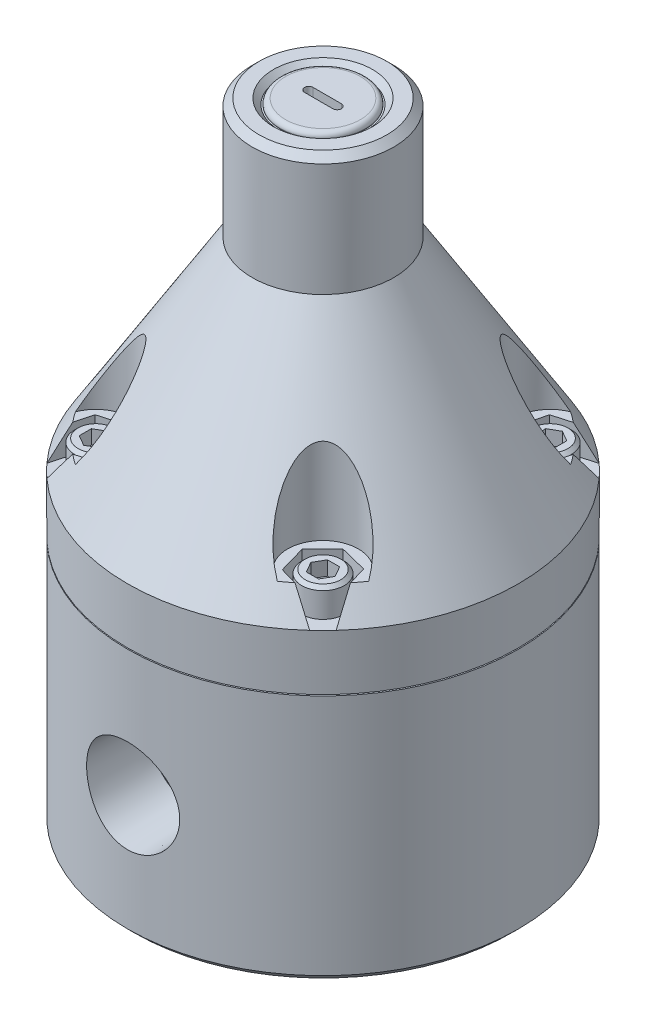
ISO-10303-21;
HEADER;
FILE_DESCRIPTION(('STEP AP214'),'2;1');
FILE_NAME('part.step','',(''),(''),'','','');
FILE_SCHEMA(('AUTOMOTIVE_DESIGN { 1 0 10303 214 1 1 1 1 }'));
ENDSEC;
DATA;
#1=APPLICATION_CONTEXT('core data for automotive mechanical design processes');
#2=APPLICATION_PROTOCOL_DEFINITION('international standard','automotive_design',2000,#1);
#3=PRODUCT_CONTEXT('',#1,'mechanical');
#4=PRODUCT('Part','Part','',(#3));
#5=PRODUCT_RELATED_PRODUCT_CATEGORY('part','',(#4));
#6=PRODUCT_DEFINITION_FORMATION('','',#4);
#7=PRODUCT_DEFINITION_CONTEXT('part definition',#1,'design');
#8=PRODUCT_DEFINITION('design','',#6,#7);
#9=PRODUCT_DEFINITION_SHAPE('','',#8);
#10=(LENGTH_UNIT() NAMED_UNIT(*) SI_UNIT(.MILLI.,.METRE.));
#11=(NAMED_UNIT(*) PLANE_ANGLE_UNIT() SI_UNIT($,.RADIAN.));
#12=(NAMED_UNIT(*) SI_UNIT($,.STERADIAN.) SOLID_ANGLE_UNIT());
#13=UNCERTAINTY_MEASURE_WITH_UNIT(LENGTH_MEASURE(1.E-05),#10,'distance_accuracy_value','');
#14=(GEOMETRIC_REPRESENTATION_CONTEXT(3) GLOBAL_UNCERTAINTY_ASSIGNED_CONTEXT((#13)) GLOBAL_UNIT_ASSIGNED_CONTEXT((#10,
#11,#12)) REPRESENTATION_CONTEXT('',''));
#15=CARTESIAN_POINT('',(0.,0.,0.));
#16=DIRECTION('',(0.,0.,1.));
#17=DIRECTION('',(1.,0.,0.));
#18=AXIS2_PLACEMENT_3D('',#15,#16,#17);
#19=CARTESIAN_POINT('',(0.,68.58,0.));
#20=DIRECTION('',(0.,-1.,0.));
#21=DIRECTION('',(0.,0.,-1.));
#22=AXIS2_PLACEMENT_3D('',#19,#20,#21);
#23=CONICAL_SURFACE('',#22,43.815,0.551031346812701);
#24=CARTESIAN_POINT('',(31.1854504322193,74.9302,-24.909570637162));
#25=CARTESIAN_POINT('',(31.2917993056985,74.4052604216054,-25.2932994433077));
#26=CARTESIAN_POINT('',(31.3977224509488,73.8791142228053,-25.6754921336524));
#27=CARTESIAN_POINT('',(31.6087824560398,72.8246364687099,-26.4370404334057));
#28=CARTESIAN_POINT('',(31.713919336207,72.2963049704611,-26.8163961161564));
#29=CARTESIAN_POINT('',(31.9234771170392,71.2376591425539,-27.5725240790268));
#30=CARTESIAN_POINT('',(32.0278980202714,70.7073448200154,-27.9492963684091));
#31=CARTESIAN_POINT('',(32.2360838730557,69.6448927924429,-28.7004741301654));
#32=CARTESIAN_POINT('',(32.3398488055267,69.1127550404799,-29.0748795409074));
#33=CARTESIAN_POINT('',(32.443312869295,68.5798,-29.4481993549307));
#34=B_SPLINE_CURVE_WITH_KNOTS('',3,(#24,#25,#26,#27,#28,#29,#30,#31,#32,#33),.UNSPECIFIED.,.F.,
.F.,(4,2,2,2,4),(0.,1.97662629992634,3.95320132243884,5.9297692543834,7.90638844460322),.UNSPECIFIED.);
#35=CARTESIAN_POINT('',(31.1854909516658,74.93,-24.9097168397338));
#36=VERTEX_POINT('',#35);
#37=CARTESIAN_POINT('',(32.4432740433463,68.58,-29.4480592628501));
#38=VERTEX_POINT('',#37);
#39=EDGE_CURVE('E746',#36,#38,#34,.T.);
#40=ORIENTED_EDGE('',*,*,#39,.F.);
#41=CARTESIAN_POINT('',(0.,74.93,0.));
#42=DIRECTION('',(0.,1.,0.));
#43=DIRECTION('',(0.,0.,1.));
#44=AXIS2_PLACEMENT_3D('',#41,#42,#43);
#45=CIRCLE('',#44,39.9127653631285);
#46=CARTESIAN_POINT('',(32.8759602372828,74.93,-22.6318376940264));
#47=VERTEX_POINT('',#46);
#48=EDGE_CURVE('E1544',#36,#47,#45,.F.);
#49=ORIENTED_EDGE('',*,*,#48,.T.);
#50=CARTESIAN_POINT('',(32.8760134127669,74.9298,-22.6319772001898));
#51=CARTESIAN_POINT('',(32.8078201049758,75.1861952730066,-22.4531520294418));
#52=CARTESIAN_POINT('',(32.7341907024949,75.4445704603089,-22.2793275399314));
#53=CARTESIAN_POINT('',(32.5770087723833,75.9645959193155,-21.9414911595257));
#54=CARTESIAN_POINT('',(32.4934589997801,76.2262452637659,-21.7774765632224));
#55=CARTESIAN_POINT('',(32.3174500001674,76.7519681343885,-21.4591594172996));
#56=CARTESIAN_POINT('',(32.2250013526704,77.0160384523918,-21.3048456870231));
#57=CARTESIAN_POINT('',(32.0318436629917,77.5464258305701,-21.0055220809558));
#58=CARTESIAN_POINT('',(31.9311339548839,77.8127430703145,-20.8605129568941));
#59=CARTESIAN_POINT('',(31.6173532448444,78.6150033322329,-20.4388792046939));
#60=CARTESIAN_POINT('',(31.3928032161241,79.1537454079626,-20.1759549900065));
#61=CARTESIAN_POINT('',(30.9170512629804,80.2357477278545,-19.6857657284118));
#62=CARTESIAN_POINT('',(30.6658395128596,80.7790095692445,-19.458513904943));
#63=CARTESIAN_POINT('',(30.118158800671,81.9115352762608,-19.022517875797));
#64=CARTESIAN_POINT('',(29.8196739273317,82.5009764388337,-18.8167433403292));
#65=CARTESIAN_POINT('',(29.3524342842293,83.3846139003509,-18.5396319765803));
#66=CARTESIAN_POINT('',(29.1934054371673,83.6791250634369,-18.452507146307));
#67=CARTESIAN_POINT('',(28.8689346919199,84.2675878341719,-18.2889878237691));
#68=CARTESIAN_POINT('',(28.7034932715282,84.5615394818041,-18.2125925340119));
#69=CARTESIAN_POINT('',(28.3660149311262,85.1488284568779,-18.0707333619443));
#70=CARTESIAN_POINT('',(28.1939696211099,85.442164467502,-18.0052839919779));
#71=CARTESIAN_POINT('',(27.8434345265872,86.0273145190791,-17.885863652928));
#72=CARTESIAN_POINT('',(27.6649449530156,86.3191286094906,-17.8318923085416));
#73=CARTESIAN_POINT('',(27.3014619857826,86.9004622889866,-17.7360312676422));
#74=CARTESIAN_POINT('',(27.1164723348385,87.1899830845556,-17.6941347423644));
#75=CARTESIAN_POINT('',(26.7396312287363,87.7661102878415,-17.6231649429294));
#76=CARTESIAN_POINT('',(26.5477800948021,88.0527168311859,-17.5940910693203));
#77=CARTESIAN_POINT('',(26.1388486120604,88.6481794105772,-17.5477736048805));
#78=CARTESIAN_POINT('',(25.9210687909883,88.9566632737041,-17.531860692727));
#79=CARTESIAN_POINT('',(25.4761618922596,89.5671217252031,-17.5184250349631));
#80=CARTESIAN_POINT('',(25.2490377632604,89.8690983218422,-17.5208965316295));
#81=CARTESIAN_POINT('',(24.7853264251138,90.462861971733,-17.546770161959));
#82=CARTESIAN_POINT('',(24.5487844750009,90.7546875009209,-17.5700815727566));
#83=CARTESIAN_POINT('',(24.1854004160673,91.182662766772,-17.6234209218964));
#84=CARTESIAN_POINT('',(24.0628808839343,91.3236542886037,-17.6442539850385));
#85=CARTESIAN_POINT('',(23.8147710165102,91.6017141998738,-17.6926688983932));
#86=CARTESIAN_POINT('',(23.6891808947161,91.7387828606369,-17.7202502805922));
#87=CARTESIAN_POINT('',(23.3476505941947,92.1003741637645,-17.8043004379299));
#88=CARTESIAN_POINT('',(23.1286985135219,92.320550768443,-17.8676208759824));
#89=CARTESIAN_POINT('',(22.6802930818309,92.7420139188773,-18.0200246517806));
#90=CARTESIAN_POINT('',(22.450819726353,92.9432620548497,-18.1091589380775));
#91=CARTESIAN_POINT('',(22.0978320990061,93.2244666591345,-18.2671443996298));
#92=CARTESIAN_POINT('',(21.9777912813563,93.315346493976,-18.3243659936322));
#93=CARTESIAN_POINT('',(21.7355133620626,93.4877899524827,-18.4477596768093));
#94=CARTESIAN_POINT('',(21.6132758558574,93.5693518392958,-18.5139334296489));
#95=CARTESIAN_POINT('',(21.3676920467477,93.7206957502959,-18.6557254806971));
#96=CARTESIAN_POINT('',(21.2443516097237,93.7905207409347,-18.7313074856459));
#97=CARTESIAN_POINT('',(20.997270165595,93.9162293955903,-18.8925662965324));
#98=CARTESIAN_POINT('',(20.8735295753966,93.9721245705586,-18.9782346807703));
#99=CARTESIAN_POINT('',(20.596353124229,94.0793061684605,-19.1825009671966));
#100=CARTESIAN_POINT('',(20.4431915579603,94.1259831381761,-19.303987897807));
#101=CARTESIAN_POINT('',(20.1429486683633,94.1891665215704,-19.561379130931));
#102=CARTESIAN_POINT('',(19.995862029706,94.2056998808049,-19.6972704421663));
#103=CARTESIAN_POINT('',(19.7121854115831,94.2068511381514,-19.9801670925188));
#104=CARTESIAN_POINT('',(19.5756118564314,94.1914201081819,-20.1271891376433));
#105=CARTESIAN_POINT('',(19.3168358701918,94.130256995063,-20.4274436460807));
#106=CARTESIAN_POINT('',(19.1946462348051,94.0844981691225,-20.5806814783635));
#107=CARTESIAN_POINT('',(18.9333227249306,93.9499537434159,-20.9335168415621));
#108=CARTESIAN_POINT('',(18.7994959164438,93.8525556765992,-21.1337148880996));
#109=CARTESIAN_POINT('',(18.5575341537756,93.6253225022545,-21.5311982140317));
#110=CARTESIAN_POINT('',(18.4494578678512,93.4954146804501,-21.7284758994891));
#111=CARTESIAN_POINT('',(18.2734255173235,93.2378861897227,-22.0822323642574));
#112=CARTESIAN_POINT('',(18.2017503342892,93.114033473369,-22.2396830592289));
#113=CARTESIAN_POINT('',(18.0717731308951,92.8543658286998,-22.5502860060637));
#114=CARTESIAN_POINT('',(18.0134803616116,92.7185427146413,-22.7034352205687));
#115=CARTESIAN_POINT('',(17.9085459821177,92.4375711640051,-23.0055063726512));
#116=CARTESIAN_POINT('',(17.8619238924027,92.2924076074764,-23.1544208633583));
#117=CARTESIAN_POINT('',(17.7789950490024,91.9949331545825,-23.4479825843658));
#118=CARTESIAN_POINT('',(17.7426923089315,91.842619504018,-23.5926281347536));
#119=CARTESIAN_POINT('',(17.6793668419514,91.5330276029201,-23.877261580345));
#120=CARTESIAN_POINT('',(17.6523073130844,91.3757718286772,-24.0172658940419));
#121=CARTESIAN_POINT('',(17.6063247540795,91.0568516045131,-24.2934532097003));
#122=CARTESIAN_POINT('',(17.5874006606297,90.8951877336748,-24.4296367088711));
#123=CARTESIAN_POINT('',(17.5416007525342,90.4045581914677,-24.8331155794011));
#124=CARTESIAN_POINT('',(17.5257415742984,90.0701857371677,-25.0951300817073));
#125=CARTESIAN_POINT('',(17.5187750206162,89.3910127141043,-25.6073018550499));
#126=CARTESIAN_POINT('',(17.5277362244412,89.0461858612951,-25.8574243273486));
#127=CARTESIAN_POINT('',(17.5674604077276,88.3499543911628,-26.346266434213));
#128=CARTESIAN_POINT('',(17.5982177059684,87.9985515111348,-26.5849890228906));
#129=CARTESIAN_POINT('',(17.6752315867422,87.3273950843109,-27.0279886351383));
#130=CARTESIAN_POINT('',(17.7195760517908,87.0080899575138,-27.2332880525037));
#131=CARTESIAN_POINT('',(17.8230232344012,86.366765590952,-27.6358491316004));
#132=CARTESIAN_POINT('',(17.8821279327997,86.0447459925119,-27.8331097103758));
#133=CARTESIAN_POINT('',(18.0143479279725,85.3986613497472,-28.2199078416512));
#134=CARTESIAN_POINT('',(18.0874725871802,85.0745950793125,-28.4094401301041));
#135=CARTESIAN_POINT('',(18.247146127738,84.4253288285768,-28.7807004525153));
#136=CARTESIAN_POINT('',(18.3336943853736,84.100128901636,-28.9624288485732));
#137=CARTESIAN_POINT('',(18.5196821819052,83.4497138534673,-29.3177238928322));
#138=CARTESIAN_POINT('',(18.6190998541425,83.1244996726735,-29.4913037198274));
#139=CARTESIAN_POINT('',(18.8307065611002,82.4740292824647,-29.830436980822));
#140=CARTESIAN_POINT('',(18.9428959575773,82.1487730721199,-29.9959901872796));
#141=CARTESIAN_POINT('',(19.1798765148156,81.4988617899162,-30.3186806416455));
#142=CARTESIAN_POINT('',(19.3046623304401,81.1742065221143,-30.4758214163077));
#143=CARTESIAN_POINT('',(19.566846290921,80.5258852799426,-30.7813029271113));
#144=CARTESIAN_POINT('',(19.7042435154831,80.2022192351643,-30.929644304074));
#145=CARTESIAN_POINT('',(20.0356080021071,79.4577845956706,-31.2608218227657));
#146=CARTESIAN_POINT('',(20.2340425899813,79.0375277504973,-31.4403688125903));
#147=CARTESIAN_POINT('',(20.6528330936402,78.2009180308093,-31.7817933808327));
#148=CARTESIAN_POINT('',(20.8731810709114,77.7845638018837,-31.943677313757));
#149=CARTESIAN_POINT('',(21.2204706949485,77.1642648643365,-32.1715277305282));
#150=CARTESIAN_POINT('',(21.3389735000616,76.9582923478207,-32.244953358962));
#151=CARTESIAN_POINT('',(21.5816967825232,76.5479021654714,-32.3865049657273));
#152=CARTESIAN_POINT('',(21.7059169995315,76.3434844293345,-32.454631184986));
#153=CARTESIAN_POINT('',(21.9602864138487,75.936277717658,-32.5852592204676));
#154=CARTESIAN_POINT('',(22.0904406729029,75.7334903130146,-32.647756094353));
#155=CARTESIAN_POINT('',(22.3567119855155,75.3299985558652,-32.7666088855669));
#156=CARTESIAN_POINT('',(22.4928299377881,75.1292945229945,-32.8229638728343));
#157=CARTESIAN_POINT('',(22.6319772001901,74.9298,-32.8760134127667));
#158=B_SPLINE_CURVE_WITH_KNOTS('',3,(#50,#51,#52,#53,#54,#55,#56,#57,#58,#59,#60,#61,#62,#63,
#64,#65,#66,#67,#68,#69,#70,#71,#72,#73,#74,#75,#76,#77,#78,#79,#80,#81,#82,#83,#84,#85,#86,#87,
#88,#89,#90,#91,#92,#93,#94,#95,#96,#97,#98,#99,#100,#101,#102,#103,#104,#105,#106,#107,#108,
#109,#110,#111,#112,#113,#114,#115,#116,#117,#118,#119,#120,#121,#122,#123,#124,#125,#126,#127,
#128,#129,#130,#131,#132,#133,#134,#135,#136,#137,#138,#139,#140,#141,#142,#143,#144,#145,#146,
#147,#148,#149,#150,#151,#152,#153,#154,#155,#156,#157),.UNSPECIFIED.,.F.,.F.,(4,2,2,2,2,2,2,2,
2,2,2,2,2,2,2,2,2,2,2,2,2,2,2,2,2,2,2,2,2,2,2,2,2,2,2,2,2,2,2,2,2,2,2,2,2,2,2,2,2,2,2,2,2,4),
(0.,0.959681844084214,1.9190977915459,2.87738689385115,3.83575332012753,5.75433905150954,
7.67363431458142,9.74768208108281,10.7850777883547,11.8223963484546,12.8610794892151,
13.8997286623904,14.9377892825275,15.9758013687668,17.1090815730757,18.2420068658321,
19.3700240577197,19.9337037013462,20.4973442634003,21.4467185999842,22.3979796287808,
22.8807596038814,23.363629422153,23.8446911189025,24.3253539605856,24.9256472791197,
25.5254037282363,26.1260789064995,26.7272844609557,27.5022221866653,28.2789089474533,
28.9163059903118,29.5541423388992,30.193038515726,30.8321828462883,31.4687519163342,
32.1052377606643,33.3791509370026,34.6565874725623,35.9336911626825,37.0798743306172,
38.2262114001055,39.3733166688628,40.520368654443,41.665496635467,42.8106570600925,
43.9553335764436,45.0999266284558,46.5938371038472,48.0872083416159,48.8332472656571,
49.5792522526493,50.325905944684,51.0726725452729),.UNSPECIFIED.);
#159=CARTESIAN_POINT('',(22.6318376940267,74.93,-32.8759602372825));
#160=VERTEX_POINT('',#159);
#161=EDGE_CURVE('E897',#47,#160,#158,.T.);
#162=ORIENTED_EDGE('',*,*,#161,.T.);
#163=CARTESIAN_POINT('',(24.9752922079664,74.93,-31.1329988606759));
#164=VERTEX_POINT('',#163);
#165=EDGE_CURVE('E906',#160,#164,#45,.F.);
#166=ORIENTED_EDGE('',*,*,#165,.T.);
#167=CARTESIAN_POINT('',(29.4766640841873,68.5798,-32.4174531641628));
#168=CARTESIAN_POINT('',(29.1062316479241,69.1125841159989,-32.3117512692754));
#169=CARTESIAN_POINT('',(28.7347583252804,69.6445870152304,-32.2057523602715));
#170=CARTESIAN_POINT('',(27.9895431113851,70.7068520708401,-31.9931072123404));
#171=CARTESIAN_POINT('',(27.6158012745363,71.2371142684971,-31.8864609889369));
#172=CARTESIAN_POINT('',(26.8658433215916,72.2957468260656,-31.6724625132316));
#173=CARTESIAN_POINT('',(26.4896271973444,72.8241171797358,-31.5651102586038));
#174=CARTESIAN_POINT('',(25.7344797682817,73.8787747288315,-31.3496309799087));
#175=CARTESIAN_POINT('',(25.3555483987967,74.4050618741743,-31.2415039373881));
#176=CARTESIAN_POINT('',(24.9751473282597,74.9302,-31.132957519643));
#177=B_SPLINE_CURVE_WITH_KNOTS('',3,(#167,#168,#169,#170,#171,#172,#173,#174,#175,#176),
.UNSPECIFIED.,.F.,.F.,(4,2,2,2,4),(0.,1.97237650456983,3.9447058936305,5.91704178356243,
7.88942480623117),.UNSPECIFIED.);
#178=CARTESIAN_POINT('',(29.4765250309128,68.58,-32.4174134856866));
#179=VERTEX_POINT('',#178);
#180=EDGE_CURVE('E729',#179,#164,#177,.T.);
#181=ORIENTED_EDGE('',*,*,#180,.F.);
#182=CARTESIAN_POINT('',(0.,68.58,0.));
#183=DIRECTION('',(0.,-1.,0.));
#184=DIRECTION('',(0.,0.,-1.));
#185=AXIS2_PLACEMENT_3D('',#182,#183,#184);
#186=CIRCLE('',#185,43.815);
#187=CARTESIAN_POINT('',(-29.4480592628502,68.58,-32.4432740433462));
#188=VERTEX_POINT('',#187);
#189=EDGE_CURVE('E1309',#188,#179,#186,.T.);
#190=ORIENTED_EDGE('',*,*,#189,.F.);
#191=CARTESIAN_POINT('',(-24.9095706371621,74.9302,-31.1854504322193));
#192=CARTESIAN_POINT('',(-25.2932994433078,74.4052604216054,-31.2917993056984));
#193=CARTESIAN_POINT('',(-25.6754921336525,73.8791142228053,-31.3977224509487));
#194=CARTESIAN_POINT('',(-26.4370404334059,72.8246364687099,-31.6087824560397));
#195=CARTESIAN_POINT('',(-26.8163961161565,72.2963049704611,-31.7139193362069));
#196=CARTESIAN_POINT('',(-27.5725240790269,71.2376591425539,-31.9234771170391));
#197=CARTESIAN_POINT('',(-27.9492963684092,70.7073448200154,-32.0278980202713));
#198=CARTESIAN_POINT('',(-28.7004741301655,69.6448927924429,-32.2360838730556));
#199=CARTESIAN_POINT('',(-29.0748795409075,69.1127550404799,-32.3398488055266));
#200=CARTESIAN_POINT('',(-29.4481993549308,68.5798,-32.4433128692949));
#201=B_SPLINE_CURVE_WITH_KNOTS('',3,(#191,#192,#193,#194,#195,#196,#197,#198,#199,#200),
.UNSPECIFIED.,.F.,.F.,(4,2,2,2,4),(0.,1.97662629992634,3.95320132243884,5.9297692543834,
7.90638844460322),.UNSPECIFIED.);
#202=CARTESIAN_POINT('',(-24.9097168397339,74.93,-31.1854909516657));
#203=VERTEX_POINT('',#202);
#204=EDGE_CURVE('E803',#203,#188,#201,.T.);
#205=ORIENTED_EDGE('',*,*,#204,.F.);
#206=CARTESIAN_POINT('',(0.,74.93,0.));
#207=DIRECTION('',(0.,1.,0.));
#208=DIRECTION('',(0.,0.,1.));
#209=AXIS2_PLACEMENT_3D('',#206,#207,#208);
#210=CIRCLE('',#209,39.9127653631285);
#211=CARTESIAN_POINT('',(-22.6318376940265,74.93,-32.8759602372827));
#212=VERTEX_POINT('',#211);
#213=EDGE_CURVE('E1548',#203,#212,#210,.F.);
#214=ORIENTED_EDGE('',*,*,#213,.T.);
#215=CARTESIAN_POINT('',(-22.6319772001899,74.9298,-32.8760134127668));
#216=CARTESIAN_POINT('',(-22.4531520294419,75.1861952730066,-32.8078201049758));
#217=CARTESIAN_POINT('',(-22.2793275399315,75.4445704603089,-32.7341907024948));
#218=CARTESIAN_POINT('',(-21.9414911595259,75.9645959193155,-32.5770087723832));
#219=CARTESIAN_POINT('',(-21.7774765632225,76.2262452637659,-32.49345899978));
#220=CARTESIAN_POINT('',(-21.4591594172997,76.7519681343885,-32.3174500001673));
#221=CARTESIAN_POINT('',(-21.3048456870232,77.0160384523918,-32.2250013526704));
#222=CARTESIAN_POINT('',(-21.0055220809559,77.5464258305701,-32.0318436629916));
#223=CARTESIAN_POINT('',(-20.8605129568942,77.8127430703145,-31.9311339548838));
#224=CARTESIAN_POINT('',(-20.438879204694,78.6150033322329,-31.6173532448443));
#225=CARTESIAN_POINT('',(-20.1759549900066,79.1537454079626,-31.392803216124));
#226=CARTESIAN_POINT('',(-19.6857657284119,80.2357477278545,-30.9170512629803));
#227=CARTESIAN_POINT('',(-19.4585139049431,80.7790095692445,-30.6658395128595));
#228=CARTESIAN_POINT('',(-19.0225178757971,81.9115352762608,-30.1181588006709));
#229=CARTESIAN_POINT('',(-18.8167433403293,82.5009764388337,-29.8196739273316));
#230=CARTESIAN_POINT('',(-18.5396319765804,83.3846139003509,-29.3524342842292));
#231=CARTESIAN_POINT('',(-18.4525071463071,83.6791250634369,-29.1934054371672));
#232=CARTESIAN_POINT('',(-18.2889878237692,84.2675878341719,-28.8689346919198));
#233=CARTESIAN_POINT('',(-18.212592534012,84.5615394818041,-28.7034932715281));
#234=CARTESIAN_POINT('',(-18.0707333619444,85.148828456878,-28.3660149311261));
#235=CARTESIAN_POINT('',(-18.005283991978,85.4421644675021,-28.1939696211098));
#236=CARTESIAN_POINT('',(-17.8858636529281,86.0273145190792,-27.8434345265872));
#237=CARTESIAN_POINT('',(-17.8318923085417,86.3191286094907,-27.6649449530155));
#238=CARTESIAN_POINT('',(-17.7360312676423,86.9004622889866,-27.3014619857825));
#239=CARTESIAN_POINT('',(-17.6941347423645,87.1899830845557,-27.1164723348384));
#240=CARTESIAN_POINT('',(-17.6231649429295,87.7661102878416,-26.7396312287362));
#241=CARTESIAN_POINT('',(-17.5940910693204,88.052716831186,-26.547780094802));
#242=CARTESIAN_POINT('',(-17.5477736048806,88.6481794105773,-26.1388486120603));
#243=CARTESIAN_POINT('',(-17.5318606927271,88.9566632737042,-25.9210687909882));
#244=CARTESIAN_POINT('',(-17.5184250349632,89.5671217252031,-25.4761618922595));
#245=CARTESIAN_POINT('',(-17.5208965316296,89.8690983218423,-25.2490377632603));
#246=CARTESIAN_POINT('',(-17.5467701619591,90.462861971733,-24.7853264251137));
#247=CARTESIAN_POINT('',(-17.5700815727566,90.754687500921,-24.5487844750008));
#248=CARTESIAN_POINT('',(-17.6234209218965,91.1826627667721,-24.1854004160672));
#249=CARTESIAN_POINT('',(-17.6442539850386,91.3236542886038,-24.0628808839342));
#250=CARTESIAN_POINT('',(-17.6926688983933,91.6017141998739,-23.8147710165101));
#251=CARTESIAN_POINT('',(-17.7202502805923,91.7387828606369,-23.6891808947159));
#252=CARTESIAN_POINT('',(-17.80430043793,92.1003741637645,-23.3476505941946));
#253=CARTESIAN_POINT('',(-17.8676208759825,92.320550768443,-23.1286985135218));
#254=CARTESIAN_POINT('',(-18.0200246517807,92.7420139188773,-22.6802930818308));
#255=CARTESIAN_POINT('',(-18.1091589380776,92.9432620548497,-22.4508197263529));
#256=CARTESIAN_POINT('',(-18.2671443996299,93.2244666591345,-22.097832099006));
#257=CARTESIAN_POINT('',(-18.3243659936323,93.3153464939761,-21.9777912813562));
#258=CARTESIAN_POINT('',(-18.4477596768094,93.4877899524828,-21.7355133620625));
#259=CARTESIAN_POINT('',(-18.513933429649,93.5693518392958,-21.6132758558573));
#260=CARTESIAN_POINT('',(-18.6557254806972,93.7206957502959,-21.3676920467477));
#261=CARTESIAN_POINT('',(-18.731307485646,93.7905207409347,-21.2443516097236));
#262=CARTESIAN_POINT('',(-18.8925662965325,93.9162293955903,-20.9972701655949));
#263=CARTESIAN_POINT('',(-18.9782346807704,93.9721245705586,-20.8735295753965));
#264=CARTESIAN_POINT('',(-19.1825009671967,94.0793061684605,-20.5963531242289));
#265=CARTESIAN_POINT('',(-19.3039878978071,94.1259831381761,-20.4431915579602));
#266=CARTESIAN_POINT('',(-19.5613791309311,94.1891665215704,-20.1429486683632));
#267=CARTESIAN_POINT('',(-19.6972704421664,94.2056998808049,-19.9958620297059));
#268=CARTESIAN_POINT('',(-19.9801670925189,94.2068511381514,-19.7121854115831));
#269=CARTESIAN_POINT('',(-20.1271891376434,94.1914201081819,-19.5756118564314));
#270=CARTESIAN_POINT('',(-20.4274436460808,94.130256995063,-19.3168358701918));
#271=CARTESIAN_POINT('',(-20.5806814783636,94.0844981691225,-19.194646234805));
#272=CARTESIAN_POINT('',(-20.9335168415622,93.9499537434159,-18.9333227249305));
#273=CARTESIAN_POINT('',(-21.1337148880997,93.8525556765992,-18.7994959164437));
#274=CARTESIAN_POINT('',(-21.5311982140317,93.6253225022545,-18.5575341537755));
#275=CARTESIAN_POINT('',(-21.7284758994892,93.4954146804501,-18.4494578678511));
#276=CARTESIAN_POINT('',(-22.0822323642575,93.2378861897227,-18.2734255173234));
#277=CARTESIAN_POINT('',(-22.239683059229,93.114033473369,-18.2017503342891));
#278=CARTESIAN_POINT('',(-22.5502860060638,92.8543658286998,-18.071773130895));
#279=CARTESIAN_POINT('',(-22.7034352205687,92.7185427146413,-18.0134803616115));
#280=CARTESIAN_POINT('',(-23.0055063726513,92.437571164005,-17.9085459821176));
#281=CARTESIAN_POINT('',(-23.1544208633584,92.2924076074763,-17.8619238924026));
#282=CARTESIAN_POINT('',(-23.4479825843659,91.9949331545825,-17.7789950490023));
#283=CARTESIAN_POINT('',(-23.5926281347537,91.842619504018,-17.7426923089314));
#284=CARTESIAN_POINT('',(-23.8772615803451,91.5330276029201,-17.6793668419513));
#285=CARTESIAN_POINT('',(-24.017265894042,91.3757718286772,-17.6523073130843));
#286=CARTESIAN_POINT('',(-24.2934532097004,91.0568516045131,-17.6063247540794));
#287=CARTESIAN_POINT('',(-24.4296367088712,90.8951877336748,-17.5874006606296));
#288=CARTESIAN_POINT('',(-24.8331155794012,90.4045581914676,-17.5416007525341));
#289=CARTESIAN_POINT('',(-25.0951300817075,90.0701857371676,-17.5257415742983));
#290=CARTESIAN_POINT('',(-25.60730185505,89.3910127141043,-17.5187750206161));
#291=CARTESIAN_POINT('',(-25.8574243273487,89.046185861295,-17.5277362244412));
#292=CARTESIAN_POINT('',(-26.3462664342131,88.3499543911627,-17.5674604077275));
#293=CARTESIAN_POINT('',(-26.5849890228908,87.9985515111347,-17.5982177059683));
#294=CARTESIAN_POINT('',(-27.0279886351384,87.3273950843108,-17.6752315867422));
#295=CARTESIAN_POINT('',(-27.2332880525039,87.0080899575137,-17.7195760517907));
#296=CARTESIAN_POINT('',(-27.6358491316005,86.366765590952,-17.8230232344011));
#297=CARTESIAN_POINT('',(-27.8331097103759,86.0447459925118,-17.8821279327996));
#298=CARTESIAN_POINT('',(-28.2199078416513,85.3986613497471,-18.0143479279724));
#299=CARTESIAN_POINT('',(-28.4094401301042,85.0745950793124,-18.0874725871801));
#300=CARTESIAN_POINT('',(-28.7807004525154,84.4253288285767,-18.2471461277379));
#301=CARTESIAN_POINT('',(-28.9624288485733,84.1001289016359,-18.3336943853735));
#302=CARTESIAN_POINT('',(-29.3177238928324,83.4497138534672,-18.5196821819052));
#303=CARTESIAN_POINT('',(-29.4913037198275,83.1244996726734,-18.6190998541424));
#304=CARTESIAN_POINT('',(-29.8304369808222,82.4740292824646,-18.8307065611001));
#305=CARTESIAN_POINT('',(-29.9959901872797,82.1487730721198,-18.9428959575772));
#306=CARTESIAN_POINT('',(-30.3186806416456,81.498861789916,-19.1798765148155));
#307=CARTESIAN_POINT('',(-30.4758214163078,81.1742065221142,-19.3046623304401));
#308=CARTESIAN_POINT('',(-30.7813029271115,80.5258852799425,-19.5668462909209));
#309=CARTESIAN_POINT('',(-30.9296443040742,80.2022192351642,-19.7042435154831));
#310=CARTESIAN_POINT('',(-31.2608218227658,79.4577845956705,-20.0356080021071));
#311=CARTESIAN_POINT('',(-31.4403688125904,79.0375277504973,-20.2340425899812));
#312=CARTESIAN_POINT('',(-31.7817933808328,78.2009180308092,-20.6528330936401));
#313=CARTESIAN_POINT('',(-31.9436773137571,77.7845638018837,-20.8731810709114));
#314=CARTESIAN_POINT('',(-32.1715277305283,77.1642648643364,-21.2204706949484));
#315=CARTESIAN_POINT('',(-32.2449533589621,76.9582923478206,-21.3389735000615));
#316=CARTESIAN_POINT('',(-32.3865049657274,76.5479021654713,-21.5816967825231));
#317=CARTESIAN_POINT('',(-32.4546311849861,76.3434844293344,-21.7059169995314));
#318=CARTESIAN_POINT('',(-32.5852592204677,75.9362777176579,-21.9602864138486));
#319=CARTESIAN_POINT('',(-32.6477560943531,75.7334903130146,-22.0904406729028));
#320=CARTESIAN_POINT('',(-32.766608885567,75.3299985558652,-22.3567119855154));
#321=CARTESIAN_POINT('',(-32.8229638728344,75.1292945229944,-22.492829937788));
#322=CARTESIAN_POINT('',(-32.8760134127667,74.9298,-22.63197720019));
#323=B_SPLINE_CURVE_WITH_KNOTS('',3,(#215,#216,#217,#218,#219,#220,#221,#222,#223,#224,#225,
#226,#227,#228,#229,#230,#231,#232,#233,#234,#235,#236,#237,#238,#239,#240,#241,#242,#243,#244,
#245,#246,#247,#248,#249,#250,#251,#252,#253,#254,#255,#256,#257,#258,#259,#260,#261,#262,#263,
#264,#265,#266,#267,#268,#269,#270,#271,#272,#273,#274,#275,#276,#277,#278,#279,#280,#281,#282,
#283,#284,#285,#286,#287,#288,#289,#290,#291,#292,#293,#294,#295,#296,#297,#298,#299,#300,#301,
#302,#303,#304,#305,#306,#307,#308,#309,#310,#311,#312,#313,#314,#315,#316,#317,#318,#319,#320,
#321,#322),.UNSPECIFIED.,.F.,.F.,(4,2,2,2,2,2,2,2,2,2,2,2,2,2,2,2,2,2,2,2,2,2,2,2,2,2,2,2,2,2,2,
2,2,2,2,2,2,2,2,2,2,2,2,2,2,2,2,2,2,2,2,2,2,4),(0.,0.959681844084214,1.9190977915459,
2.87738689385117,3.83575332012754,5.75433905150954,7.67363431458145,9.74768208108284,
10.7850777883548,11.8223963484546,12.8610794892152,13.8997286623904,14.9377892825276,
15.9758013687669,17.1090815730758,18.2420068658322,19.3700240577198,19.9337037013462,
20.4973442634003,21.4467185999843,22.3979796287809,22.8807596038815,23.3636294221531,
23.8446911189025,24.3253539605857,24.9256472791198,25.5254037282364,26.1260789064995,
26.7272844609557,27.5022221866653,28.2789089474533,28.9163059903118,29.5541423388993,
30.193038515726,30.8321828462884,31.4687519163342,32.1052377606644,33.3791509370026,
34.6565874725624,35.9336911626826,37.0798743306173,38.2262114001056,39.373316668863,
40.5203686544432,41.6654966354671,42.8106570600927,43.9553335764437,45.0999266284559,
46.5938371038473,48.0872083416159,48.8332472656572,49.5792522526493,50.3259059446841,
51.0726725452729),.UNSPECIFIED.);
#324=CARTESIAN_POINT('',(-32.8759602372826,74.93,-22.6318376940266));
#325=VERTEX_POINT('',#324);
#326=EDGE_CURVE('E1543',#212,#325,#323,.T.);
#327=ORIENTED_EDGE('',*,*,#326,.T.);
#328=CARTESIAN_POINT('',(-31.132998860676,74.93,-24.9752922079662));
#329=VERTEX_POINT('',#328);
#330=EDGE_CURVE('E1359',#325,#329,#210,.F.);
#331=ORIENTED_EDGE('',*,*,#330,.T.);
#332=CARTESIAN_POINT('',(-32.4174531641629,68.5798,-29.4766640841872));
#333=CARTESIAN_POINT('',(-32.3117512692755,69.1125841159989,-29.106231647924));
#334=CARTESIAN_POINT('',(-32.2057523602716,69.6445870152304,-28.7347583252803));
#335=CARTESIAN_POINT('',(-31.9931072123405,70.7068520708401,-27.989543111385));
#336=CARTESIAN_POINT('',(-31.886460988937,71.2371142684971,-27.6158012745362));
#337=CARTESIAN_POINT('',(-31.6724625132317,72.2957468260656,-26.8658433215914));
#338=CARTESIAN_POINT('',(-31.5651102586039,72.8241171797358,-26.4896271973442));
#339=CARTESIAN_POINT('',(-31.3496309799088,73.8787747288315,-25.7344797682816));
#340=CARTESIAN_POINT('',(-31.2415039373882,74.4050618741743,-25.3555483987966));
#341=CARTESIAN_POINT('',(-31.1329575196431,74.9302,-24.9751473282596));
#342=B_SPLINE_CURVE_WITH_KNOTS('',3,(#332,#333,#334,#335,#336,#337,#338,#339,#340,#341),
.UNSPECIFIED.,.F.,.F.,(4,2,2,2,4),(0.,1.9723765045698,3.94470589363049,5.91704178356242,
7.88942480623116),.UNSPECIFIED.);
#343=CARTESIAN_POINT('',(-32.4174134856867,68.58,-29.4765250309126));
#344=VERTEX_POINT('',#343);
#345=EDGE_CURVE('E796',#344,#329,#342,.T.);
#346=ORIENTED_EDGE('',*,*,#345,.F.);
#347=CARTESIAN_POINT('',(-32.4432740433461,68.58,29.4480592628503));
#348=VERTEX_POINT('',#347);
#349=EDGE_CURVE('E1316',#348,#344,#186,.T.);
#350=ORIENTED_EDGE('',*,*,#349,.F.);
#351=CARTESIAN_POINT('',(-31.1854504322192,74.9302,24.9095706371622));
#352=CARTESIAN_POINT('',(-31.2917993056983,74.4052604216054,25.2932994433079));
#353=CARTESIAN_POINT('',(-31.3977224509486,73.8791142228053,25.6754921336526));
#354=CARTESIAN_POINT('',(-31.6087824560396,72.8246364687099,26.437040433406));
#355=CARTESIAN_POINT('',(-31.7139193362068,72.2963049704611,26.8163961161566));
#356=CARTESIAN_POINT('',(-31.9234771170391,71.2376591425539,27.572524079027));
#357=CARTESIAN_POINT('',(-32.0278980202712,70.7073448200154,27.9492963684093));
#358=CARTESIAN_POINT('',(-32.2360838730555,69.6448927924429,28.7004741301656));
#359=CARTESIAN_POINT('',(-32.3398488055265,69.1127550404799,29.0748795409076));
#360=CARTESIAN_POINT('',(-32.4433128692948,68.5798,29.4481993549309));
#361=B_SPLINE_CURVE_WITH_KNOTS('',3,(#351,#352,#353,#354,#355,#356,#357,#358,#359,#360),
.UNSPECIFIED.,.F.,.F.,(4,2,2,2,4),(0.,1.97662629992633,3.95320132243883,5.9297692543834,
7.90638844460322),.UNSPECIFIED.);
#362=CARTESIAN_POINT('',(-31.1854909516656,74.93,24.9097168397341));
#363=VERTEX_POINT('',#362);
#364=EDGE_CURVE('E866',#363,#348,#361,.T.);
#365=ORIENTED_EDGE('',*,*,#364,.F.);
#366=CARTESIAN_POINT('',(0.,74.93,0.));
#367=DIRECTION('',(0.,1.,0.));
#368=DIRECTION('',(0.,0.,1.));
#369=AXIS2_PLACEMENT_3D('',#366,#367,#368);
#370=CIRCLE('',#369,39.9127653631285);
#371=CARTESIAN_POINT('',(-32.8759602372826,74.93,22.6318376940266));
#372=VERTEX_POINT('',#371);
#373=EDGE_CURVE('E1569',#363,#372,#370,.F.);
#374=ORIENTED_EDGE('',*,*,#373,.T.);
#375=CARTESIAN_POINT('',(-32.8760134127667,74.9298,22.63197720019));
#376=CARTESIAN_POINT('',(-32.8078201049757,75.1861952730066,22.453152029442));
#377=CARTESIAN_POINT('',(-32.7341907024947,75.4445704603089,22.2793275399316));
#378=CARTESIAN_POINT('',(-32.5770087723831,75.9645959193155,21.941491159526));
#379=CARTESIAN_POINT('',(-32.4934589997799,76.2262452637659,21.7774765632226));
#380=CARTESIAN_POINT('',(-32.3174500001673,76.7519681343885,21.4591594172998));
#381=CARTESIAN_POINT('',(-32.2250013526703,77.0160384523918,21.3048456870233));
#382=CARTESIAN_POINT('',(-32.0318436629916,77.5464258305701,21.005522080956));
#383=CARTESIAN_POINT('',(-31.9311339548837,77.8127430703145,20.8605129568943));
#384=CARTESIAN_POINT('',(-31.6173532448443,78.6150033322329,20.4388792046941));
#385=CARTESIAN_POINT('',(-31.3928032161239,79.1537454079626,20.1759549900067));
#386=CARTESIAN_POINT('',(-30.9170512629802,80.2357477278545,19.685765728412));
#387=CARTESIAN_POINT('',(-30.6658395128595,80.7790095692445,19.4585139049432));
#388=CARTESIAN_POINT('',(-30.1181588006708,81.9115352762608,19.0225178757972));
#389=CARTESIAN_POINT('',(-29.8196739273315,82.5009764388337,18.8167433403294));
#390=CARTESIAN_POINT('',(-29.3524342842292,83.3846139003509,18.5396319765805));
#391=CARTESIAN_POINT('',(-29.1934054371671,83.6791250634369,18.4525071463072));
#392=CARTESIAN_POINT('',(-28.8689346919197,84.2675878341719,18.2889878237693));
#393=CARTESIAN_POINT('',(-28.703493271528,84.5615394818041,18.2125925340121));
#394=CARTESIAN_POINT('',(-28.3660149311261,85.1488284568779,18.0707333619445));
#395=CARTESIAN_POINT('',(-28.1939696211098,85.442164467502,18.0052839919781));
#396=CARTESIAN_POINT('',(-27.8434345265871,86.0273145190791,17.8858636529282));
#397=CARTESIAN_POINT('',(-27.6649449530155,86.3191286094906,17.8318923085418));
#398=CARTESIAN_POINT('',(-27.3014619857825,86.9004622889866,17.7360312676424));
#399=CARTESIAN_POINT('',(-27.1164723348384,87.1899830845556,17.6941347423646));
#400=CARTESIAN_POINT('',(-26.7396312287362,87.7661102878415,17.6231649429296));
#401=CARTESIAN_POINT('',(-26.5477800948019,88.0527168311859,17.5940910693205));
#402=CARTESIAN_POINT('',(-26.1388486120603,88.6481794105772,17.5477736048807));
#403=CARTESIAN_POINT('',(-25.9210687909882,88.9566632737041,17.5318606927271));
#404=CARTESIAN_POINT('',(-25.4761618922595,89.5671217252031,17.5184250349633));
#405=CARTESIAN_POINT('',(-25.2490377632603,89.8690983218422,17.5208965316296));
#406=CARTESIAN_POINT('',(-24.7853264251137,90.462861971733,17.5467701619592));
#407=CARTESIAN_POINT('',(-24.5487844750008,90.7546875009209,17.5700815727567));
#408=CARTESIAN_POINT('',(-24.1854004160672,91.1826627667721,17.6234209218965));
#409=CARTESIAN_POINT('',(-24.0628808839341,91.3236542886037,17.6442539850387));
#410=CARTESIAN_POINT('',(-23.8147710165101,91.6017141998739,17.6926688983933));
#411=CARTESIAN_POINT('',(-23.6891808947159,91.7387828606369,17.7202502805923));
#412=CARTESIAN_POINT('',(-23.3476505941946,92.1003741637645,17.80430043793));
#413=CARTESIAN_POINT('',(-23.1286985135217,92.320550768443,17.8676208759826));
#414=CARTESIAN_POINT('',(-22.6802930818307,92.7420139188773,18.0200246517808));
#415=CARTESIAN_POINT('',(-22.4508197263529,92.9432620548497,18.1091589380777));
#416=CARTESIAN_POINT('',(-22.0978320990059,93.2244666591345,18.2671443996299));
#417=CARTESIAN_POINT('',(-21.9777912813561,93.315346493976,18.3243659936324));
#418=CARTESIAN_POINT('',(-21.7355133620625,93.4877899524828,18.4477596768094));
#419=CARTESIAN_POINT('',(-21.6132758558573,93.5693518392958,18.5139334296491));
#420=CARTESIAN_POINT('',(-21.3676920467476,93.7206957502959,18.6557254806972));
#421=CARTESIAN_POINT('',(-21.2443516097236,93.7905207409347,18.7313074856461));
#422=CARTESIAN_POINT('',(-20.9972701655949,93.9162293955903,18.8925662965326));
#423=CARTESIAN_POINT('',(-20.8735295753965,93.9721245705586,18.9782346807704));
#424=CARTESIAN_POINT('',(-20.5963531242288,94.0793061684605,19.1825009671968));
#425=CARTESIAN_POINT('',(-20.4431915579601,94.1259831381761,19.3039878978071));
#426=CARTESIAN_POINT('',(-20.1429486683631,94.1891665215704,19.5613791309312));
#427=CARTESIAN_POINT('',(-19.9958620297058,94.2056998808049,19.6972704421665));
#428=CARTESIAN_POINT('',(-19.712185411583,94.2068511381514,19.980167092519));
#429=CARTESIAN_POINT('',(-19.5756118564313,94.1914201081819,20.1271891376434));
#430=CARTESIAN_POINT('',(-19.3168358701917,94.130256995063,20.4274436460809));
#431=CARTESIAN_POINT('',(-19.194646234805,94.0844981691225,20.5806814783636));
#432=CARTESIAN_POINT('',(-18.9333227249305,93.9499537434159,20.9335168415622));
#433=CARTESIAN_POINT('',(-18.7994959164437,93.8525556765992,21.1337148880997));
#434=CARTESIAN_POINT('',(-18.5575341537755,93.6253225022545,21.5311982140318));
#435=CARTESIAN_POINT('',(-18.449457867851,93.4954146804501,21.7284758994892));
#436=CARTESIAN_POINT('',(-18.2734255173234,93.2378861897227,22.0822323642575));
#437=CARTESIAN_POINT('',(-18.201750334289,93.114033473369,22.239683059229));
#438=CARTESIAN_POINT('',(-18.0717731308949,92.8543658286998,22.5502860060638));
#439=CARTESIAN_POINT('',(-18.0134803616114,92.7185427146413,22.7034352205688));
#440=CARTESIAN_POINT('',(-17.9085459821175,92.4375711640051,23.0055063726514));
#441=CARTESIAN_POINT('',(-17.8619238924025,92.2924076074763,23.1544208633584));
#442=CARTESIAN_POINT('',(-17.7789950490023,91.9949331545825,23.447982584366));
#443=CARTESIAN_POINT('',(-17.7426923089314,91.842619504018,23.5926281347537));
#444=CARTESIAN_POINT('',(-17.6793668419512,91.5330276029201,23.8772615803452));
#445=CARTESIAN_POINT('',(-17.6523073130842,91.3757718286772,24.017265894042));
#446=CARTESIAN_POINT('',(-17.6063247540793,91.0568516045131,24.2934532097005));
#447=CARTESIAN_POINT('',(-17.5874006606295,90.8951877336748,24.4296367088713));
#448=CARTESIAN_POINT('',(-17.541600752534,90.4045581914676,24.8331155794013));
#449=CARTESIAN_POINT('',(-17.5257415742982,90.0701857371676,25.0951300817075));
#450=CARTESIAN_POINT('',(-17.518775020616,89.3910127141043,25.6073018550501));
#451=CARTESIAN_POINT('',(-17.5277362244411,89.046185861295,25.8574243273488));
#452=CARTESIAN_POINT('',(-17.5674604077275,88.3499543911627,26.3462664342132));
#453=CARTESIAN_POINT('',(-17.5982177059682,87.9985515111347,26.5849890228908));
#454=CARTESIAN_POINT('',(-17.6752315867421,87.3273950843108,27.0279886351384));
#455=CARTESIAN_POINT('',(-17.7195760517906,87.0080899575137,27.2332880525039));
#456=CARTESIAN_POINT('',(-17.823023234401,86.366765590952,27.6358491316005));
#457=CARTESIAN_POINT('',(-17.8821279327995,86.0447459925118,27.833109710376));
#458=CARTESIAN_POINT('',(-18.0143479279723,85.3986613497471,28.2199078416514));
#459=CARTESIAN_POINT('',(-18.08747258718,85.0745950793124,28.4094401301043));
#460=CARTESIAN_POINT('',(-18.2471461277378,84.4253288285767,28.7807004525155));
#461=CARTESIAN_POINT('',(-18.3336943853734,84.1001289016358,28.9624288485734));
#462=CARTESIAN_POINT('',(-18.5196821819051,83.4497138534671,29.3177238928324));
#463=CARTESIAN_POINT('',(-18.6190998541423,83.1244996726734,29.4913037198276));
#464=CARTESIAN_POINT('',(-18.8307065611,82.4740292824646,29.8304369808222));
#465=CARTESIAN_POINT('',(-18.9428959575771,82.1487730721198,29.9959901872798));
#466=CARTESIAN_POINT('',(-19.1798765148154,81.498861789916,30.3186806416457));
#467=CARTESIAN_POINT('',(-19.30466233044,81.1742065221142,30.4758214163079));
#468=CARTESIAN_POINT('',(-19.5668462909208,80.5258852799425,30.7813029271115));
#469=CARTESIAN_POINT('',(-19.704243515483,80.2022192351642,30.9296443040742));
#470=CARTESIAN_POINT('',(-20.035608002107,79.4577845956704,31.2608218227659));
#471=CARTESIAN_POINT('',(-20.2340425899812,79.0375277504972,31.4403688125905));
#472=CARTESIAN_POINT('',(-20.65283309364,78.2009180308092,31.7817933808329));
#473=CARTESIAN_POINT('',(-20.8731810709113,77.7845638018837,31.9436773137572));
#474=CARTESIAN_POINT('',(-21.2204706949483,77.1642648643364,32.1715277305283));
#475=CARTESIAN_POINT('',(-21.3389735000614,76.9582923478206,32.2449533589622));
#476=CARTESIAN_POINT('',(-21.581696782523,76.5479021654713,32.3865049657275));
#477=CARTESIAN_POINT('',(-21.7059169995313,76.3434844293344,32.4546311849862));
#478=CARTESIAN_POINT('',(-21.9602864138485,75.9362777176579,32.5852592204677));
#479=CARTESIAN_POINT('',(-22.0904406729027,75.7334903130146,32.6477560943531));
#480=CARTESIAN_POINT('',(-22.3567119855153,75.3299985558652,32.7666088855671));
#481=CARTESIAN_POINT('',(-22.4928299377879,75.1292945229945,32.8229638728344));
#482=CARTESIAN_POINT('',(-22.6319772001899,74.9298,32.8760134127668));
#483=B_SPLINE_CURVE_WITH_KNOTS('',3,(#375,#376,#377,#378,#379,#380,#381,#382,#383,#384,#385,
#386,#387,#388,#389,#390,#391,#392,#393,#394,#395,#396,#397,#398,#399,#400,#401,#402,#403,#404,
#405,#406,#407,#408,#409,#410,#411,#412,#413,#414,#415,#416,#417,#418,#419,#420,#421,#422,#423,
#424,#425,#426,#427,#428,#429,#430,#431,#432,#433,#434,#435,#436,#437,#438,#439,#440,#441,#442,
#443,#444,#445,#446,#447,#448,#449,#450,#451,#452,#453,#454,#455,#456,#457,#458,#459,#460,#461,
#462,#463,#464,#465,#466,#467,#468,#469,#470,#471,#472,#473,#474,#475,#476,#477,#478,#479,#480,
#481,#482),.UNSPECIFIED.,.F.,.F.,(4,2,2,2,2,2,2,2,2,2,2,2,2,2,2,2,2,2,2,2,2,2,2,2,2,2,2,2,2,2,2,
2,2,2,2,2,2,2,2,2,2,2,2,2,2,2,2,2,2,2,2,2,2,4),(0.,0.959681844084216,1.9190977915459,
2.87738689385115,3.83575332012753,5.75433905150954,7.67363431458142,9.74768208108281,
10.7850777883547,11.8223963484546,12.8610794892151,13.8997286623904,14.9377892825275,
15.9758013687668,17.1090815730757,18.2420068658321,19.3700240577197,19.9337037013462,
20.4973442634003,21.4467185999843,22.3979796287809,22.8807596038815,23.3636294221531,
23.8446911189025,24.3253539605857,24.9256472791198,25.5254037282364,26.1260789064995,
26.7272844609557,27.5022221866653,28.2789089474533,28.9163059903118,29.5541423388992,
30.193038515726,30.8321828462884,31.4687519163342,32.1052377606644,33.3791509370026,
34.6565874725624,35.9336911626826,37.0798743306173,38.2262114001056,39.373316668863,
40.5203686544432,41.6654966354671,42.8106570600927,43.9553335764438,45.099926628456,
46.5938371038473,48.087208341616,48.8332472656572,49.5792522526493,50.325905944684,
51.0726725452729),.UNSPECIFIED.);
#484=CARTESIAN_POINT('',(-22.6318376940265,74.93,32.8759602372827));
#485=VERTEX_POINT('',#484);
#486=EDGE_CURVE('E1564',#372,#485,#483,.T.);
#487=ORIENTED_EDGE('',*,*,#486,.T.);
#488=CARTESIAN_POINT('',(-24.9752922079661,74.93,31.132998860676));
#489=VERTEX_POINT('',#488);
#490=EDGE_CURVE('E1336',#485,#489,#370,.F.);
#491=ORIENTED_EDGE('',*,*,#490,.T.);
#492=CARTESIAN_POINT('',(-29.476664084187,68.5798,32.417453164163));
#493=CARTESIAN_POINT('',(-29.1062316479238,69.1125841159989,32.3117512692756));
#494=CARTESIAN_POINT('',(-28.7347583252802,69.6445870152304,32.2057523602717));
#495=CARTESIAN_POINT('',(-27.9895431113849,70.7068520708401,31.9931072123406));
#496=CARTESIAN_POINT('',(-27.6158012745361,71.2371142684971,31.8864609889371));
#497=CARTESIAN_POINT('',(-26.8658433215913,72.2957468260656,31.6724625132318));
#498=CARTESIAN_POINT('',(-26.4896271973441,72.8241171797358,31.565110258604));
#499=CARTESIAN_POINT('',(-25.7344797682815,73.8787747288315,31.3496309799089));
#500=CARTESIAN_POINT('',(-25.3555483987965,74.4050618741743,31.2415039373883));
#501=CARTESIAN_POINT('',(-24.9751473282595,74.9302,31.1329575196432));
#502=B_SPLINE_CURVE_WITH_KNOTS('',3,(#492,#493,#494,#495,#496,#497,#498,#499,#500,#501),
.UNSPECIFIED.,.F.,.F.,(4,2,2,2,4),(0.,1.97237650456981,3.9447058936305,5.91704178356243,
7.88942480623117),.UNSPECIFIED.);
#503=CARTESIAN_POINT('',(-29.4765250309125,68.58,32.4174134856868));
#504=VERTEX_POINT('',#503);
#505=EDGE_CURVE('E850',#504,#489,#502,.T.);
#506=ORIENTED_EDGE('',*,*,#505,.F.);
#507=CARTESIAN_POINT('',(29.4480592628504,68.58,32.443274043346));
#508=VERTEX_POINT('',#507);
#509=EDGE_CURVE('E1170',#508,#504,#186,.T.);
#510=ORIENTED_EDGE('',*,*,#509,.F.);
#511=CARTESIAN_POINT('',(24.9095706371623,74.9302,31.1854504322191));
#512=CARTESIAN_POINT('',(25.2932994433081,74.4052604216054,31.2917993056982));
#513=CARTESIAN_POINT('',(25.6754921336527,73.8791142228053,31.3977224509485));
#514=CARTESIAN_POINT('',(26.4370404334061,72.8246364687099,31.6087824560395));
#515=CARTESIAN_POINT('',(26.8163961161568,72.2963049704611,31.7139193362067));
#516=CARTESIAN_POINT('',(27.5725240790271,71.2376591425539,31.923477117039));
#517=CARTESIAN_POINT('',(27.9492963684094,70.7073448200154,32.0278980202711));
#518=CARTESIAN_POINT('',(28.7004741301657,69.6448927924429,32.2360838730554));
#519=CARTESIAN_POINT('',(29.0748795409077,69.1127550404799,32.3398488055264));
#520=CARTESIAN_POINT('',(29.448199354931,68.5798,32.4433128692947));
#521=B_SPLINE_CURVE_WITH_KNOTS('',3,(#511,#512,#513,#514,#515,#516,#517,#518,#519,#520),
.UNSPECIFIED.,.F.,.F.,(4,2,2,2,4),(0.,1.97662629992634,3.95320132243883,5.9297692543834,
7.90638844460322),.UNSPECIFIED.);
#522=CARTESIAN_POINT('',(24.9097168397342,74.93,31.1854909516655));
#523=VERTEX_POINT('',#522);
#524=EDGE_CURVE('E1332',#523,#508,#521,.T.);
#525=ORIENTED_EDGE('',*,*,#524,.F.);
#526=CARTESIAN_POINT('',(0.,74.93,0.));
#527=DIRECTION('',(0.,1.,0.));
#528=DIRECTION('',(0.,0.,1.));
#529=AXIS2_PLACEMENT_3D('',#526,#527,#528);
#530=CIRCLE('',#529,39.9127653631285);
#531=CARTESIAN_POINT('',(22.6318376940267,74.93,32.8759602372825));
#532=VERTEX_POINT('',#531);
#533=EDGE_CURVE('E1210',#523,#532,#530,.F.);
#534=ORIENTED_EDGE('',*,*,#533,.T.);
#535=CARTESIAN_POINT('',(22.6319772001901,74.9298,32.8760134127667));
#536=CARTESIAN_POINT('',(22.4531520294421,75.1861952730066,32.8078201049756));
#537=CARTESIAN_POINT('',(22.2793275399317,75.4445704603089,32.7341907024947));
#538=CARTESIAN_POINT('',(21.9414911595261,75.9645959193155,32.5770087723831));
#539=CARTESIAN_POINT('',(21.7774765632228,76.2262452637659,32.4934589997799));
#540=CARTESIAN_POINT('',(21.4591594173,76.7519681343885,32.3174500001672));
#541=CARTESIAN_POINT('',(21.3048456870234,77.0160384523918,32.2250013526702));
#542=CARTESIAN_POINT('',(21.0055220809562,77.5464258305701,32.0318436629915));
#543=CARTESIAN_POINT('',(20.8605129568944,77.8127430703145,31.9311339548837));
#544=CARTESIAN_POINT('',(20.4388792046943,78.6150033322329,31.6173532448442));
#545=CARTESIAN_POINT('',(20.1759549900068,79.1537454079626,31.3928032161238));
#546=CARTESIAN_POINT('',(19.6857657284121,80.2357477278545,30.9170512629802));
#547=CARTESIAN_POINT('',(19.4585139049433,80.7790095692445,30.6658395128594));
#548=CARTESIAN_POINT('',(19.0225178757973,81.9115352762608,30.1181588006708));
#549=CARTESIAN_POINT('',(18.8167433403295,82.5009764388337,29.8196739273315));
#550=CARTESIAN_POINT('',(18.5396319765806,83.3846139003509,29.3524342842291));
#551=CARTESIAN_POINT('',(18.4525071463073,83.6791250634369,29.1934054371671));
#552=CARTESIAN_POINT('',(18.2889878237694,84.2675878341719,28.8689346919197));
#553=CARTESIAN_POINT('',(18.2125925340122,84.5615394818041,28.703493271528));
#554=CARTESIAN_POINT('',(18.0707333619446,85.1488284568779,28.366014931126));
#555=CARTESIAN_POINT('',(18.0052839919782,85.442164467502,28.1939696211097));
#556=CARTESIAN_POINT('',(17.8858636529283,86.0273145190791,27.8434345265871));
#557=CARTESIAN_POINT('',(17.8318923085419,86.3191286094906,27.6649449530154));
#558=CARTESIAN_POINT('',(17.7360312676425,86.9004622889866,27.3014619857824));
#559=CARTESIAN_POINT('',(17.6941347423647,87.1899830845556,27.1164723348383));
#560=CARTESIAN_POINT('',(17.6231649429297,87.7661102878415,26.7396312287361));
#561=CARTESIAN_POINT('',(17.5940910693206,88.0527168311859,26.5477800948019));
#562=CARTESIAN_POINT('',(17.5477736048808,88.6481794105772,26.1388486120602));
#563=CARTESIAN_POINT('',(17.5318606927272,88.9566632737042,25.9210687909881));
#564=CARTESIAN_POINT('',(17.5184250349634,89.5671217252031,25.4761618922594));
#565=CARTESIAN_POINT('',(17.5208965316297,89.8690983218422,25.2490377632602));
#566=CARTESIAN_POINT('',(17.5467701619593,90.462861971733,24.7853264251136));
#567=CARTESIAN_POINT('',(17.5700815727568,90.7546875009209,24.5487844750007));
#568=CARTESIAN_POINT('',(17.6234209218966,91.182662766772,24.1854004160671));
#569=CARTESIAN_POINT('',(17.6442539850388,91.3236542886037,24.0628808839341));
#570=CARTESIAN_POINT('',(17.6926688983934,91.6017141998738,23.81477101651));
#571=CARTESIAN_POINT('',(17.7202502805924,91.7387828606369,23.6891808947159));
#572=CARTESIAN_POINT('',(17.8043004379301,92.1003741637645,23.3476505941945));
#573=CARTESIAN_POINT('',(17.8676208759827,92.320550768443,23.1286985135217));
#574=CARTESIAN_POINT('',(18.0200246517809,92.7420139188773,22.6802930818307));
#575=CARTESIAN_POINT('',(18.1091589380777,92.9432620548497,22.4508197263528));
#576=CARTESIAN_POINT('',(18.26714439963,93.2244666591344,22.0978320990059));
#577=CARTESIAN_POINT('',(18.3243659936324,93.315346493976,21.9777912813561));
#578=CARTESIAN_POINT('',(18.4477596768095,93.4877899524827,21.7355133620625));
#579=CARTESIAN_POINT('',(18.5139334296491,93.5693518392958,21.6132758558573));
#580=CARTESIAN_POINT('',(18.6557254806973,93.7206957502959,21.3676920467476));
#581=CARTESIAN_POINT('',(18.7313074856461,93.7905207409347,21.2443516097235));
#582=CARTESIAN_POINT('',(18.8925662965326,93.9162293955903,20.9972701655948));
#583=CARTESIAN_POINT('',(18.9782346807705,93.9721245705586,20.8735295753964));
#584=CARTESIAN_POINT('',(19.1825009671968,94.0793061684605,20.5963531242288));
#585=CARTESIAN_POINT('',(19.3039878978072,94.1259831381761,20.4431915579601));
#586=CARTESIAN_POINT('',(19.5613791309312,94.1891665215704,20.1429486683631));
#587=CARTESIAN_POINT('',(19.6972704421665,94.2056998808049,19.9958620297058));
#588=CARTESIAN_POINT('',(19.980167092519,94.2068511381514,19.712185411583));
#589=CARTESIAN_POINT('',(20.1271891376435,94.1914201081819,19.5756118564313));
#590=CARTESIAN_POINT('',(20.4274436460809,94.130256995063,19.3168358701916));
#591=CARTESIAN_POINT('',(20.5806814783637,94.0844981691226,19.1946462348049));
#592=CARTESIAN_POINT('',(20.9335168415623,93.9499537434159,18.9333227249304));
#593=CARTESIAN_POINT('',(21.1337148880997,93.8525556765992,18.7994959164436));
#594=CARTESIAN_POINT('',(21.5311982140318,93.6253225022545,18.5575341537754));
#595=CARTESIAN_POINT('',(21.7284758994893,93.4954146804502,18.4494578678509));
#596=CARTESIAN_POINT('',(22.0822323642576,93.2378861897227,18.2734255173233));
#597=CARTESIAN_POINT('',(22.2396830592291,93.114033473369,18.2017503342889));
#598=CARTESIAN_POINT('',(22.5502860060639,92.8543658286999,18.0717731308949));
#599=CARTESIAN_POINT('',(22.7034352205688,92.7185427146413,18.0134803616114));
#600=CARTESIAN_POINT('',(23.0055063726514,92.4375711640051,17.9085459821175));
#601=CARTESIAN_POINT('',(23.1544208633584,92.2924076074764,17.8619238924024));
#602=CARTESIAN_POINT('',(23.447982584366,91.9949331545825,17.7789950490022));
#603=CARTESIAN_POINT('',(23.5926281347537,91.842619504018,17.7426923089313));
#604=CARTESIAN_POINT('',(23.8772615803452,91.5330276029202,17.6793668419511));
#605=CARTESIAN_POINT('',(24.017265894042,91.3757718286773,17.6523073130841));
#606=CARTESIAN_POINT('',(24.2934532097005,91.0568516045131,17.6063247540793));
#607=CARTESIAN_POINT('',(24.4296367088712,90.8951877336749,17.5874006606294));
#608=CARTESIAN_POINT('',(24.8331155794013,90.4045581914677,17.5416007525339));
#609=CARTESIAN_POINT('',(25.0951300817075,90.0701857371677,17.5257415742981));
#610=CARTESIAN_POINT('',(25.6073018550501,89.3910127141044,17.5187750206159));
#611=CARTESIAN_POINT('',(25.8574243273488,89.0461858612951,17.527736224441));
#612=CARTESIAN_POINT('',(26.3462664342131,88.3499543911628,17.5674604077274));
#613=CARTESIAN_POINT('',(26.5849890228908,87.9985515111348,17.5982177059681));
#614=CARTESIAN_POINT('',(27.0279886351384,87.327395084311,17.6752315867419));
#615=CARTESIAN_POINT('',(27.2332880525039,87.0080899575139,17.7195760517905));
#616=CARTESIAN_POINT('',(27.6358491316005,86.3667655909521,17.8230232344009));
#617=CARTESIAN_POINT('',(27.833109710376,86.044745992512,17.8821279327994));
#618=CARTESIAN_POINT('',(28.2199078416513,85.3986613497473,18.0143479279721));
#619=CARTESIAN_POINT('',(28.4094401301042,85.0745950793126,18.0874725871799));
#620=CARTESIAN_POINT('',(28.7807004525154,84.4253288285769,18.2471461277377));
#621=CARTESIAN_POINT('',(28.9624288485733,84.100128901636,18.3336943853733));
#622=CARTESIAN_POINT('',(29.3177238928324,83.4497138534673,18.5196821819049));
#623=CARTESIAN_POINT('',(29.4913037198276,83.1244996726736,18.6190998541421));
#624=CARTESIAN_POINT('',(29.8304369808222,82.4740292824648,18.8307065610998));
#625=CARTESIAN_POINT('',(29.9959901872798,82.1487730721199,18.9428959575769));
#626=CARTESIAN_POINT('',(30.3186806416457,81.4988617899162,19.1798765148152));
#627=CARTESIAN_POINT('',(30.4758214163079,81.1742065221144,19.3046623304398));
#628=CARTESIAN_POINT('',(30.7813029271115,80.5258852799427,19.5668462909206));
#629=CARTESIAN_POINT('',(30.9296443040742,80.2022192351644,19.7042435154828));
#630=CARTESIAN_POINT('',(31.2608218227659,79.4577845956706,20.0356080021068));
#631=CARTESIAN_POINT('',(31.4403688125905,79.0375277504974,20.234042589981));
#632=CARTESIAN_POINT('',(31.7817933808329,78.2009180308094,20.6528330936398));
#633=CARTESIAN_POINT('',(31.9436773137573,77.7845638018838,20.8731810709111));
#634=CARTESIAN_POINT('',(32.1715277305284,77.1642648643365,21.2204706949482));
#635=CARTESIAN_POINT('',(32.2449533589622,76.9582923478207,21.3389735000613));
#636=CARTESIAN_POINT('',(32.3865049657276,76.5479021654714,21.5816967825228));
#637=CARTESIAN_POINT('',(32.4546311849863,76.3434844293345,21.7059169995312));
#638=CARTESIAN_POINT('',(32.5852592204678,75.936277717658,21.9602864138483));
#639=CARTESIAN_POINT('',(32.6477560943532,75.7334903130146,22.0904406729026));
#640=CARTESIAN_POINT('',(32.7666088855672,75.3299985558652,22.3567119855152));
#641=CARTESIAN_POINT('',(32.8229638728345,75.1292945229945,22.4928299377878));
#642=CARTESIAN_POINT('',(32.8760134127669,74.9298,22.6319772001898));
#643=B_SPLINE_CURVE_WITH_KNOTS('',3,(#535,#536,#537,#538,#539,#540,#541,#542,#543,#544,#545,
#546,#547,#548,#549,#550,#551,#552,#553,#554,#555,#556,#557,#558,#559,#560,#561,#562,#563,#564,
#565,#566,#567,#568,#569,#570,#571,#572,#573,#574,#575,#576,#577,#578,#579,#580,#581,#582,#583,
#584,#585,#586,#587,#588,#589,#590,#591,#592,#593,#594,#595,#596,#597,#598,#599,#600,#601,#602,
#603,#604,#605,#606,#607,#608,#609,#610,#611,#612,#613,#614,#615,#616,#617,#618,#619,#620,#621,
#622,#623,#624,#625,#626,#627,#628,#629,#630,#631,#632,#633,#634,#635,#636,#637,#638,#639,#640,
#641,#642),.UNSPECIFIED.,.F.,.F.,(4,2,2,2,2,2,2,2,2,2,2,2,2,2,2,2,2,2,2,2,2,2,2,2,2,2,2,2,2,2,2,
2,2,2,2,2,2,2,2,2,2,2,2,2,2,2,2,2,2,2,2,2,2,4),(0.,0.959681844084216,1.9190977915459,
2.87738689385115,3.83575332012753,5.75433905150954,7.67363431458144,9.74768208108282,
10.7850777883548,11.8223963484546,12.8610794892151,13.8997286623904,14.9377892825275,
15.9758013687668,17.1090815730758,18.2420068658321,19.3700240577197,19.9337037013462,
20.4973442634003,21.4467185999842,22.3979796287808,22.8807596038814,23.363629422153,
23.8446911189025,24.3253539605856,24.9256472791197,25.5254037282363,26.1260789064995,
26.7272844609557,27.5022221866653,28.2789089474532,28.9163059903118,29.5541423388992,
30.193038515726,30.8321828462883,31.4687519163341,32.1052377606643,33.3791509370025,
34.6565874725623,35.9336911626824,37.0798743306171,38.2262114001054,39.3733166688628,
40.520368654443,41.6654966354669,42.8106570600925,43.9553335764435,45.0999266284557,
46.5938371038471,48.0872083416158,48.8332472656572,49.5792522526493,50.325905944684,
51.0726725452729),.UNSPECIFIED.);
#644=CARTESIAN_POINT('',(32.8759602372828,74.93,22.6318376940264));
#645=VERTEX_POINT('',#644);
#646=EDGE_CURVE('E1215',#532,#645,#643,.T.);
#647=ORIENTED_EDGE('',*,*,#646,.T.);
#648=CARTESIAN_POINT('',(31.1329988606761,74.93,24.975292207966));
#649=VERTEX_POINT('',#648);
#650=EDGE_CURVE('E1211',#645,#649,#530,.F.);
#651=ORIENTED_EDGE('',*,*,#650,.T.);
#652=CARTESIAN_POINT('',(32.4174531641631,68.5798,29.4766640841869));
#653=CARTESIAN_POINT('',(32.3117512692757,69.1125841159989,29.1062316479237));
#654=CARTESIAN_POINT('',(32.2057523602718,69.6445870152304,28.7347583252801));
#655=CARTESIAN_POINT('',(31.9931072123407,70.7068520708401,27.9895431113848));
#656=CARTESIAN_POINT('',(31.8864609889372,71.2371142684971,27.615801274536));
#657=CARTESIAN_POINT('',(31.6724625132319,72.2957468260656,26.8658433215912));
#658=CARTESIAN_POINT('',(31.5651102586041,72.8241171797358,26.489627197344));
#659=CARTESIAN_POINT('',(31.349630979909,73.8787747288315,25.7344797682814));
#660=CARTESIAN_POINT('',(31.2415039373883,74.4050618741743,25.3555483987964));
#661=CARTESIAN_POINT('',(31.1329575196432,74.9302,24.9751473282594));
#662=B_SPLINE_CURVE_WITH_KNOTS('',3,(#652,#653,#654,#655,#656,#657,#658,#659,#660,#661),
.UNSPECIFIED.,.F.,.F.,(4,2,2,2,4),(0.,1.97237650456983,3.9447058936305,5.91704178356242,
7.88942480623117),.UNSPECIFIED.);
#663=CARTESIAN_POINT('',(32.4174134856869,68.58,29.4765250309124));
#664=VERTEX_POINT('',#663);
#665=EDGE_CURVE('E1438',#664,#649,#662,.T.);
#666=ORIENTED_EDGE('',*,*,#665,.F.);
#667=EDGE_CURVE('E1172',#38,#664,#186,.T.);
#668=ORIENTED_EDGE('',*,*,#667,.F.);
#669=EDGE_LOOP('',(#40,#49,#162,#166,#181,#190,#205,#214,#327,#331,#346,#350,#365,#374,#487,
#491,#506,#510,#525,#534,#647,#651,#666,#668));
#670=FACE_BOUND('',#669,.T.);
#671=CARTESIAN_POINT('',(0.,114.046,0.));
#672=DIRECTION('',(0.,-1.,0.));
#673=DIRECTION('',(0.,0.,-1.));
#674=AXIS2_PLACEMENT_3D('',#671,#672,#673);
#675=CIRCLE('',#674,15.875);
#676=CARTESIAN_POINT('',(0.,114.046,-15.875));
#677=VERTEX_POINT('',#676);
#678=EDGE_CURVE('E1158',#677,#677,#675,.T.);
#679=ORIENTED_EDGE('',*,*,#678,.T.);
#680=EDGE_LOOP('',(#679));
#681=FACE_BOUND('',#680,.T.);
#682=ADVANCED_FACE('F37',(#670,#681),#23,.T.);
#683=CARTESIAN_POINT('',(0.,140.97,0.));
#684=DIRECTION('',(0.,-1.,0.));
#685=DIRECTION('',(0.,0.,-1.));
#686=AXIS2_PLACEMENT_3D('',#683,#684,#685);
#687=CYLINDRICAL_SURFACE('',#686,43.815);
#688=CARTESIAN_POINT('',(-7.68522088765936,20.3424048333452,-43.1357346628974));
#689=CARTESIAN_POINT('',(-7.48748301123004,20.1264238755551,-43.1709647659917));
#690=CARTESIAN_POINT('',(-7.28074302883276,19.9188340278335,-43.2063948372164));
#691=CARTESIAN_POINT('',(-6.85046031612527,19.5216335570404,-43.2767017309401));
#692=CARTESIAN_POINT('',(-6.6269154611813,19.3320252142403,-43.3115784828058));
#693=CARTESIAN_POINT('',(-6.16441641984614,18.9720782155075,-43.3798209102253));
#694=CARTESIAN_POINT('',(-5.92545408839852,18.801749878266,-43.413185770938));
#695=CARTESIAN_POINT('',(-5.4337998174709,18.481691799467,-43.4774595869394));
#696=CARTESIAN_POINT('',(-5.18110825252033,18.3319614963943,-43.5083686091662));
#697=CARTESIAN_POINT('',(-4.66347669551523,18.0541026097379,-43.5668922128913));
#698=CARTESIAN_POINT('',(-4.39852686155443,17.9259917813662,-43.5945040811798));
#699=CARTESIAN_POINT('',(-3.85839507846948,17.6925219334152,-43.6456251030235));
#700=CARTESIAN_POINT('',(-3.58321303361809,17.5871631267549,-43.6691342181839));
#701=CARTESIAN_POINT('',(-3.02464346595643,17.4000842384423,-43.7113735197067));
#702=CARTESIAN_POINT('',(-2.741258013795,17.3183582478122,-43.7301049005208));
#703=CARTESIAN_POINT('',(-2.16828760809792,17.1792058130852,-43.7622562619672));
#704=CARTESIAN_POINT('',(-1.87870278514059,17.121778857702,-43.7756763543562));
#705=CARTESIAN_POINT('',(-1.30128985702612,17.032620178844,-43.796605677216));
#706=CARTESIAN_POINT('',(-1.01354102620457,17.0004009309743,-43.8042269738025));
#707=CARTESIAN_POINT('',(-0.436265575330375,16.9600642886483,-43.8137789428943));
#708=CARTESIAN_POINT('',(-0.146738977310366,16.9519465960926,-43.815709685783));
#709=CARTESIAN_POINT('',(0.431945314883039,16.9598829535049,-43.8138261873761));
#710=CARTESIAN_POINT('',(0.721103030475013,16.9759355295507,-43.8100122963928));
#711=CARTESIAN_POINT('',(1.29694374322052,17.0320705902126,-43.7967476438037));
#712=CARTESIAN_POINT('',(1.58362675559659,17.0721529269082,-43.7872969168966));
#713=CARTESIAN_POINT('',(2.1479175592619,17.1751787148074,-43.7632170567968));
#714=CARTESIAN_POINT('',(2.42559717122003,17.2377492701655,-43.7486724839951));
#715=CARTESIAN_POINT('',(2.9746227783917,17.3853229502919,-43.7147743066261));
#716=CARTESIAN_POINT('',(3.24596885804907,17.4703257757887,-43.695420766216));
#717=CARTESIAN_POINT('',(3.78046912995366,17.6620873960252,-43.6524244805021));
#718=CARTESIAN_POINT('',(4.0436243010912,17.7688435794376,-43.6287822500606));
#719=CARTESIAN_POINT('',(4.56014816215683,18.0033578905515,-43.5778230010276));
#720=CARTESIAN_POINT('',(4.81351314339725,18.1311238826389,-43.5505046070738));
#721=CARTESIAN_POINT('',(5.31264076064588,18.4088814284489,-43.4924613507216));
#722=CARTESIAN_POINT('',(5.55822072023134,18.5591914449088,-43.4616895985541));
#723=CARTESIAN_POINT('',(6.03593769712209,18.8794357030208,-43.3979235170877));
#724=CARTESIAN_POINT('',(6.2680741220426,19.0493708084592,-43.3649290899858));
#725=CARTESIAN_POINT('',(6.71745389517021,19.4077195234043,-43.2975943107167));
#726=CARTESIAN_POINT('',(6.93469538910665,19.5961354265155,-43.2632537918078));
#727=CARTESIAN_POINT('',(7.3528894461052,19.9901808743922,-43.1941450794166));
#728=CARTESIAN_POINT('',(7.55384176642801,20.1958106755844,-43.1593768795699));
#729=CARTESIAN_POINT('',(7.94314554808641,20.6284671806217,-43.0894509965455));
#730=CARTESIAN_POINT('',(8.13103837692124,20.8559089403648,-43.0543063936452));
#731=CARTESIAN_POINT('',(8.4870670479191,21.325972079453,-42.9855417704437));
#732=CARTESIAN_POINT('',(8.6552032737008,21.5685931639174,-42.9519217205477));
#733=CARTESIAN_POINT('',(8.97058676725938,22.0674457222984,-42.8871627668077));
#734=CARTESIAN_POINT('',(9.117829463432,22.3236801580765,-42.8560244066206));
#735=CARTESIAN_POINT('',(9.39026129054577,22.847867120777,-42.7971569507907));
#736=CARTESIAN_POINT('',(9.51545900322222,23.1158150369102,-42.7694265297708));
#737=CARTESIAN_POINT('',(9.74293573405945,23.6616930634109,-42.7181815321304));
#738=CARTESIAN_POINT('',(9.8452125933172,23.9396241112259,-42.6946673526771));
#739=CARTESIAN_POINT('',(10.0260253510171,24.5034734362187,-42.6525692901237));
#740=CARTESIAN_POINT('',(10.1045611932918,24.7893917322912,-42.633985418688));
#741=CARTESIAN_POINT('',(10.237236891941,25.3670907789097,-42.6023222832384));
#742=CARTESIAN_POINT('',(10.2913804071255,25.6588706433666,-42.5892421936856));
#743=CARTESIAN_POINT('',(10.3748290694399,26.2461622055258,-42.5689910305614));
#744=CARTESIAN_POINT('',(10.4041347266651,26.5416738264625,-42.5618198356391));
#745=CARTESIAN_POINT('',(10.4372683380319,27.1273354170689,-42.5537064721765));
#746=CARTESIAN_POINT('',(10.441670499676,27.4174511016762,-42.5526239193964));
#747=CARTESIAN_POINT('',(10.4264985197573,27.9970138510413,-42.5563440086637));
#748=CARTESIAN_POINT('',(10.4069247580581,28.2864609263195,-42.5611465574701));
#749=CARTESIAN_POINT('',(10.3439645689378,28.8625882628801,-42.5764919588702));
#750=CARTESIAN_POINT('',(10.3005788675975,29.1492686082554,-42.5870346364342));
#751=CARTESIAN_POINT('',(10.1903490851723,29.7178263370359,-42.6135450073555));
#752=CARTESIAN_POINT('',(10.1235049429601,29.9997037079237,-42.6295127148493));
#753=CARTESIAN_POINT('',(9.96742066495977,30.5547904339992,-42.6662762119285));
#754=CARTESIAN_POINT('',(9.87833533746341,30.8280455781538,-42.6870385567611));
#755=CARTESIAN_POINT('',(9.67822183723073,31.3660219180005,-42.7328535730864));
#756=CARTESIAN_POINT('',(9.56719381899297,31.6307431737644,-42.757906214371));
#757=CARTESIAN_POINT('',(9.32400995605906,32.1498894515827,-42.8115937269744));
#758=CARTESIAN_POINT('',(9.19185572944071,32.4043152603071,-42.840228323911));
#759=CARTESIAN_POINT('',(8.90728011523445,32.9013458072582,-42.9002999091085));
#760=CARTESIAN_POINT('',(8.75485101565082,33.1439459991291,-42.9317379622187));
#761=CARTESIAN_POINT('',(8.42745843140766,33.6205214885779,-42.9972161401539));
#762=CARTESIAN_POINT('',(8.25209702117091,33.8542179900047,-43.0312963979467));
#763=CARTESIAN_POINT('',(7.88246689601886,34.3061528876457,-43.1005371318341));
#764=CARTESIAN_POINT('',(7.68818957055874,34.5243841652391,-43.1356980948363));
#765=CARTESIAN_POINT('',(7.2820507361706,34.9438504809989,-43.2061156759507));
#766=CARTESIAN_POINT('',(7.07018737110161,35.1450837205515,-43.2413723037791));
#767=CARTESIAN_POINT('',(6.63037215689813,35.5290837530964,-43.3109908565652));
#768=CARTESIAN_POINT('',(6.40242759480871,35.7118588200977,-43.3453531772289));
#769=CARTESIAN_POINT('',(5.92842814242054,36.060289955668,-43.4127410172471));
#770=CARTESIAN_POINT('',(5.68215851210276,36.2256592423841,-43.4457399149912));
#771=CARTESIAN_POINT('',(5.17626087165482,36.5349062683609,-43.5089127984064));
#772=CARTESIAN_POINT('',(4.91663807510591,36.6787923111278,-43.5390878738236));
#773=CARTESIAN_POINT('',(4.38571124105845,36.944050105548,-43.5957685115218));
#774=CARTESIAN_POINT('',(4.1144059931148,37.0654195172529,-43.6222736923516));
#775=CARTESIAN_POINT('',(3.56206972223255,37.2846398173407,-43.6708452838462));
#776=CARTESIAN_POINT('',(3.28103890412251,37.3824912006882,-43.6929117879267));
#777=CARTESIAN_POINT('',(2.71628167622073,37.5523536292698,-43.7316217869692));
#778=CARTESIAN_POINT('',(2.4326880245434,37.6247860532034,-43.7483532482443));
#779=CARTESIAN_POINT('',(1.86014849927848,37.7455378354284,-43.7764344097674));
#780=CARTESIAN_POINT('',(1.57120267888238,37.7938574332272,-43.7877841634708));
#781=CARTESIAN_POINT('',(0.990140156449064,37.8659579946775,-43.8047750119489));
#782=CARTESIAN_POINT('',(0.698023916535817,37.8897424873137,-43.8104169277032));
#783=CARTESIAN_POINT('',(0.112773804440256,37.9125739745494,-43.8158320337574));
#784=CARTESIAN_POINT('',(-0.180360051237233,37.9116213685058,-43.8156053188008));
#785=CARTESIAN_POINT('',(-0.758190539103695,37.8853190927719,-43.809368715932));
#786=CARTESIAN_POINT('',(-1.04291644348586,37.8605737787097,-43.8035020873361));
#787=CARTESIAN_POINT('',(-1.60920216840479,37.787774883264,-43.7863555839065));
#788=CARTESIAN_POINT('',(-1.89076204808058,37.7397217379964,-43.7750758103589));
#789=CARTESIAN_POINT('',(-2.44873849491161,37.6207045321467,-43.7474106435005));
#790=CARTESIAN_POINT('',(-2.72515504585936,37.5497403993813,-43.7310252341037));
#791=CARTESIAN_POINT('',(-3.27094287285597,37.3854717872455,-43.6935920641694));
#792=CARTESIAN_POINT('',(-3.54031407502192,37.2921670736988,-43.6725442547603));
#793=CARTESIAN_POINT('',(-4.07100017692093,37.0836279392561,-43.626280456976));
#794=CARTESIAN_POINT('',(-4.33228831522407,36.9683281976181,-43.6010520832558));
#795=CARTESIAN_POINT('',(-4.84433330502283,36.7168012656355,-43.5471350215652));
#796=CARTESIAN_POINT('',(-5.09508622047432,36.5805663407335,-43.5184450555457));
#797=CARTESIAN_POINT('',(-5.58428599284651,36.2882195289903,-43.458378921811));
#798=CARTESIAN_POINT('',(-5.82273624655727,36.132113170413,-43.4270035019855));
#799=CARTESIAN_POINT('',(-6.28601708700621,35.8009945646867,-43.3623679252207));
#800=CARTESIAN_POINT('',(-6.51084139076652,35.6259736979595,-43.3291069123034));
#801=CARTESIAN_POINT('',(-6.95113033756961,35.2533624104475,-43.2606860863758));
#802=CARTESIAN_POINT('',(-7.16618855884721,35.05529648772,-43.2254993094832));
#803=CARTESIAN_POINT('',(-7.57887570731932,34.6419576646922,-43.1550539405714));
#804=CARTESIAN_POINT('',(-7.77651201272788,34.4266921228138,-43.1197953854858));
#805=CARTESIAN_POINT('',(-8.15325832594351,33.9801951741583,-43.0501490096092));
#806=CARTESIAN_POINT('',(-8.33235894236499,33.7489557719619,-43.0157616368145));
#807=CARTESIAN_POINT('',(-8.67065174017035,33.2722235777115,-42.9488504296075));
#808=CARTESIAN_POINT('',(-8.82985138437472,33.0267361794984,-42.9163258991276));
#809=CARTESIAN_POINT('',(-9.12932041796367,32.5196585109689,-42.8536283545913));
#810=CARTESIAN_POINT('',(-9.26930621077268,32.2578959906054,-42.8234928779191));
#811=CARTESIAN_POINT('',(-9.52673866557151,31.7231178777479,-42.7669598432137));
#812=CARTESIAN_POINT('',(-9.64418506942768,31.4501021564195,-42.7405623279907));
#813=CARTESIAN_POINT('',(-9.85561332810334,30.8947800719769,-42.692304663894));
#814=CARTESIAN_POINT('',(-9.94959830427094,30.6124749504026,-42.6704439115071));
#815=CARTESIAN_POINT('',(-10.1133626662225,30.0405828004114,-42.6319270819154));
#816=CARTESIAN_POINT('',(-10.183142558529,29.7509959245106,-42.6152708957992));
#817=CARTESIAN_POINT('',(-10.2969010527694,29.1718401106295,-42.587925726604));
#818=CARTESIAN_POINT('',(-10.3413131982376,28.8823610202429,-42.5771366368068));
#819=CARTESIAN_POINT('',(-10.4058479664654,28.3005493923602,-42.5614104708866));
#820=CARTESIAN_POINT('',(-10.4259708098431,28.0082168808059,-42.5564733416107));
#821=CARTESIAN_POINT('',(-10.4417570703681,27.4228492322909,-42.5526027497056));
#822=CARTESIAN_POINT('',(-10.4374201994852,27.1298140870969,-42.5536693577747));
#823=CARTESIAN_POINT('',(-10.4043233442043,26.5452136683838,-42.5617735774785));
#824=CARTESIAN_POINT('',(-10.3755637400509,26.2536483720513,-42.5688110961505));
#825=CARTESIAN_POINT('',(-10.2945868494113,25.6792502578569,-42.5884656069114));
#826=CARTESIAN_POINT('',(-10.2427929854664,25.3963541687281,-42.6009818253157));
#827=CARTESIAN_POINT('',(-10.1162860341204,24.8360161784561,-42.6311998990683));
#828=CARTESIAN_POINT('',(-10.0415725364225,24.5585743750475,-42.6489018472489));
#829=CARTESIAN_POINT('',(-9.86983193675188,24.0111542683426,-42.6889729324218));
#830=CARTESIAN_POINT('',(-9.77281436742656,23.7411728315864,-42.7113400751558));
#831=CARTESIAN_POINT('',(-9.55721209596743,23.2104247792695,-42.7600994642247));
#832=CARTESIAN_POINT('',(-9.43862951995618,22.9496572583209,-42.7864913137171));
#833=CARTESIAN_POINT('',(-9.09393600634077,22.2672175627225,-42.8614444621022));
#834=CARTESIAN_POINT('',(-8.84911099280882,21.8551575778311,-42.9129867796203));
#835=CARTESIAN_POINT('',(-8.30590512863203,21.068767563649,-43.0214203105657));
#836=CARTESIAN_POINT('',(-8.00752091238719,20.694439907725,-43.0783118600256));
#837=CARTESIAN_POINT('',(-7.68522088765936,20.3424048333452,-43.1357346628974));
#838=B_SPLINE_CURVE_WITH_KNOTS('',3,(#688,#689,#690,#691,#692,#693,#694,#695,#696,#697,#698,
#699,#700,#701,#702,#703,#704,#705,#706,#707,#708,#709,#710,#711,#712,#713,#714,#715,#716,#717,
#718,#719,#720,#721,#722,#723,#724,#725,#726,#727,#728,#729,#730,#731,#732,#733,#734,#735,#736,
#737,#738,#739,#740,#741,#742,#743,#744,#745,#746,#747,#748,#749,#750,#751,#752,#753,#754,#755,
#756,#757,#758,#759,#760,#761,#762,#763,#764,#765,#766,#767,#768,#769,#770,#771,#772,#773,#774,
#775,#776,#777,#778,#779,#780,#781,#782,#783,#784,#785,#786,#787,#788,#789,#790,#791,#792,#793,
#794,#795,#796,#797,#798,#799,#800,#801,#802,#803,#804,#805,#806,#807,#808,#809,#810,#811,#812,
#813,#814,#815,#816,#817,#818,#819,#820,#821,#822,#823,#824,#825,#826,#827,#828,#829,#830,#831,
#832,#833,#834,#835,#836,#837),.UNSPECIFIED.,.T.,.F.,(4,2,2,2,2,2,2,2,2,2,2,2,2,2,2,2,2,2,2,2,2,
2,2,2,2,2,2,2,2,2,2,2,2,2,2,2,2,2,2,2,2,2,2,2,2,2,2,2,2,2,2,2,2,2,2,2,2,2,2,2,2,2,2,2,2,2,2,2,2,
2,2,2,2,2,4),(0.,0.884414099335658,1.76894020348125,2.65393749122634,3.53891064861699,
4.42460709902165,5.31031183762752,6.19579492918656,7.08125938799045,7.9491435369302,
8.81701695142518,9.68483744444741,10.552652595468,11.4066957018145,12.2607274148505,
13.1146566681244,13.9689062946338,14.8366152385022,15.7043623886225,16.572217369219,
17.4400852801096,18.3303354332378,19.2205682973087,20.1109956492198,21.0010756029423,
21.8912393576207,22.7814052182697,23.6714375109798,24.5614515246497,25.4308578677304,
26.3002504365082,27.1696164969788,28.0389848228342,28.9024629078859,29.7659349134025,
30.6293408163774,31.4930760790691,32.3745194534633,33.2563659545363,34.1383056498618,
35.0198482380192,35.9141782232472,36.8081616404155,37.7022379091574,38.5962953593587,
39.4747411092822,40.3531781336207,41.2314887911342,42.1097852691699,42.9663458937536,
43.8228904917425,44.6794377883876,45.5359940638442,46.3951348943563,47.2545939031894,
48.1138143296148,48.9734279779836,49.8558419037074,50.7378803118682,51.620363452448,
52.5025146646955,53.3965378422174,54.2905712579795,55.1844856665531,56.07838136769,
56.9565040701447,57.8346187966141,58.7127438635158,59.5908552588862,60.4534523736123,
61.3160649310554,62.1783094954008,63.0404690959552,64.4819166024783,65.9234547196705),.UNSPECIFIED.);
#839=CARTESIAN_POINT('',(-7.68522088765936,20.3424048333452,-43.1357346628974));
#840=VERTEX_POINT('',#839);
#841=EDGE_CURVE('E11',#840,#840,#838,.T.);
#842=ORIENTED_EDGE('',*,*,#841,.T.);
#843=EDGE_LOOP('',(#842));
#844=FACE_BOUND('',#843,.T.);
#845=CARTESIAN_POINT('',(-7.68522088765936,20.3424048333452,43.1357346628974));
#846=CARTESIAN_POINT('',(-7.88303567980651,20.558453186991,43.1004920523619));
#847=CARTESIAN_POINT('',(-8.07172839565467,20.7827740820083,43.0654695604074));
#848=CARTESIAN_POINT('',(-8.42979533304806,21.2466411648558,42.9968137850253));
#849=CARTESIAN_POINT('',(-8.59916707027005,21.4861893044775,42.9631806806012));
#850=CARTESIAN_POINT('',(-8.91744120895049,21.9789872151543,42.8982503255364));
#851=CARTESIAN_POINT('',(-9.0663329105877,22.2322440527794,42.8669542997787));
#852=CARTESIAN_POINT('',(-9.34248890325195,22.7506505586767,42.8076170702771));
#853=CARTESIAN_POINT('',(-9.46975376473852,23.0157999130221,42.779575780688));
#854=CARTESIAN_POINT('',(-9.70179659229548,23.5563831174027,42.7275499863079));
#855=CARTESIAN_POINT('',(-9.80655795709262,23.8318243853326,42.7035684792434));
#856=CARTESIAN_POINT('',(-9.99266211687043,24.3908812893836,42.6604039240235));
#857=CARTESIAN_POINT('',(-10.0740047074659,24.6744969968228,42.6412209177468));
#858=CARTESIAN_POINT('',(-10.2125943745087,25.2477911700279,42.6082412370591));
#859=CARTESIAN_POINT('',(-10.2698474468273,25.5374681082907,42.5944432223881));
#860=CARTESIAN_POINT('',(-10.3598080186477,26.1208232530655,42.5726526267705));
#861=CARTESIAN_POINT('',(-10.3925159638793,26.4145013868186,42.5646599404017));
#862=CARTESIAN_POINT('',(-10.4327496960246,26.9984566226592,42.5548161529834));
#863=CARTESIAN_POINT('',(-10.4407105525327,27.2887020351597,42.5528589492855));
#864=CARTESIAN_POINT('',(-10.4326140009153,27.8688354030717,42.5548447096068));
#865=CARTESIAN_POINT('',(-10.4165568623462,28.1587233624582,42.5587876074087));
#866=CARTESIAN_POINT('',(-10.3605583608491,28.7360409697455,42.5724545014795));
#867=CARTESIAN_POINT('',(-10.3206171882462,29.0234706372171,42.5821784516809));
#868=CARTESIAN_POINT('',(-10.2171780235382,29.5938152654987,42.607115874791));
#869=CARTESIAN_POINT('',(-10.1536800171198,29.8767302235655,42.6223293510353));
#870=CARTESIAN_POINT('',(-10.004225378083,30.4338524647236,42.6576551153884));
#871=CARTESIAN_POINT('',(-9.9184492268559,30.7081107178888,42.6777279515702));
#872=CARTESIAN_POINT('',(-9.72486170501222,31.2483638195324,42.7222558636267));
#873=CARTESIAN_POINT('',(-9.61705049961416,31.5143587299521,42.7467109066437));
#874=CARTESIAN_POINT('',(-9.38018935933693,32.0363077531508,42.7993104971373));
#875=CARTESIAN_POINT('',(-9.25114118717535,32.2922626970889,42.8274547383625));
#876=CARTESIAN_POINT('',(-8.97265094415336,32.7925960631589,42.8866648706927));
#877=CARTESIAN_POINT('',(-8.8232011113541,33.0369700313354,42.917731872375));
#878=CARTESIAN_POINT('',(-8.50177382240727,33.517228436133,42.9825716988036));
#879=CARTESIAN_POINT('',(-8.32940665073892,33.7528464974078,43.0163861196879));
#880=CARTESIAN_POINT('',(-7.96562271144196,34.2088713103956,43.0852335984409));
#881=CARTESIAN_POINT('',(-7.77419727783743,34.4292710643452,43.1202672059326));
#882=CARTESIAN_POINT('',(-7.37360063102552,34.8533121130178,43.190572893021));
#883=CARTESIAN_POINT('',(-7.16442748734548,35.0569515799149,43.2258449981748));
#884=CARTESIAN_POINT('',(-6.7298112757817,35.4459909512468,43.2956380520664));
#885=CARTESIAN_POINT('',(-6.50437554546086,35.6313989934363,43.330159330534));
#886=CARTESIAN_POINT('',(-6.0350073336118,35.9855207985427,43.3980413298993));
#887=CARTESIAN_POINT('',(-5.7908428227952,36.1539322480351,43.4313758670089));
#888=CARTESIAN_POINT('',(-5.28890168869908,36.4694341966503,43.4953528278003));
#889=CARTESIAN_POINT('',(-5.03113035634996,36.6165329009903,43.5259962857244));
#890=CARTESIAN_POINT('',(-4.50363313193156,36.8883713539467,43.5837344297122));
#891=CARTESIAN_POINT('',(-4.233905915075,37.0131086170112,43.6108287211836));
#892=CARTESIAN_POINT('',(-3.68443471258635,37.2391975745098,43.6606831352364));
#893=CARTESIAN_POINT('',(-3.40469093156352,37.3405497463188,43.6834433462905));
#894=CARTESIAN_POINT('',(-2.84189521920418,37.5175492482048,43.7236335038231));
#895=CARTESIAN_POINT('',(-2.55897355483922,37.5935922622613,43.7411450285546));
#896=CARTESIAN_POINT('',(-1.98745595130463,37.7215933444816,43.7708363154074));
#897=CARTESIAN_POINT('',(-1.69886006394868,37.7735516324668,43.7830161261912));
#898=CARTESIAN_POINT('',(-1.11817269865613,37.8529259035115,43.8016927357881));
#899=CARTESIAN_POINT('',(-0.826081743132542,37.8803455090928,43.8081903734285));
#900=CARTESIAN_POINT('',(-0.240557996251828,37.9104120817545,43.8153177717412));
#901=CARTESIAN_POINT('',(0.0528747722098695,37.9130594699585,43.8159476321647));
#902=CARTESIAN_POINT('',(0.631464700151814,37.8938064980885,43.8113804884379));
#903=CARTESIAN_POINT('',(0.91664379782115,37.8725240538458,43.8063301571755));
#904=CARTESIAN_POINT('',(1.48413057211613,37.806582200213,43.7907770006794));
#905=CARTESIAN_POINT('',(1.76643830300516,37.7619232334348,43.7802742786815));
#906=CARTESIAN_POINT('',(2.32619117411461,37.6495995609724,43.7541034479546));
#907=CARTESIAN_POINT('',(2.60363632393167,37.5819349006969,43.7384353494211));
#908=CARTESIAN_POINT('',(3.1517476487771,37.4241469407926,43.7023586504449));
#909=CARTESIAN_POINT('',(3.4224137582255,37.3340234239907,43.681950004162));
#910=CARTESIAN_POINT('',(3.95561082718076,37.1318435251,43.6369005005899));
#911=CARTESIAN_POINT('',(4.2181265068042,37.0197485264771,43.6122522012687));
#912=CARTESIAN_POINT('',(4.73288586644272,36.7745274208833,43.5593961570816));
#913=CARTESIAN_POINT('',(4.98512570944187,36.6413935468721,43.5311870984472));
#914=CARTESIAN_POINT('',(5.47754369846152,36.3551261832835,43.471970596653));
#915=CARTESIAN_POINT('',(5.71772521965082,36.2019983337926,43.440963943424));
#916=CARTESIAN_POINT('',(6.18470235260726,35.8767003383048,43.3769438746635));
#917=CARTESIAN_POINT('',(6.41149179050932,35.7045215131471,43.3439295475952));
#918=CARTESIAN_POINT('',(6.85592666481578,35.3375654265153,43.2758865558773));
#919=CARTESIAN_POINT('',(7.07317584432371,35.1423136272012,43.2408277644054));
#920=CARTESIAN_POINT('',(7.49047471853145,34.7344347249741,43.1704966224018));
#921=CARTESIAN_POINT('',(7.6905316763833,34.5218150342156,43.1352243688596));
#922=CARTESIAN_POINT('',(8.07234140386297,34.0804261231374,43.065406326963));
#923=CARTESIAN_POINT('',(8.25408481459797,33.8516487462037,43.0308609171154));
#924=CARTESIAN_POINT('',(8.59787200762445,33.3796364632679,42.9634903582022));
#925=CARTESIAN_POINT('',(8.75992313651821,33.1364069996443,42.9306645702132));
#926=CARTESIAN_POINT('',(9.06549582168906,32.6333825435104,42.8671870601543));
#927=CARTESIAN_POINT('',(9.20871386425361,32.3733981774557,42.8365738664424));
#928=CARTESIAN_POINT('',(9.47275116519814,31.8419024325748,42.7789607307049));
#929=CARTESIAN_POINT('',(9.59357015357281,31.5703909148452,42.7519608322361));
#930=CARTESIAN_POINT('',(9.8118654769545,31.0177801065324,42.7023893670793));
#931=CARTESIAN_POINT('',(9.90934440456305,30.7366818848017,42.6798173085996));
#932=CARTESIAN_POINT('',(10.0801918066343,30.1668963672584,42.6397897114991));
#933=CARTESIAN_POINT('',(10.1535607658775,29.8782092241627,42.6223340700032));
#934=CARTESIAN_POINT('',(10.2745546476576,29.3002644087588,42.5933276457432));
#935=CARTESIAN_POINT('',(10.3225906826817,29.011097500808,42.5816827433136));
#936=CARTESIAN_POINT('',(10.3943665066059,28.4295888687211,42.5642190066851));
#937=CARTESIAN_POINT('',(10.4181065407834,28.1372471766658,42.5584001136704));
#938=CARTESIAN_POINT('',(10.4410886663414,27.5515753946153,42.5527676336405));
#939=CARTESIAN_POINT('',(10.440333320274,27.2582454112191,42.5529534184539));
#940=CARTESIAN_POINT('',(10.4143372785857,26.6727399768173,42.5593231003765));
#941=CARTESIAN_POINT('',(10.3890968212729,26.3805645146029,42.5655069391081));
#942=CARTESIAN_POINT('',(10.3150418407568,25.8049352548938,42.5835126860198));
#943=CARTESIAN_POINT('',(10.2666750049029,25.5214203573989,42.5952274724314));
#944=CARTESIAN_POINT('',(10.1469539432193,24.9595629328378,42.6239056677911));
#945=CARTESIAN_POINT('',(10.0756000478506,24.6812203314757,42.6408690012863));
#946=CARTESIAN_POINT('',(9.91046877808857,24.1316495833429,42.6795503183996));
#947=CARTESIAN_POINT('',(9.81669419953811,23.8604205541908,42.7012677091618));
#948=CARTESIAN_POINT('',(9.60737960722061,23.3267581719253,42.7488478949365));
#949=CARTESIAN_POINT('',(9.49183144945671,23.0643281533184,42.7747122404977));
#950=CARTESIAN_POINT('',(9.23847464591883,22.5473379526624,42.8301505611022));
#951=CARTESIAN_POINT('',(9.10044137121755,22.2928917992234,42.8597612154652));
#952=CARTESIAN_POINT('',(8.80397789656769,21.7965039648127,42.9216392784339));
#953=CARTESIAN_POINT('',(8.64554687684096,21.5545627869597,42.9539067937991));
#954=CARTESIAN_POINT('',(8.30934436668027,21.0847307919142,43.0202088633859));
#955=CARTESIAN_POINT('',(8.13157069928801,20.8568415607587,43.054243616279));
#956=CARTESIAN_POINT('',(7.75786190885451,20.4166090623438,43.1231480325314));
#957=CARTESIAN_POINT('',(7.56192654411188,20.204266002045,43.1580177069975));
#958=CARTESIAN_POINT('',(7.14857007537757,19.7919373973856,43.2284292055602));
#959=CARTESIAN_POINT('',(6.93076611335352,19.5923350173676,43.2639685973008));
#960=CARTESIAN_POINT('',(6.47893963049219,19.2122129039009,43.3339337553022));
#961=CARTESIAN_POINT('',(6.24491748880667,19.0316927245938,43.3683595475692));
#962=CARTESIAN_POINT('',(5.76215490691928,18.6909824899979,43.4351375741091));
#963=CARTESIAN_POINT('',(5.51341134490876,18.5307967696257,43.4674893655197));
#964=CARTESIAN_POINT('',(5.00303252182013,18.2320525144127,43.5291847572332));
#965=CARTESIAN_POINT('',(4.74140240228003,18.0934854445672,43.5585295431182));
#966=CARTESIAN_POINT('',(4.20785774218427,17.8394039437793,43.6132987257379));
#967=CARTESIAN_POINT('',(3.93598035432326,17.7238142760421,43.6387358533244));
#968=CARTESIAN_POINT('',(3.38304223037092,17.5160466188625,43.685079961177));
#969=CARTESIAN_POINT('',(3.10198148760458,17.4238686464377,43.7059869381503));
#970=CARTESIAN_POINT('',(2.5327695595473,17.2637153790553,43.7426635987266));
#971=CARTESIAN_POINT('',(2.24461963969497,17.1957357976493,43.7584341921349));
#972=CARTESIAN_POINT('',(1.66333241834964,17.0845507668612,43.7843828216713));
#973=CARTESIAN_POINT('',(1.37019523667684,17.0413447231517,43.7945609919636));
#974=CARTESIAN_POINT('',(0.789067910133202,16.9809126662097,43.8088324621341));
#975=CARTESIAN_POINT('',(0.501150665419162,16.9630207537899,43.8130816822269));
#976=CARTESIAN_POINT('',(-0.0752004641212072,16.9512153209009,43.8158830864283));
#977=CARTESIAN_POINT('',(-0.363634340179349,16.9573013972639,43.8144353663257));
#978=CARTESIAN_POINT('',(-0.938927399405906,16.9933998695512,43.8058832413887));
#979=CARTESIAN_POINT('',(-1.22578651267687,17.0234133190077,43.7987785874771));
#980=CARTESIAN_POINT('',(-1.79583677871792,17.1071108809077,43.7791107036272));
#981=CARTESIAN_POINT('',(-2.07902795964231,17.1607948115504,43.7665475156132));
#982=CARTESIAN_POINT('',(-2.63651816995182,17.2906369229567,43.7364840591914));
#983=CARTESIAN_POINT('',(-2.91088181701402,17.3665314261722,43.7190418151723));
#984=CARTESIAN_POINT('',(-3.45218459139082,17.5404095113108,43.67963257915));
#985=CARTESIAN_POINT('',(-3.71912353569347,17.6383936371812,43.6576654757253));
#986=CARTESIAN_POINT('',(-4.24370034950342,17.8556636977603,43.6097988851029));
#987=CARTESIAN_POINT('',(-4.5013419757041,17.9749409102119,43.5839010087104));
#988=CARTESIAN_POINT('',(-5.00570894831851,18.2338997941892,43.5288585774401));
#989=CARTESIAN_POINT('',(-5.25243532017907,18.3735795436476,43.4997143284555));
#990=CARTESIAN_POINT('',(-5.89787319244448,18.7745492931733,43.4181473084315));
#991=CARTESIAN_POINT('',(-6.28533973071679,19.0537566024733,43.3634168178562));
#992=CARTESIAN_POINT('',(-7.01830756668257,19.6621616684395,43.2508422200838));
#993=CARTESIAN_POINT('',(-7.3638056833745,19.9913632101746,43.1929978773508));
#994=CARTESIAN_POINT('',(-7.68522088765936,20.3424048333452,43.1357346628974));
#995=B_SPLINE_CURVE_WITH_KNOTS('',3,(#845,#846,#847,#848,#849,#850,#851,#852,#853,#854,#855,
#856,#857,#858,#859,#860,#861,#862,#863,#864,#865,#866,#867,#868,#869,#870,#871,#872,#873,#874,
#875,#876,#877,#878,#879,#880,#881,#882,#883,#884,#885,#886,#887,#888,#889,#890,#891,#892,#893,
#894,#895,#896,#897,#898,#899,#900,#901,#902,#903,#904,#905,#906,#907,#908,#909,#910,#911,#912,
#913,#914,#915,#916,#917,#918,#919,#920,#921,#922,#923,#924,#925,#926,#927,#928,#929,#930,#931,
#932,#933,#934,#935,#936,#937,#938,#939,#940,#941,#942,#943,#944,#945,#946,#947,#948,#949,#950,
#951,#952,#953,#954,#955,#956,#957,#958,#959,#960,#961,#962,#963,#964,#965,#966,#967,#968,#969,
#970,#971,#972,#973,#974,#975,#976,#977,#978,#979,#980,#981,#982,#983,#984,#985,#986,#987,#988,
#989,#990,#991,#992,#993,#994),.UNSPECIFIED.,.T.,.F.,(4,2,2,2,2,2,2,2,2,2,2,2,2,2,2,2,2,2,2,2,2,
2,2,2,2,2,2,2,2,2,2,2,2,2,2,2,2,2,2,2,2,2,2,2,2,2,2,2,2,2,2,2,2,2,2,2,2,2,2,2,2,2,2,2,2,2,2,2,2,
2,2,2,2,2,4),(0.,0.884722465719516,1.76955856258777,2.65485520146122,3.5401284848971,
4.42605262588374,5.31198449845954,6.19769573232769,7.08339088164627,7.95342425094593,
8.8234478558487,9.69346452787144,10.5634817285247,11.4266593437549,12.2898304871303,
13.1529300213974,14.0163588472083,14.8970011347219,15.7780457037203,16.6591862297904,
17.5399316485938,18.4342896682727,19.3283024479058,20.2224145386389,21.1165083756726,
21.9958837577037,22.8752511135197,23.7544886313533,24.6337112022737,25.4907415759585,
26.3477557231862,27.2047681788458,28.061788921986,28.9203296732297,29.779188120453,
30.6378048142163,31.4968142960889,32.3783709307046,33.2595532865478,34.1411836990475,
35.0224841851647,35.9165924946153,36.8107115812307,37.7047313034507,38.5987330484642,
39.477741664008,40.35674140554,41.2356491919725,42.114548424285,42.9770830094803,
43.8396051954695,44.7020198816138,45.5647577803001,46.4367126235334,47.3087025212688,
48.1807906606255,49.0528904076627,49.9445176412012,50.8361240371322,51.7279201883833,
52.6193633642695,53.507837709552,54.3963127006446,55.2846302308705,56.1729264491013,
57.0373913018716,57.9018416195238,58.7663300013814,59.6308117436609,60.4854203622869,
61.3400500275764,62.1943304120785,63.0485303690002,64.4859441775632,65.9234668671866),.UNSPECIFIED.);
#996=CARTESIAN_POINT('',(-7.68522088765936,20.3424048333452,43.1357346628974));
#997=VERTEX_POINT('',#996);
#998=EDGE_CURVE('E50',#997,#997,#995,.T.);
#999=ORIENTED_EDGE('',*,*,#998,.T.);
#1000=EDGE_LOOP('',(#999));
#1001=FACE_BOUND('',#1000,.T.);
#1002=CARTESIAN_POINT('',(0.,1.57479999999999,0.));
#1003=DIRECTION('',(0.,1.,0.));
#1004=DIRECTION('',(0.,0.,1.));
#1005=AXIS2_PLACEMENT_3D('',#1002,#1003,#1004);
#1006=CIRCLE('',#1005,43.815);
#1007=CARTESIAN_POINT('',(0.,1.57479999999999,43.815));
#1008=VERTEX_POINT('',#1007);
#1009=EDGE_CURVE('E1182',#1008,#1008,#1006,.T.);
#1010=ORIENTED_EDGE('',*,*,#1009,.T.);
#1011=EDGE_LOOP('',(#1010));
#1012=FACE_BOUND('',#1011,.T.);
#1013=CARTESIAN_POINT('',(0.,55.88,0.));
#1014=DIRECTION('',(0.,1.,0.));
#1015=DIRECTION('',(0.,0.,1.));
#1016=AXIS2_PLACEMENT_3D('',#1013,#1014,#1015);
#1017=CIRCLE('',#1016,43.815);
#1018=CARTESIAN_POINT('',(0.,55.88,43.815));
#1019=VERTEX_POINT('',#1018);
#1020=EDGE_CURVE('E1178',#1019,#1019,#1017,.T.);
#1021=ORIENTED_EDGE('',*,*,#1020,.F.);
#1022=EDGE_LOOP('',(#1021));
#1023=FACE_BOUND('',#1022,.T.);
#1024=ADVANCED_FACE('F1145',(#844,#1001,#1012,#1023),#687,.T.);
#1025=CARTESIAN_POINT('',(0.,0.,0.));
#1026=DIRECTION('',(0.,1.,0.));
#1027=DIRECTION('',(0.,0.,1.));
#1028=AXIS2_PLACEMENT_3D('',#1025,#1026,#1027);
#1029=PLANE('',#1028);
#1030=CARTESIAN_POINT('',(0.,0.,0.));
#1031=DIRECTION('',(0.,1.,0.));
#1032=DIRECTION('',(0.,0.,1.));
#1033=AXIS2_PLACEMENT_3D('',#1030,#1031,#1032);
#1034=CIRCLE('',#1033,42.2402);
#1035=CARTESIAN_POINT('',(0.,0.,42.2402));
#1036=VERTEX_POINT('',#1035);
#1037=EDGE_CURVE('E1186',#1036,#1036,#1034,.F.);
#1038=ORIENTED_EDGE('',*,*,#1037,.T.);
#1039=EDGE_LOOP('',(#1038));
#1040=FACE_BOUND('',#1039,.T.);
#1041=ADVANCED_FACE('F1150',(#1040),#1029,.F.);
#1042=CARTESIAN_POINT('',(-30.226,55.88,0.));
#1043=DIRECTION('',(0.,1.,0.));
#1044=DIRECTION('',(0.,0.,1.));
#1045=AXIS2_PLACEMENT_3D('',#1042,#1043,#1044);
#1046=PLANE('',#1045);
#1047=CARTESIAN_POINT('',(0.,55.88,0.));
#1048=DIRECTION('',(0.,-1.,0.));
#1049=DIRECTION('',(0.,0.,-1.));
#1050=AXIS2_PLACEMENT_3D('',#1047,#1048,#1049);
#1051=CIRCLE('',#1050,30.226);
#1052=CARTESIAN_POINT('',(0.,55.88,-30.226));
#1053=VERTEX_POINT('',#1052);
#1054=EDGE_CURVE('E1161',#1053,#1053,#1051,.T.);
#1055=ORIENTED_EDGE('',*,*,#1054,.T.);
#1056=EDGE_LOOP('',(#1055));
#1057=FACE_BOUND('',#1056,.T.);
#1058=ORIENTED_EDGE('',*,*,#1020,.T.);
#1059=EDGE_LOOP('',(#1058));
#1060=FACE_BOUND('',#1059,.T.);
#1061=ADVANCED_FACE('F2316',(#1057,#1060),#1046,.T.);
#1062=CARTESIAN_POINT('',(-43.815,56.134,0.));
#1063=DIRECTION('',(0.,-1.,0.));
#1064=DIRECTION('',(0.,0.,-1.));
#1065=AXIS2_PLACEMENT_3D('',#1062,#1063,#1064);
#1066=PLANE('',#1065);
#1067=CARTESIAN_POINT('',(0.,56.134,0.));
#1068=DIRECTION('',(0.,-1.,0.));
#1069=DIRECTION('',(0.,0.,-1.));
#1070=AXIS2_PLACEMENT_3D('',#1067,#1068,#1069);
#1071=CIRCLE('',#1070,43.815);
#1072=CARTESIAN_POINT('',(0.,56.134,-43.815));
#1073=VERTEX_POINT('',#1072);
#1074=EDGE_CURVE('E1290',#1073,#1073,#1071,.T.);
#1075=ORIENTED_EDGE('',*,*,#1074,.T.);
#1076=EDGE_LOOP('',(#1075));
#1077=FACE_BOUND('',#1076,.T.);
#1078=CARTESIAN_POINT('',(0.,56.134,0.));
#1079=DIRECTION('',(0.,-1.,0.));
#1080=DIRECTION('',(0.,0.,-1.));
#1081=AXIS2_PLACEMENT_3D('',#1078,#1079,#1080);
#1082=CIRCLE('',#1081,30.226);
#1083=CARTESIAN_POINT('',(0.,56.134,-30.226));
#1084=VERTEX_POINT('',#1083);
#1085=EDGE_CURVE('E1166',#1084,#1084,#1082,.T.);
#1086=ORIENTED_EDGE('',*,*,#1085,.F.);
#1087=EDGE_LOOP('',(#1086));
#1088=FACE_BOUND('',#1087,.T.);
#1089=ADVANCED_FACE('F2306',(#1077,#1088),#1066,.T.);
#1090=CARTESIAN_POINT('',(0.,0.,0.));
#1091=DIRECTION('',(0.,-1.,0.));
#1092=DIRECTION('',(0.,0.,-1.));
#1093=AXIS2_PLACEMENT_3D('',#1090,#1091,#1092);
#1094=CYLINDRICAL_SURFACE('',#1093,30.226);
#1095=ORIENTED_EDGE('',*,*,#1085,.T.);
#1096=EDGE_LOOP('',(#1095));
#1097=FACE_BOUND('',#1096,.T.);
#1098=ORIENTED_EDGE('',*,*,#1054,.F.);
#1099=EDGE_LOOP('',(#1098));
#1100=FACE_BOUND('',#1099,.T.);
#1101=ADVANCED_FACE('F2301',(#1097,#1100),#1094,.T.);
#1102=EDGE_CURVE('E1162',#664,#508,#186,.T.);
#1103=ORIENTED_EDGE('',*,*,#1102,.T.);
#1104=ORIENTED_EDGE('',*,*,#509,.T.);
#1105=EDGE_CURVE('E1320',#504,#348,#186,.T.);
#1106=ORIENTED_EDGE('',*,*,#1105,.T.);
#1107=ORIENTED_EDGE('',*,*,#349,.T.);
#1108=EDGE_CURVE('E1312',#344,#188,#186,.T.);
#1109=ORIENTED_EDGE('',*,*,#1108,.T.);
#1110=ORIENTED_EDGE('',*,*,#189,.T.);
#1111=EDGE_CURVE('E1304',#179,#38,#186,.T.);
#1112=ORIENTED_EDGE('',*,*,#1111,.T.);
#1113=ORIENTED_EDGE('',*,*,#667,.T.);
#1114=EDGE_LOOP('',(#1103,#1104,#1106,#1107,#1109,#1110,#1112,#1113));
#1115=FACE_BOUND('',#1114,.T.);
#1116=ORIENTED_EDGE('',*,*,#1074,.F.);
#1117=EDGE_LOOP('',(#1116));
#1118=FACE_BOUND('',#1117,.T.);
#1119=ADVANCED_FACE('F968',(#1115,#1118),#687,.T.);
#1120=CARTESIAN_POINT('',(0.,0.,0.));
#1121=DIRECTION('',(0.,-1.,0.));
#1122=DIRECTION('',(0.,0.,-1.));
#1123=AXIS2_PLACEMENT_3D('',#1120,#1121,#1122);
#1124=CYLINDRICAL_SURFACE('',#1123,15.875);
#1125=CARTESIAN_POINT('',(0.,139.3952,0.));
#1126=DIRECTION('',(0.,1.,0.));
#1127=DIRECTION('',(0.,0.,1.));
#1128=AXIS2_PLACEMENT_3D('',#1125,#1126,#1127);
#1129=CIRCLE('',#1128,15.875);
#1130=CARTESIAN_POINT('',(0.,139.3952,15.875));
#1131=VERTEX_POINT('',#1130);
#1132=EDGE_CURVE('E1194',#1131,#1131,#1129,.F.);
#1133=ORIENTED_EDGE('',*,*,#1132,.T.);
#1134=EDGE_LOOP('',(#1133));
#1135=FACE_BOUND('',#1134,.T.);
#1136=ORIENTED_EDGE('',*,*,#678,.F.);
#1137=EDGE_LOOP('',(#1136));
#1138=FACE_BOUND('',#1137,.T.);
#1139=ADVANCED_FACE('F1274',(#1135,#1138),#1124,.T.);
#1140=CARTESIAN_POINT('',(0.,140.97,0.));
#1141=DIRECTION('',(0.,1.,0.));
#1142=DIRECTION('',(0.,0.,1.));
#1143=AXIS2_PLACEMENT_3D('',#1140,#1141,#1142);
#1144=PLANE('',#1143);
#1145=CARTESIAN_POINT('',(0.,140.97,0.));
#1146=DIRECTION('',(0.,1.,0.));
#1147=DIRECTION('',(0.,0.,1.));
#1148=AXIS2_PLACEMENT_3D('',#1145,#1146,#1147);
#1149=CIRCLE('',#1148,14.3002);
#1150=CARTESIAN_POINT('',(0.,140.97,14.3002));
#1151=VERTEX_POINT('',#1150);
#1152=EDGE_CURVE('E1190',#1151,#1151,#1149,.T.);
#1153=ORIENTED_EDGE('',*,*,#1152,.T.);
#1154=EDGE_LOOP('',(#1153));
#1155=FACE_BOUND('',#1154,.T.);
#1156=CARTESIAN_POINT('',(0.,140.97,0.));
#1157=DIRECTION('',(0.,1.,0.));
#1158=DIRECTION('',(0.,0.,1.));
#1159=AXIS2_PLACEMENT_3D('',#1156,#1157,#1158);
#1160=CIRCLE('',#1159,11.1125);
#1161=CARTESIAN_POINT('',(0.,140.97,11.1125));
#1162=VERTEX_POINT('',#1161);
#1163=EDGE_CURVE('E1283',#1162,#1162,#1160,.T.);
#1164=ORIENTED_EDGE('',*,*,#1163,.F.);
#1165=EDGE_LOOP('',(#1164));
#1166=FACE_BOUND('',#1165,.T.);
#1167=ADVANCED_FACE('F1269',(#1155,#1166),#1144,.T.);
#1168=CARTESIAN_POINT('',(0.,140.97,0.));
#1169=DIRECTION('',(0.,1.,0.));
#1170=DIRECTION('',(0.,0.,1.));
#1171=AXIS2_PLACEMENT_3D('',#1168,#1169,#1170);
#1172=CONICAL_SURFACE('',#1171,11.1125,0.78539816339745);
#1173=CARTESIAN_POINT('',(0.,139.7,0.));
#1174=DIRECTION('',(0.,1.,0.));
#1175=DIRECTION('',(0.,0.,1.));
#1176=AXIS2_PLACEMENT_3D('',#1173,#1174,#1175);
#1177=CIRCLE('',#1176,9.8425);
#1178=CARTESIAN_POINT('',(0.,139.7,9.8425));
#1179=VERTEX_POINT('',#1178);
#1180=EDGE_CURVE('E1280',#1179,#1179,#1177,.T.);
#1181=ORIENTED_EDGE('',*,*,#1180,.F.);
#1182=EDGE_LOOP('',(#1181));
#1183=FACE_BOUND('',#1182,.T.);
#1184=ORIENTED_EDGE('',*,*,#1163,.T.);
#1185=EDGE_LOOP('',(#1184));
#1186=FACE_BOUND('',#1185,.T.);
#1187=ADVANCED_FACE('F1266',(#1183,#1186),#1172,.F.);
#1188=CARTESIAN_POINT('',(0.,139.7,0.));
#1189=DIRECTION('',(0.,1.,0.));
#1190=DIRECTION('',(0.,0.,1.));
#1191=AXIS2_PLACEMENT_3D('',#1188,#1189,#1190);
#1192=PLANE('',#1191);
#1193=CARTESIAN_POINT('',(0.,139.7,0.));
#1194=DIRECTION('',(0.,1.,0.));
#1195=DIRECTION('',(0.,0.,1.));
#1196=AXIS2_PLACEMENT_3D('',#1193,#1194,#1195);
#1197=CIRCLE('',#1196,9.525);
#1198=CARTESIAN_POINT('',(0.,139.7,9.525));
#1199=VERTEX_POINT('',#1198);
#1200=EDGE_CURVE('E1198',#1199,#1199,#1197,.T.);
#1201=ORIENTED_EDGE('',*,*,#1200,.F.);
#1202=EDGE_LOOP('',(#1201));
#1203=FACE_BOUND('',#1202,.T.);
#1204=ORIENTED_EDGE('',*,*,#1180,.T.);
#1205=EDGE_LOOP('',(#1204));
#1206=FACE_BOUND('',#1205,.T.);
#1207=ADVANCED_FACE('F1263',(#1203,#1206),#1192,.T.);
#1208=CARTESIAN_POINT('',(0.,1.57479999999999,0.));
#1209=DIRECTION('',(0.,1.,0.));
#1210=DIRECTION('',(0.,0.,1.));
#1211=AXIS2_PLACEMENT_3D('',#1208,#1209,#1210);
#1212=CONICAL_SURFACE('',#1211,43.815,0.78539816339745);
#1213=ORIENTED_EDGE('',*,*,#1037,.F.);
#1214=EDGE_LOOP('',(#1213));
#1215=FACE_BOUND('',#1214,.T.);
#1216=ORIENTED_EDGE('',*,*,#1009,.F.);
#1217=EDGE_LOOP('',(#1216));
#1218=FACE_BOUND('',#1217,.T.);
#1219=ADVANCED_FACE('F1265',(#1215,#1218),#1212,.T.);
#1220=CARTESIAN_POINT('',(0.,140.97,0.));
#1221=DIRECTION('',(0.,-1.,0.));
#1222=DIRECTION('',(0.,0.,-1.));
#1223=AXIS2_PLACEMENT_3D('',#1220,#1221,#1222);
#1224=CONICAL_SURFACE('',#1223,14.3002,0.785398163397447);
#1225=ORIENTED_EDGE('',*,*,#1132,.F.);
#1226=EDGE_LOOP('',(#1225));
#1227=FACE_BOUND('',#1226,.T.);
#1228=ORIENTED_EDGE('',*,*,#1152,.F.);
#1229=EDGE_LOOP('',(#1228));
#1230=FACE_BOUND('',#1229,.T.);
#1231=ADVANCED_FACE('F1261',(#1227,#1230),#1224,.T.);
#1232=CARTESIAN_POINT('',(0.,112.759231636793,0.));
#1233=DIRECTION('',(0.,1.,0.));
#1234=DIRECTION('',(0.,0.,1.));
#1235=AXIS2_PLACEMENT_3D('',#1232,#1233,#1234);
#1236=CYLINDRICAL_SURFACE('',#1235,9.525);
#1237=CARTESIAN_POINT('',(0.,139.827,0.));
#1238=DIRECTION('',(0.,1.,0.));
#1239=DIRECTION('',(0.,0.,1.));
#1240=AXIS2_PLACEMENT_3D('',#1237,#1238,#1239);
#1241=CIRCLE('',#1240,9.525);
#1242=CARTESIAN_POINT('',(0.,139.827,9.525));
#1243=VERTEX_POINT('',#1242);
#1244=EDGE_CURVE('E1206',#1243,#1243,#1241,.F.);
#1245=ORIENTED_EDGE('',*,*,#1244,.T.);
#1246=EDGE_LOOP('',(#1245));
#1247=FACE_BOUND('',#1246,.T.);
#1248=ORIENTED_EDGE('',*,*,#1200,.T.);
#1249=EDGE_LOOP('',(#1248));
#1250=FACE_BOUND('',#1249,.T.);
#1251=ADVANCED_FACE('F1257',(#1247,#1250),#1236,.T.);
#1252=CARTESIAN_POINT('',(0.,140.97,0.));
#1253=DIRECTION('',(0.,1.,0.));
#1254=DIRECTION('',(0.,0.,1.));
#1255=AXIS2_PLACEMENT_3D('',#1252,#1253,#1254);
#1256=PLANE('',#1255);
#1257=CARTESIAN_POINT('',(-3.175,140.97,0.));
#1258=DIRECTION('',(0.,1.,0.));
#1259=DIRECTION('',(0.,0.,1.));
#1260=AXIS2_PLACEMENT_3D('',#1257,#1258,#1259);
#1261=CIRCLE('',#1260,0.9652);
#1262=CARTESIAN_POINT('',(-3.175,140.97,-0.9652));
#1263=VERTEX_POINT('',#1262);
#1264=CARTESIAN_POINT('',(-3.175,140.97,0.9652));
#1265=VERTEX_POINT('',#1264);
#1266=EDGE_CURVE('E1610',#1263,#1265,#1261,.T.);
#1267=ORIENTED_EDGE('',*,*,#1266,.F.);
#1268=DIRECTION('',(-1.,0.,0.));
#1269=VECTOR('',#1268,1.);
#1270=CARTESIAN_POINT('',(3.175,140.97,-0.9652));
#1271=LINE('',#1270,#1269);
#1272=CARTESIAN_POINT('',(3.175,140.97,-0.9652));
#1273=VERTEX_POINT('',#1272);
#1274=EDGE_CURVE('E1587',#1273,#1263,#1271,.T.);
#1275=ORIENTED_EDGE('',*,*,#1274,.F.);
#1276=CARTESIAN_POINT('',(3.175,140.97,0.));
#1277=DIRECTION('',(0.,1.,0.));
#1278=DIRECTION('',(0.,0.,1.));
#1279=AXIS2_PLACEMENT_3D('',#1276,#1277,#1278);
#1280=CIRCLE('',#1279,0.9652);
#1281=CARTESIAN_POINT('',(3.175,140.97,0.965199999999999));
#1282=VERTEX_POINT('',#1281);
#1283=EDGE_CURVE('E1604',#1282,#1273,#1280,.T.);
#1284=ORIENTED_EDGE('',*,*,#1283,.F.);
#1285=DIRECTION('',(1.,0.,0.));
#1286=VECTOR('',#1285,1.);
#1287=CARTESIAN_POINT('',(-3.175,140.97,0.9652));
#1288=LINE('',#1287,#1286);
#1289=EDGE_CURVE('E1602',#1265,#1282,#1288,.T.);
#1290=ORIENTED_EDGE('',*,*,#1289,.F.);
#1291=EDGE_LOOP('',(#1267,#1275,#1284,#1290));
#1292=FACE_BOUND('',#1291,.T.);
#1293=CARTESIAN_POINT('',(0.,140.97,0.));
#1294=DIRECTION('',(0.,1.,0.));
#1295=DIRECTION('',(0.,0.,1.));
#1296=AXIS2_PLACEMENT_3D('',#1293,#1294,#1295);
#1297=CIRCLE('',#1296,8.382);
#1298=CARTESIAN_POINT('',(0.,140.97,8.382));
#1299=VERTEX_POINT('',#1298);
#1300=EDGE_CURVE('E1202',#1299,#1299,#1297,.T.);
#1301=ORIENTED_EDGE('',*,*,#1300,.T.);
#1302=EDGE_LOOP('',(#1301));
#1303=FACE_BOUND('',#1302,.T.);
#1304=ADVANCED_FACE('F1254',(#1292,#1303),#1256,.T.);
#1305=CARTESIAN_POINT('',(0.,139.827,0.));
#1306=DIRECTION('',(0.,1.,0.));
#1307=DIRECTION('',(0.,0.,1.));
#1308=AXIS2_PLACEMENT_3D('',#1305,#1306,#1307);
#1309=TOROIDAL_SURFACE('',#1308,8.382,1.143);
#1310=ORIENTED_EDGE('',*,*,#1244,.F.);
#1311=EDGE_LOOP('',(#1310));
#1312=FACE_BOUND('',#1311,.T.);
#1313=ORIENTED_EDGE('',*,*,#1300,.F.);
#1314=EDGE_LOOP('',(#1313));
#1315=FACE_BOUND('',#1314,.T.);
#1316=ADVANCED_FACE('F1242',(#1312,#1315),#1309,.T.);
#1317=CARTESIAN_POINT('',(-3.175,140.97,0.));
#1318=DIRECTION('',(0.,1.,0.));
#1319=DIRECTION('',(0.,0.,1.));
#1320=AXIS2_PLACEMENT_3D('',#1317,#1318,#1319);
#1321=CONICAL_SURFACE('',#1320,0.9652,0.0174532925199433);
#1322=ORIENTED_EDGE('',*,*,#1266,.T.);
#1323=DIRECTION('',(0.,0.999847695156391,0.0174524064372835));
#1324=VECTOR('',#1323,1.);
#1325=CARTESIAN_POINT('',(-3.175,140.97,0.9652));
#1326=LINE('',#1325,#1324);
#1327=CARTESIAN_POINT('',(-3.175,137.668,0.907563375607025));
#1328=VERTEX_POINT('',#1327);
#1329=EDGE_CURVE('E1579',#1328,#1265,#1326,.T.);
#1330=ORIENTED_EDGE('',*,*,#1329,.F.);
#1331=CARTESIAN_POINT('',(-3.175,137.668,0.));
#1332=DIRECTION('',(0.,1.,0.));
#1333=DIRECTION('',(0.,0.,1.));
#1334=AXIS2_PLACEMENT_3D('',#1331,#1332,#1333);
#1335=CIRCLE('',#1334,0.907563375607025);
#1336=CARTESIAN_POINT('',(-3.175,137.668,-0.907563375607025));
#1337=VERTEX_POINT('',#1336);
#1338=EDGE_CURVE('E1583',#1337,#1328,#1335,.T.);
#1339=ORIENTED_EDGE('',*,*,#1338,.F.);
#1340=DIRECTION('',(0.,0.999847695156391,-0.0174524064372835));
#1341=VECTOR('',#1340,1.);
#1342=CARTESIAN_POINT('',(-3.175,140.97,-0.9652));
#1343=LINE('',#1342,#1341);
#1344=EDGE_CURVE('E1286',#1337,#1263,#1343,.T.);
#1345=ORIENTED_EDGE('',*,*,#1344,.T.);
#1346=EDGE_LOOP('',(#1322,#1330,#1339,#1345));
#1347=FACE_BOUND('',#1346,.T.);
#1348=ADVANCED_FACE('F1238',(#1347),#1321,.F.);
#1349=CARTESIAN_POINT('',(3.175,140.97,-0.9652));
#1350=DIRECTION('',(0.,-0.0174524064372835,-0.999847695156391));
#1351=DIRECTION('',(0.,0.999847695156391,-0.0174524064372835));
#1352=AXIS2_PLACEMENT_3D('',#1349,#1350,#1351);
#1353=PLANE('',#1352);
#1354=ORIENTED_EDGE('',*,*,#1274,.T.);
#1355=ORIENTED_EDGE('',*,*,#1344,.F.);
#1356=DIRECTION('',(-1.,0.,0.));
#1357=VECTOR('',#1356,1.);
#1358=CARTESIAN_POINT('',(-3.175,137.668,-0.907563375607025));
#1359=LINE('',#1358,#1357);
#1360=CARTESIAN_POINT('',(3.175,137.668,-0.907563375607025));
#1361=VERTEX_POINT('',#1360);
#1362=EDGE_CURVE('E1588',#1361,#1337,#1359,.T.);
#1363=ORIENTED_EDGE('',*,*,#1362,.F.);
#1364=DIRECTION('',(0.,0.999847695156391,-0.0174524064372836));
#1365=VECTOR('',#1364,1.);
#1366=CARTESIAN_POINT('',(3.175,140.97,-0.9652));
#1367=LINE('',#1366,#1365);
#1368=EDGE_CURVE('E1293',#1361,#1273,#1367,.T.);
#1369=ORIENTED_EDGE('',*,*,#1368,.T.);
#1370=EDGE_LOOP('',(#1354,#1355,#1363,#1369));
#1371=FACE_BOUND('',#1370,.T.);
#1372=ADVANCED_FACE('F1241',(#1371),#1353,.F.);
#1373=CARTESIAN_POINT('',(3.175,140.97,0.));
#1374=DIRECTION('',(0.,1.,0.));
#1375=DIRECTION('',(0.,0.,1.));
#1376=AXIS2_PLACEMENT_3D('',#1373,#1374,#1375);
#1377=CONICAL_SURFACE('',#1376,0.9652,0.0174532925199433);
#1378=ORIENTED_EDGE('',*,*,#1283,.T.);
#1379=ORIENTED_EDGE('',*,*,#1368,.F.);
#1380=CARTESIAN_POINT('',(3.175,137.668,0.));
#1381=DIRECTION('',(0.,1.,0.));
#1382=DIRECTION('',(0.,0.,1.));
#1383=AXIS2_PLACEMENT_3D('',#1380,#1381,#1382);
#1384=CIRCLE('',#1383,0.907563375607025);
#1385=CARTESIAN_POINT('',(3.175,137.668,0.907563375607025));
#1386=VERTEX_POINT('',#1385);
#1387=EDGE_CURVE('E1591',#1386,#1361,#1384,.T.);
#1388=ORIENTED_EDGE('',*,*,#1387,.F.);
#1389=DIRECTION('',(0.,0.999847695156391,0.0174524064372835));
#1390=VECTOR('',#1389,1.);
#1391=CARTESIAN_POINT('',(3.175,140.97,0.965199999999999));
#1392=LINE('',#1391,#1390);
#1393=EDGE_CURVE('E1573',#1386,#1282,#1392,.T.);
#1394=ORIENTED_EDGE('',*,*,#1393,.T.);
#1395=EDGE_LOOP('',(#1378,#1379,#1388,#1394));
#1396=FACE_BOUND('',#1395,.T.);
#1397=ADVANCED_FACE('F1246',(#1396),#1377,.F.);
#1398=CARTESIAN_POINT('',(-3.175,140.97,0.9652));
#1399=DIRECTION('',(0.,-0.0174524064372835,0.999847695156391));
#1400=DIRECTION('',(0.,-0.999847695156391,-0.0174524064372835));
#1401=AXIS2_PLACEMENT_3D('',#1398,#1399,#1400);
#1402=PLANE('',#1401);
#1403=ORIENTED_EDGE('',*,*,#1289,.T.);
#1404=ORIENTED_EDGE('',*,*,#1393,.F.);
#1405=DIRECTION('',(1.,0.,0.));
#1406=VECTOR('',#1405,1.);
#1407=CARTESIAN_POINT('',(-3.175,137.668,0.907563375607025));
#1408=LINE('',#1407,#1406);
#1409=EDGE_CURVE('E1296',#1328,#1386,#1408,.T.);
#1410=ORIENTED_EDGE('',*,*,#1409,.F.);
#1411=ORIENTED_EDGE('',*,*,#1329,.T.);
#1412=EDGE_LOOP('',(#1403,#1404,#1410,#1411));
#1413=FACE_BOUND('',#1412,.T.);
#1414=ADVANCED_FACE('F1236',(#1413),#1402,.F.);
#1415=CARTESIAN_POINT('',(-3.175,137.668,0.));
#1416=DIRECTION('',(0.,1.,0.));
#1417=DIRECTION('',(0.,0.,1.));
#1418=AXIS2_PLACEMENT_3D('',#1415,#1416,#1417);
#1419=PLANE('',#1418);
#1420=ORIENTED_EDGE('',*,*,#1338,.T.);
#1421=ORIENTED_EDGE('',*,*,#1409,.T.);
#1422=ORIENTED_EDGE('',*,*,#1387,.T.);
#1423=ORIENTED_EDGE('',*,*,#1362,.T.);
#1424=EDGE_LOOP('',(#1420,#1421,#1422,#1423));
#1425=FACE_BOUND('',#1424,.T.);
#1426=ADVANCED_FACE('F1231',(#1425),#1419,.T.);
#1427=CARTESIAN_POINT('',(25.4590261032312,97.79,25.4590261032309));
#1428=DIRECTION('',(0.,-1.,0.));
#1429=DIRECTION('',(0.,0.,-1.));
#1430=AXIS2_PLACEMENT_3D('',#1427,#1428,#1429);
#1431=CYLINDRICAL_SURFACE('',#1430,7.9375);
#1432=CARTESIAN_POINT('',(25.4590261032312,74.93,25.4590261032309));
#1433=DIRECTION('',(0.,1.,0.));
#1434=DIRECTION('',(0.,0.,1.));
#1435=AXIS2_PLACEMENT_3D('',#1432,#1433,#1434);
#1436=CIRCLE('',#1435,7.9375);
#1437=EDGE_CURVE('E1447',#645,#532,#1436,.T.);
#1438=ORIENTED_EDGE('',*,*,#1437,.F.);
#1439=ORIENTED_EDGE('',*,*,#646,.F.);
#1440=EDGE_LOOP('',(#1438,#1439));
#1441=FACE_BOUND('',#1440,.T.);
#1442=ADVANCED_FACE('F1225',(#1441),#1431,.F.);
#1443=CARTESIAN_POINT('',(25.4590261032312,74.93,25.4590261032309));
#1444=DIRECTION('',(0.,1.,0.));
#1445=DIRECTION('',(0.,0.,1.));
#1446=AXIS2_PLACEMENT_3D('',#1443,#1444,#1445);
#1447=PLANE('',#1446);
#1448=DIRECTION('',(0.963674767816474,0.,0.267078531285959));
#1449=VECTOR('',#1448,1.);
#1450=CARTESIAN_POINT('',(33.591654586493,74.93,33.5916545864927));
#1451=LINE('',#1450,#1449);
#1452=CARTESIAN_POINT('',(20.9694445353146,74.93,30.0934605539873));
#1453=VERTEX_POINT('',#1452);
#1454=EDGE_CURVE('E1489',#1453,#523,#1451,.T.);
#1455=ORIENTED_EDGE('',*,*,#1454,.F.);
#1456=DIRECTION('',(0.274119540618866,0.,0.96169562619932));
#1457=VECTOR('',#1456,1.);
#1458=CARTESIAN_POINT('',(19.2006973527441,74.93,23.888151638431));
#1459=LINE('',#1458,#1457);
#1460=CARTESIAN_POINT('',(19.2006973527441,74.93,23.888151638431));
#1461=VERTEX_POINT('',#1460);
#1462=EDGE_CURVE('E1496',#1461,#1453,#1459,.T.);
#1463=ORIENTED_EDGE('',*,*,#1462,.F.);
#1464=DIRECTION('',(-0.695793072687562,0.,0.718242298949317));
#1465=VECTOR('',#1464,1.);
#1466=CARTESIAN_POINT('',(23.6902789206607,74.93,19.2537171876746));
#1467=LINE('',#1466,#1465);
#1468=CARTESIAN_POINT('',(23.6902789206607,74.93,19.2537171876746));
#1469=VERTEX_POINT('',#1468);
#1470=EDGE_CURVE('E1504',#1469,#1461,#1467,.T.);
#1471=ORIENTED_EDGE('',*,*,#1470,.F.);
#1472=DIRECTION('',(-0.969912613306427,0.,-0.243453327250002));
#1473=VECTOR('',#1472,1.);
#1474=CARTESIAN_POINT('',(29.9486076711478,74.93,20.8245916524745));
#1475=LINE('',#1474,#1473);
#1476=CARTESIAN_POINT('',(29.9486076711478,74.93,20.8245916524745));
#1477=VERTEX_POINT('',#1476);
#1478=EDGE_CURVE('E1519',#1477,#1469,#1475,.T.);
#1479=ORIENTED_EDGE('',*,*,#1478,.F.);
#1480=DIRECTION('',(-0.274394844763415,0.,-0.961617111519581));
#1481=VECTOR('',#1480,1.);
#1482=CARTESIAN_POINT('',(30.8334304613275,74.93,23.9254543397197));
#1483=LINE('',#1482,#1481);
#1484=EDGE_CURVE('E1223',#649,#1477,#1483,.T.);
#1485=ORIENTED_EDGE('',*,*,#1484,.F.);
#1486=ORIENTED_EDGE('',*,*,#650,.F.);
#1487=ORIENTED_EDGE('',*,*,#1437,.T.);
#1488=ORIENTED_EDGE('',*,*,#533,.F.);
#1489=EDGE_LOOP('',(#1455,#1463,#1471,#1479,#1485,#1486,#1487,#1488));
#1490=FACE_BOUND('',#1489,.T.);
#1491=ADVANCED_FACE('F1230',(#1490),#1447,.T.);
#1492=CARTESIAN_POINT('',(14.8360543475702,68.58,28.3936164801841));
#1493=DIRECTION('',(0.,1.,0.));
#1494=DIRECTION('',(0.,0.,1.));
#1495=AXIS2_PLACEMENT_3D('',#1492,#1493,#1494);
#1496=PLANE('',#1495);
#1497=CARTESIAN_POINT('',(25.4590261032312,68.58,25.4590261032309));
#1498=DIRECTION('',(0.,1.,0.));
#1499=DIRECTION('',(0.,0.,1.));
#1500=AXIS2_PLACEMENT_3D('',#1497,#1498,#1499);
#1501=CIRCLE('',#1500,4.7625);
#1502=CARTESIAN_POINT('',(25.4590261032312,68.58,30.2215261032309));
#1503=VERTEX_POINT('',#1502);
#1504=EDGE_CURVE('E916',#1503,#1503,#1501,.T.);
#1505=ORIENTED_EDGE('',*,*,#1504,.F.);
#1506=EDGE_LOOP('',(#1505));
#1507=FACE_BOUND('',#1506,.T.);
#1508=ORIENTED_EDGE('',*,*,#1102,.F.);
#1509=DIRECTION('',(-0.274394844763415,0.,-0.961617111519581));
#1510=VECTOR('',#1509,1.);
#1511=CARTESIAN_POINT('',(29.9486076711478,68.58,20.8245916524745));
#1512=LINE('',#1511,#1510);
#1513=CARTESIAN_POINT('',(29.9486076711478,68.58,20.8245916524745));
#1514=VERTEX_POINT('',#1513);
#1515=EDGE_CURVE('E1495',#664,#1514,#1512,.T.);
#1516=ORIENTED_EDGE('',*,*,#1515,.T.);
#1517=DIRECTION('',(-0.969912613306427,0.,-0.243453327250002));
#1518=VECTOR('',#1517,1.);
#1519=CARTESIAN_POINT('',(29.9486076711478,68.58,20.8245916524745));
#1520=LINE('',#1519,#1518);
#1521=CARTESIAN_POINT('',(23.6902789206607,68.58,19.2537171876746));
#1522=VERTEX_POINT('',#1521);
#1523=EDGE_CURVE('E1500',#1514,#1522,#1520,.T.);
#1524=ORIENTED_EDGE('',*,*,#1523,.T.);
#1525=DIRECTION('',(-0.695793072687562,0.,0.718242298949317));
#1526=VECTOR('',#1525,1.);
#1527=CARTESIAN_POINT('',(23.6902789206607,68.58,19.2537171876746));
#1528=LINE('',#1527,#1526);
#1529=CARTESIAN_POINT('',(19.2006973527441,68.58,23.888151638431));
#1530=VERTEX_POINT('',#1529);
#1531=EDGE_CURVE('E1513',#1522,#1530,#1528,.T.);
#1532=ORIENTED_EDGE('',*,*,#1531,.T.);
#1533=DIRECTION('',(0.274119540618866,0.,0.96169562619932));
#1534=VECTOR('',#1533,1.);
#1535=CARTESIAN_POINT('',(19.2006973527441,68.58,23.888151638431));
#1536=LINE('',#1535,#1534);
#1537=CARTESIAN_POINT('',(20.9694445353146,68.58,30.0934605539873));
#1538=VERTEX_POINT('',#1537);
#1539=EDGE_CURVE('E1493',#1530,#1538,#1536,.T.);
#1540=ORIENTED_EDGE('',*,*,#1539,.T.);
#1541=DIRECTION('',(0.963674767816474,0.,0.267078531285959));
#1542=VECTOR('',#1541,1.);
#1543=CARTESIAN_POINT('',(33.591654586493,68.58,33.5916545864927));
#1544=LINE('',#1543,#1542);
#1545=EDGE_CURVE('E1486',#1538,#508,#1544,.T.);
#1546=ORIENTED_EDGE('',*,*,#1545,.T.);
#1547=EDGE_LOOP('',(#1508,#1516,#1524,#1532,#1540,#1546));
#1548=FACE_BOUND('',#1547,.T.);
#1549=ADVANCED_FACE('F1473',(#1507,#1548),#1496,.T.);
#1550=CARTESIAN_POINT('',(33.591654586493,68.58,33.5916545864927));
#1551=DIRECTION('',(-0.267078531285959,0.,0.963674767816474));
#1552=DIRECTION('',(0.963674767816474,0.,0.267078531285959));
#1553=AXIS2_PLACEMENT_3D('',#1550,#1551,#1552);
#1554=PLANE('',#1553);
#1555=ORIENTED_EDGE('',*,*,#524,.T.);
#1556=ORIENTED_EDGE('',*,*,#1545,.F.);
#1557=DIRECTION('',(0.,1.,0.));
#1558=VECTOR('',#1557,1.);
#1559=CARTESIAN_POINT('',(20.9694445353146,68.58,30.0934605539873));
#1560=LINE('',#1559,#1558);
#1561=EDGE_CURVE('E1443',#1538,#1453,#1560,.T.);
#1562=ORIENTED_EDGE('',*,*,#1561,.T.);
#1563=ORIENTED_EDGE('',*,*,#1454,.T.);
#1564=EDGE_LOOP('',(#1555,#1556,#1562,#1563));
#1565=FACE_BOUND('',#1564,.T.);
#1566=ADVANCED_FACE('F1469',(#1565),#1554,.F.);
#1567=CARTESIAN_POINT('',(19.2006973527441,68.58,23.888151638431));
#1568=DIRECTION('',(-0.96169562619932,0.,0.274119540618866));
#1569=DIRECTION('',(0.274119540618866,0.,0.96169562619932));
#1570=AXIS2_PLACEMENT_3D('',#1567,#1568,#1569);
#1571=PLANE('',#1570);
#1572=ORIENTED_EDGE('',*,*,#1462,.T.);
#1573=ORIENTED_EDGE('',*,*,#1561,.F.);
#1574=ORIENTED_EDGE('',*,*,#1539,.F.);
#1575=DIRECTION('',(0.,1.,0.));
#1576=VECTOR('',#1575,1.);
#1577=CARTESIAN_POINT('',(19.2006973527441,68.58,23.888151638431));
#1578=LINE('',#1577,#1576);
#1579=EDGE_CURVE('E1449',#1530,#1461,#1578,.T.);
#1580=ORIENTED_EDGE('',*,*,#1579,.T.);
#1581=EDGE_LOOP('',(#1572,#1573,#1574,#1580));
#1582=FACE_BOUND('',#1581,.T.);
#1583=ADVANCED_FACE('F1472',(#1582),#1571,.F.);
#1584=CARTESIAN_POINT('',(23.6902789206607,68.58,19.2537171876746));
#1585=DIRECTION('',(-0.718242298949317,0.,-0.695793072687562));
#1586=DIRECTION('',(-0.695793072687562,0.,0.718242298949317));
#1587=AXIS2_PLACEMENT_3D('',#1584,#1585,#1586);
#1588=PLANE('',#1587);
#1589=ORIENTED_EDGE('',*,*,#1470,.T.);
#1590=ORIENTED_EDGE('',*,*,#1579,.F.);
#1591=ORIENTED_EDGE('',*,*,#1531,.F.);
#1592=DIRECTION('',(0.,1.,0.));
#1593=VECTOR('',#1592,1.);
#1594=CARTESIAN_POINT('',(23.6902789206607,68.58,19.2537171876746));
#1595=LINE('',#1594,#1593);
#1596=EDGE_CURVE('E1525',#1522,#1469,#1595,.T.);
#1597=ORIENTED_EDGE('',*,*,#1596,.T.);
#1598=EDGE_LOOP('',(#1589,#1590,#1591,#1597));
#1599=FACE_BOUND('',#1598,.T.);
#1600=ADVANCED_FACE('F1479',(#1599),#1588,.F.);
#1601=CARTESIAN_POINT('',(29.9486076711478,68.58,20.8245916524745));
#1602=DIRECTION('',(0.243453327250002,0.,-0.969912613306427));
#1603=DIRECTION('',(-0.969912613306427,0.,-0.243453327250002));
#1604=AXIS2_PLACEMENT_3D('',#1601,#1602,#1603);
#1605=PLANE('',#1604);
#1606=ORIENTED_EDGE('',*,*,#1478,.T.);
#1607=ORIENTED_EDGE('',*,*,#1596,.F.);
#1608=ORIENTED_EDGE('',*,*,#1523,.F.);
#1609=DIRECTION('',(0.,1.,0.));
#1610=VECTOR('',#1609,1.);
#1611=CARTESIAN_POINT('',(29.9486076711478,68.58,20.8245916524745));
#1612=LINE('',#1611,#1610);
#1613=EDGE_CURVE('E1456',#1514,#1477,#1612,.T.);
#1614=ORIENTED_EDGE('',*,*,#1613,.T.);
#1615=EDGE_LOOP('',(#1606,#1607,#1608,#1614));
#1616=FACE_BOUND('',#1615,.T.);
#1617=ADVANCED_FACE('F1467',(#1616),#1605,.F.);
#1618=CARTESIAN_POINT('',(29.9486076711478,68.58,20.8245916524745));
#1619=DIRECTION('',(0.961617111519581,0.,-0.274394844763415));
#1620=DIRECTION('',(-0.274394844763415,0.,-0.961617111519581));
#1621=AXIS2_PLACEMENT_3D('',#1618,#1619,#1620);
#1622=PLANE('',#1621);
#1623=ORIENTED_EDGE('',*,*,#665,.T.);
#1624=ORIENTED_EDGE('',*,*,#1484,.T.);
#1625=ORIENTED_EDGE('',*,*,#1613,.F.);
#1626=ORIENTED_EDGE('',*,*,#1515,.F.);
#1627=EDGE_LOOP('',(#1623,#1624,#1625,#1626));
#1628=FACE_BOUND('',#1627,.T.);
#1629=ADVANCED_FACE('F1462',(#1628),#1622,.F.);
#1630=CARTESIAN_POINT('',(-25.459026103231,97.79,25.4590261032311));
#1631=DIRECTION('',(0.,-1.,0.));
#1632=DIRECTION('',(0.,0.,-1.));
#1633=AXIS2_PLACEMENT_3D('',#1630,#1631,#1632);
#1634=CYLINDRICAL_SURFACE('',#1633,7.9375);
#1635=CARTESIAN_POINT('',(-25.459026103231,74.93,25.4590261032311));
#1636=DIRECTION('',(0.,1.,0.));
#1637=DIRECTION('',(-1.,0.,0.));
#1638=AXIS2_PLACEMENT_3D('',#1635,#1636,#1637);
#1639=CIRCLE('',#1638,7.9375);
#1640=EDGE_CURVE('E1507',#485,#372,#1639,.T.);
#1641=ORIENTED_EDGE('',*,*,#1640,.F.);
#1642=ORIENTED_EDGE('',*,*,#486,.F.);
#1643=EDGE_LOOP('',(#1641,#1642));
#1644=FACE_BOUND('',#1643,.T.);
#1645=ADVANCED_FACE('F1466',(#1644),#1634,.F.);
#1646=CARTESIAN_POINT('',(-25.459026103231,74.93,25.4590261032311));
#1647=DIRECTION('',(0.,1.,0.));
#1648=DIRECTION('',(-1.,0.,0.));
#1649=AXIS2_PLACEMENT_3D('',#1646,#1647,#1648);
#1650=PLANE('',#1649);
#1651=DIRECTION('',(-0.267078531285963,0.,0.963674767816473));
#1652=VECTOR('',#1651,1.);
#1653=CARTESIAN_POINT('',(-33.5916545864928,74.93,33.5916545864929));
#1654=LINE('',#1653,#1652);
#1655=CARTESIAN_POINT('',(-30.0934605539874,74.93,20.9694445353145));
#1656=VERTEX_POINT('',#1655);
#1657=EDGE_CURVE('E812',#1656,#363,#1654,.T.);
#1658=ORIENTED_EDGE('',*,*,#1657,.F.);
#1659=DIRECTION('',(-0.961695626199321,0.,0.274119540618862));
#1660=VECTOR('',#1659,1.);
#1661=CARTESIAN_POINT('',(-23.8881516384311,74.93,19.200697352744));
#1662=LINE('',#1661,#1660);
#1663=CARTESIAN_POINT('',(-23.8881516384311,74.93,19.200697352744));
#1664=VERTEX_POINT('',#1663);
#1665=EDGE_CURVE('E818',#1664,#1656,#1662,.T.);
#1666=ORIENTED_EDGE('',*,*,#1665,.F.);
#1667=DIRECTION('',(-0.718242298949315,0.,-0.695793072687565));
#1668=VECTOR('',#1667,1.);
#1669=CARTESIAN_POINT('',(-19.2537171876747,74.93,23.6902789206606));
#1670=LINE('',#1669,#1668);
#1671=CARTESIAN_POINT('',(-19.2537171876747,74.93,23.6902789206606));
#1672=VERTEX_POINT('',#1671);
#1673=EDGE_CURVE('E840',#1672,#1664,#1670,.T.);
#1674=ORIENTED_EDGE('',*,*,#1673,.F.);
#1675=DIRECTION('',(0.243453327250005,0.,-0.969912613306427));
#1676=VECTOR('',#1675,1.);
#1677=CARTESIAN_POINT('',(-20.8245916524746,74.93,29.9486076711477));
#1678=LINE('',#1677,#1676);
#1679=CARTESIAN_POINT('',(-20.8245916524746,74.93,29.9486076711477));
#1680=VERTEX_POINT('',#1679);
#1681=EDGE_CURVE('E836',#1680,#1672,#1678,.T.);
#1682=ORIENTED_EDGE('',*,*,#1681,.F.);
#1683=DIRECTION('',(0.961617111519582,0.,-0.274394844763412));
#1684=VECTOR('',#1683,1.);
#1685=CARTESIAN_POINT('',(-23.9254543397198,74.93,30.8334304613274));
#1686=LINE('',#1685,#1684);
#1687=EDGE_CURVE('E905',#489,#1680,#1686,.T.);
#1688=ORIENTED_EDGE('',*,*,#1687,.F.);
#1689=ORIENTED_EDGE('',*,*,#490,.F.);
#1690=ORIENTED_EDGE('',*,*,#1640,.T.);
#1691=ORIENTED_EDGE('',*,*,#373,.F.);
#1692=EDGE_LOOP('',(#1658,#1666,#1674,#1682,#1688,#1689,#1690,#1691));
#1693=FACE_BOUND('',#1692,.T.);
#1694=ADVANCED_FACE('F1343',(#1693),#1650,.T.);
#1695=CARTESIAN_POINT('',(-25.459026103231,97.79,-25.4590261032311));
#1696=DIRECTION('',(0.,-1.,0.));
#1697=DIRECTION('',(0.,0.,-1.));
#1698=AXIS2_PLACEMENT_3D('',#1695,#1696,#1697);
#1699=CYLINDRICAL_SURFACE('',#1698,7.9375);
#1700=CARTESIAN_POINT('',(-25.459026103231,74.93,-25.4590261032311));
#1701=DIRECTION('',(0.,1.,0.));
#1702=DIRECTION('',(0.,0.,-1.));
#1703=AXIS2_PLACEMENT_3D('',#1700,#1701,#1702);
#1704=CIRCLE('',#1703,7.9375);
#1705=EDGE_CURVE('E1617',#325,#212,#1704,.T.);
#1706=ORIENTED_EDGE('',*,*,#1705,.F.);
#1707=ORIENTED_EDGE('',*,*,#326,.F.);
#1708=EDGE_LOOP('',(#1706,#1707));
#1709=FACE_BOUND('',#1708,.T.);
#1710=ADVANCED_FACE('F1554',(#1709),#1699,.F.);
#1711=CARTESIAN_POINT('',(-25.459026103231,74.93,-25.4590261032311));
#1712=DIRECTION('',(0.,1.,0.));
#1713=DIRECTION('',(0.,0.,-1.));
#1714=AXIS2_PLACEMENT_3D('',#1711,#1712,#1713);
#1715=PLANE('',#1714);
#1716=DIRECTION('',(-0.963674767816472,0.,-0.267078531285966));
#1717=VECTOR('',#1716,1.);
#1718=CARTESIAN_POINT('',(-33.5916545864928,74.93,-33.5916545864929));
#1719=LINE('',#1718,#1717);
#1720=CARTESIAN_POINT('',(-20.9694445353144,74.93,-30.0934605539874));
#1721=VERTEX_POINT('',#1720);
#1722=EDGE_CURVE('E1377',#1721,#203,#1719,.T.);
#1723=ORIENTED_EDGE('',*,*,#1722,.F.);
#1724=DIRECTION('',(-0.274119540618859,0.,-0.961695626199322));
#1725=VECTOR('',#1724,1.);
#1726=CARTESIAN_POINT('',(-19.2006973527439,74.93,-23.8881516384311));
#1727=LINE('',#1726,#1725);
#1728=CARTESIAN_POINT('',(-19.2006973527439,74.93,-23.8881516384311));
#1729=VERTEX_POINT('',#1728);
#1730=EDGE_CURVE('E1381',#1729,#1721,#1727,.T.);
#1731=ORIENTED_EDGE('',*,*,#1730,.F.);
#1732=DIRECTION('',(0.695793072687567,0.,-0.718242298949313));
#1733=VECTOR('',#1732,1.);
#1734=CARTESIAN_POINT('',(-23.6902789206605,74.93,-19.2537171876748));
#1735=LINE('',#1734,#1733);
#1736=CARTESIAN_POINT('',(-23.6902789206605,74.93,-19.2537171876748));
#1737=VERTEX_POINT('',#1736);
#1738=EDGE_CURVE('E1375',#1737,#1729,#1735,.T.);
#1739=ORIENTED_EDGE('',*,*,#1738,.F.);
#1740=DIRECTION('',(0.969912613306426,0.,0.243453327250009));
#1741=VECTOR('',#1740,1.);
#1742=CARTESIAN_POINT('',(-29.9486076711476,74.93,-20.8245916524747));
#1743=LINE('',#1742,#1741);
#1744=CARTESIAN_POINT('',(-29.9486076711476,74.93,-20.8245916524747));
#1745=VERTEX_POINT('',#1744);
#1746=EDGE_CURVE('E1372',#1745,#1737,#1743,.T.);
#1747=ORIENTED_EDGE('',*,*,#1746,.F.);
#1748=DIRECTION('',(0.274394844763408,0.,0.961617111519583));
#1749=VECTOR('',#1748,1.);
#1750=CARTESIAN_POINT('',(-30.8334304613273,74.93,-23.9254543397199));
#1751=LINE('',#1750,#1749);
#1752=EDGE_CURVE('E910',#329,#1745,#1751,.T.);
#1753=ORIENTED_EDGE('',*,*,#1752,.F.);
#1754=ORIENTED_EDGE('',*,*,#330,.F.);
#1755=ORIENTED_EDGE('',*,*,#1705,.T.);
#1756=ORIENTED_EDGE('',*,*,#213,.F.);
#1757=EDGE_LOOP('',(#1723,#1731,#1739,#1747,#1753,#1754,#1755,#1756));
#1758=FACE_BOUND('',#1757,.T.);
#1759=ADVANCED_FACE('F893',(#1758),#1715,.T.);
#1760=CARTESIAN_POINT('',(25.4590261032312,97.79,-25.4590261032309));
#1761=DIRECTION('',(0.,-1.,0.));
#1762=DIRECTION('',(0.,0.,-1.));
#1763=AXIS2_PLACEMENT_3D('',#1760,#1761,#1762);
#1764=CYLINDRICAL_SURFACE('',#1763,7.9375);
#1765=CARTESIAN_POINT('',(25.4590261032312,74.93,-25.4590261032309));
#1766=DIRECTION('',(0.,1.,0.));
#1767=DIRECTION('',(1.,0.,0.));
#1768=AXIS2_PLACEMENT_3D('',#1765,#1766,#1767);
#1769=CIRCLE('',#1768,7.9375);
#1770=EDGE_CURVE('E1620',#160,#47,#1769,.T.);
#1771=ORIENTED_EDGE('',*,*,#1770,.F.);
#1772=ORIENTED_EDGE('',*,*,#161,.F.);
#1773=EDGE_LOOP('',(#1771,#1772));
#1774=FACE_BOUND('',#1773,.T.);
#1775=ADVANCED_FACE('F888',(#1774),#1764,.F.);
#1776=CARTESIAN_POINT('',(25.4590261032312,74.93,-25.4590261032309));
#1777=DIRECTION('',(0.,1.,0.));
#1778=DIRECTION('',(1.,0.,0.));
#1779=AXIS2_PLACEMENT_3D('',#1776,#1777,#1778);
#1780=PLANE('',#1779);
#1781=DIRECTION('',(0.26707853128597,0.,-0.963674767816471));
#1782=VECTOR('',#1781,1.);
#1783=CARTESIAN_POINT('',(33.591654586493,74.93,-33.5916545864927));
#1784=LINE('',#1783,#1782);
#1785=CARTESIAN_POINT('',(30.0934605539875,74.93,-20.9694445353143));
#1786=VERTEX_POINT('',#1785);
#1787=EDGE_CURVE('E676',#1786,#36,#1784,.T.);
#1788=ORIENTED_EDGE('',*,*,#1787,.F.);
#1789=DIRECTION('',(0.961695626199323,0.,-0.274119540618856));
#1790=VECTOR('',#1789,1.);
#1791=CARTESIAN_POINT('',(23.8881516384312,74.93,-19.2006973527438));
#1792=LINE('',#1791,#1790);
#1793=CARTESIAN_POINT('',(23.8881516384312,74.93,-19.2006973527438));
#1794=VERTEX_POINT('',#1793);
#1795=EDGE_CURVE('E697',#1794,#1786,#1792,.T.);
#1796=ORIENTED_EDGE('',*,*,#1795,.F.);
#1797=DIRECTION('',(0.71824229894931,0.,0.69579307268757));
#1798=VECTOR('',#1797,1.);
#1799=CARTESIAN_POINT('',(19.2537171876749,74.93,-23.6902789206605));
#1800=LINE('',#1799,#1798);
#1801=CARTESIAN_POINT('',(19.2537171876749,74.93,-23.6902789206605));
#1802=VERTEX_POINT('',#1801);
#1803=EDGE_CURVE('E719',#1802,#1794,#1800,.T.);
#1804=ORIENTED_EDGE('',*,*,#1803,.F.);
#1805=DIRECTION('',(-0.243453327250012,0.,0.969912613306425));
#1806=VECTOR('',#1805,1.);
#1807=CARTESIAN_POINT('',(20.8245916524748,74.93,-29.9486076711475));
#1808=LINE('',#1807,#1806);
#1809=CARTESIAN_POINT('',(20.8245916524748,74.93,-29.9486076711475));
#1810=VERTEX_POINT('',#1809);
#1811=EDGE_CURVE('E715',#1810,#1802,#1808,.T.);
#1812=ORIENTED_EDGE('',*,*,#1811,.F.);
#1813=DIRECTION('',(-0.961617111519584,0.,0.274394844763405));
#1814=VECTOR('',#1813,1.);
#1815=CARTESIAN_POINT('',(23.92545433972,74.93,-30.8334304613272));
#1816=LINE('',#1815,#1814);
#1817=EDGE_CURVE('E913',#164,#1810,#1816,.T.);
#1818=ORIENTED_EDGE('',*,*,#1817,.F.);
#1819=ORIENTED_EDGE('',*,*,#165,.F.);
#1820=ORIENTED_EDGE('',*,*,#1770,.T.);
#1821=ORIENTED_EDGE('',*,*,#48,.F.);
#1822=EDGE_LOOP('',(#1788,#1796,#1804,#1812,#1818,#1819,#1820,#1821));
#1823=FACE_BOUND('',#1822,.T.);
#1824=ADVANCED_FACE('F885',(#1823),#1780,.T.);
#1825=CARTESIAN_POINT('',(-28.3936164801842,68.58,14.8360543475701));
#1826=DIRECTION('',(0.,1.,0.));
#1827=DIRECTION('',(-1.,0.,0.));
#1828=AXIS2_PLACEMENT_3D('',#1825,#1826,#1827);
#1829=PLANE('',#1828);
#1830=CARTESIAN_POINT('',(-25.459026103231,68.58,25.4590261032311));
#1831=DIRECTION('',(0.,1.,0.));
#1832=DIRECTION('',(0.,0.,1.));
#1833=AXIS2_PLACEMENT_3D('',#1830,#1831,#1832);
#1834=CIRCLE('',#1833,4.7625);
#1835=CARTESIAN_POINT('',(-25.459026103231,68.58,30.2215261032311));
#1836=VERTEX_POINT('',#1835);
#1837=EDGE_CURVE('E920',#1836,#1836,#1834,.T.);
#1838=ORIENTED_EDGE('',*,*,#1837,.F.);
#1839=EDGE_LOOP('',(#1838));
#1840=FACE_BOUND('',#1839,.T.);
#1841=ORIENTED_EDGE('',*,*,#1105,.F.);
#1842=DIRECTION('',(0.961617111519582,0.,-0.274394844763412));
#1843=VECTOR('',#1842,1.);
#1844=CARTESIAN_POINT('',(-20.8245916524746,68.58,29.9486076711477));
#1845=LINE('',#1844,#1843);
#1846=CARTESIAN_POINT('',(-20.8245916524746,68.58,29.9486076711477));
#1847=VERTEX_POINT('',#1846);
#1848=EDGE_CURVE('E817',#504,#1847,#1845,.T.);
#1849=ORIENTED_EDGE('',*,*,#1848,.T.);
#1850=DIRECTION('',(0.243453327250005,0.,-0.969912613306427));
#1851=VECTOR('',#1850,1.);
#1852=CARTESIAN_POINT('',(-20.8245916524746,68.58,29.9486076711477));
#1853=LINE('',#1852,#1851);
#1854=CARTESIAN_POINT('',(-19.2537171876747,68.58,23.6902789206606));
#1855=VERTEX_POINT('',#1854);
#1856=EDGE_CURVE('E821',#1847,#1855,#1853,.T.);
#1857=ORIENTED_EDGE('',*,*,#1856,.T.);
#1858=DIRECTION('',(-0.718242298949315,0.,-0.695793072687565));
#1859=VECTOR('',#1858,1.);
#1860=CARTESIAN_POINT('',(-19.2537171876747,68.58,23.6902789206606));
#1861=LINE('',#1860,#1859);
#1862=CARTESIAN_POINT('',(-23.8881516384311,68.58,19.200697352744));
#1863=VERTEX_POINT('',#1862);
#1864=EDGE_CURVE('E825',#1855,#1863,#1861,.T.);
#1865=ORIENTED_EDGE('',*,*,#1864,.T.);
#1866=DIRECTION('',(-0.961695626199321,0.,0.274119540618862));
#1867=VECTOR('',#1866,1.);
#1868=CARTESIAN_POINT('',(-23.8881516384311,68.58,19.200697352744));
#1869=LINE('',#1868,#1867);
#1870=CARTESIAN_POINT('',(-30.0934605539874,68.58,20.9694445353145));
#1871=VERTEX_POINT('',#1870);
#1872=EDGE_CURVE('E829',#1863,#1871,#1869,.T.);
#1873=ORIENTED_EDGE('',*,*,#1872,.T.);
#1874=DIRECTION('',(-0.267078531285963,0.,0.963674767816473));
#1875=VECTOR('',#1874,1.);
#1876=CARTESIAN_POINT('',(-33.5916545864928,68.58,33.5916545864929));
#1877=LINE('',#1876,#1875);
#1878=EDGE_CURVE('E813',#1871,#348,#1877,.T.);
#1879=ORIENTED_EDGE('',*,*,#1878,.T.);
#1880=EDGE_LOOP('',(#1841,#1849,#1857,#1865,#1873,#1879));
#1881=FACE_BOUND('',#1880,.T.);
#1882=ADVANCED_FACE('F883',(#1840,#1881),#1829,.T.);
#1883=CARTESIAN_POINT('',(-33.5916545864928,68.58,33.5916545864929));
#1884=DIRECTION('',(-0.963674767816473,0.,-0.267078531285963));
#1885=DIRECTION('',(-0.267078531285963,0.,0.963674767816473));
#1886=AXIS2_PLACEMENT_3D('',#1883,#1884,#1885);
#1887=PLANE('',#1886);
#1888=ORIENTED_EDGE('',*,*,#364,.T.);
#1889=ORIENTED_EDGE('',*,*,#1878,.F.);
#1890=DIRECTION('',(0.,1.,0.));
#1891=VECTOR('',#1890,1.);
#1892=CARTESIAN_POINT('',(-30.0934605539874,68.58,20.9694445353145));
#1893=LINE('',#1892,#1891);
#1894=EDGE_CURVE('E847',#1871,#1656,#1893,.T.);
#1895=ORIENTED_EDGE('',*,*,#1894,.T.);
#1896=ORIENTED_EDGE('',*,*,#1657,.T.);
#1897=EDGE_LOOP('',(#1888,#1889,#1895,#1896));
#1898=FACE_BOUND('',#1897,.T.);
#1899=ADVANCED_FACE('F878',(#1898),#1887,.F.);
#1900=CARTESIAN_POINT('',(-23.8881516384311,68.58,19.200697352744));
#1901=DIRECTION('',(-0.274119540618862,0.,-0.961695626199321));
#1902=DIRECTION('',(-0.961695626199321,0.,0.274119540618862));
#1903=AXIS2_PLACEMENT_3D('',#1900,#1901,#1902);
#1904=PLANE('',#1903);
#1905=ORIENTED_EDGE('',*,*,#1665,.T.);
#1906=ORIENTED_EDGE('',*,*,#1894,.F.);
#1907=ORIENTED_EDGE('',*,*,#1872,.F.);
#1908=DIRECTION('',(0.,1.,0.));
#1909=VECTOR('',#1908,1.);
#1910=CARTESIAN_POINT('',(-23.8881516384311,68.58,19.200697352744));
#1911=LINE('',#1910,#1909);
#1912=EDGE_CURVE('E851',#1863,#1664,#1911,.T.);
#1913=ORIENTED_EDGE('',*,*,#1912,.T.);
#1914=EDGE_LOOP('',(#1905,#1906,#1907,#1913));
#1915=FACE_BOUND('',#1914,.T.);
#1916=ADVANCED_FACE('F882',(#1915),#1904,.F.);
#1917=CARTESIAN_POINT('',(-19.2537171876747,68.58,23.6902789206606));
#1918=DIRECTION('',(0.695793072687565,0.,-0.718242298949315));
#1919=DIRECTION('',(-0.718242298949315,0.,-0.695793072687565));
#1920=AXIS2_PLACEMENT_3D('',#1917,#1918,#1919);
#1921=PLANE('',#1920);
#1922=ORIENTED_EDGE('',*,*,#1673,.T.);
#1923=ORIENTED_EDGE('',*,*,#1912,.F.);
#1924=ORIENTED_EDGE('',*,*,#1864,.F.);
#1925=DIRECTION('',(0.,1.,0.));
#1926=VECTOR('',#1925,1.);
#1927=CARTESIAN_POINT('',(-19.2537171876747,68.58,23.6902789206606));
#1928=LINE('',#1927,#1926);
#1929=EDGE_CURVE('E854',#1855,#1672,#1928,.T.);
#1930=ORIENTED_EDGE('',*,*,#1929,.T.);
#1931=EDGE_LOOP('',(#1922,#1923,#1924,#1930));
#1932=FACE_BOUND('',#1931,.T.);
#1933=ADVANCED_FACE('F1626',(#1932),#1921,.F.);
#1934=CARTESIAN_POINT('',(-20.8245916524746,68.58,29.9486076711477));
#1935=DIRECTION('',(0.969912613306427,0.,0.243453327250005));
#1936=DIRECTION('',(0.243453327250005,0.,-0.969912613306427));
#1937=AXIS2_PLACEMENT_3D('',#1934,#1935,#1936);
#1938=PLANE('',#1937);
#1939=ORIENTED_EDGE('',*,*,#1681,.T.);
#1940=ORIENTED_EDGE('',*,*,#1929,.F.);
#1941=ORIENTED_EDGE('',*,*,#1856,.F.);
#1942=DIRECTION('',(0.,1.,0.));
#1943=VECTOR('',#1942,1.);
#1944=CARTESIAN_POINT('',(-20.8245916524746,68.58,29.9486076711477));
#1945=LINE('',#1944,#1943);
#1946=EDGE_CURVE('E833',#1847,#1680,#1945,.T.);
#1947=ORIENTED_EDGE('',*,*,#1946,.T.);
#1948=EDGE_LOOP('',(#1939,#1940,#1941,#1947));
#1949=FACE_BOUND('',#1948,.T.);
#1950=ADVANCED_FACE('F875',(#1949),#1938,.F.);
#1951=CARTESIAN_POINT('',(-20.8245916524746,68.58,29.9486076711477));
#1952=DIRECTION('',(0.274394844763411,0.,0.961617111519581));
#1953=DIRECTION('',(0.961617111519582,0.,-0.274394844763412));
#1954=AXIS2_PLACEMENT_3D('',#1951,#1952,#1953);
#1955=PLANE('',#1954);
#1956=ORIENTED_EDGE('',*,*,#505,.T.);
#1957=ORIENTED_EDGE('',*,*,#1687,.T.);
#1958=ORIENTED_EDGE('',*,*,#1946,.F.);
#1959=ORIENTED_EDGE('',*,*,#1848,.F.);
#1960=EDGE_LOOP('',(#1956,#1957,#1958,#1959));
#1961=FACE_BOUND('',#1960,.T.);
#1962=ADVANCED_FACE('F774',(#1961),#1955,.F.);
#1963=CARTESIAN_POINT('',(-14.83605434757,68.58,-28.3936164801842));
#1964=DIRECTION('',(0.,1.,0.));
#1965=DIRECTION('',(0.,0.,-1.));
#1966=AXIS2_PLACEMENT_3D('',#1963,#1964,#1965);
#1967=PLANE('',#1966);
#1968=CARTESIAN_POINT('',(-25.459026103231,68.58,-25.4590261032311));
#1969=DIRECTION('',(0.,1.,0.));
#1970=DIRECTION('',(0.,0.,1.));
#1971=AXIS2_PLACEMENT_3D('',#1968,#1969,#1970);
#1972=CIRCLE('',#1971,4.7625);
#1973=CARTESIAN_POINT('',(-25.459026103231,68.58,-20.6965261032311));
#1974=VERTEX_POINT('',#1973);
#1975=EDGE_CURVE('E924',#1974,#1974,#1972,.T.);
#1976=ORIENTED_EDGE('',*,*,#1975,.F.);
#1977=EDGE_LOOP('',(#1976));
#1978=FACE_BOUND('',#1977,.T.);
#1979=ORIENTED_EDGE('',*,*,#1108,.F.);
#1980=DIRECTION('',(0.274394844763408,0.,0.961617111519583));
#1981=VECTOR('',#1980,1.);
#1982=CARTESIAN_POINT('',(-29.9486076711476,68.58,-20.8245916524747));
#1983=LINE('',#1982,#1981);
#1984=CARTESIAN_POINT('',(-29.9486076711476,68.58,-20.8245916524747));
#1985=VERTEX_POINT('',#1984);
#1986=EDGE_CURVE('E1364',#344,#1985,#1983,.T.);
#1987=ORIENTED_EDGE('',*,*,#1986,.T.);
#1988=DIRECTION('',(0.969912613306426,0.,0.243453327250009));
#1989=VECTOR('',#1988,1.);
#1990=CARTESIAN_POINT('',(-29.9486076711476,68.58,-20.8245916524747));
#1991=LINE('',#1990,#1989);
#1992=CARTESIAN_POINT('',(-23.6902789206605,68.58,-19.2537171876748));
#1993=VERTEX_POINT('',#1992);
#1994=EDGE_CURVE('E1409',#1985,#1993,#1991,.T.);
#1995=ORIENTED_EDGE('',*,*,#1994,.T.);
#1996=DIRECTION('',(0.695793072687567,0.,-0.718242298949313));
#1997=VECTOR('',#1996,1.);
#1998=CARTESIAN_POINT('',(-23.6902789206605,68.58,-19.2537171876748));
#1999=LINE('',#1998,#1997);
#2000=CARTESIAN_POINT('',(-19.2006973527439,68.58,-23.8881516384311));
#2001=VERTEX_POINT('',#2000);
#2002=EDGE_CURVE('E1403',#1993,#2001,#1999,.T.);
#2003=ORIENTED_EDGE('',*,*,#2002,.T.);
#2004=DIRECTION('',(-0.274119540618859,0.,-0.961695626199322));
#2005=VECTOR('',#2004,1.);
#2006=CARTESIAN_POINT('',(-19.2006973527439,68.58,-23.8881516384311));
#2007=LINE('',#2006,#2005);
#2008=CARTESIAN_POINT('',(-20.9694445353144,68.58,-30.0934605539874));
#2009=VERTEX_POINT('',#2008);
#2010=EDGE_CURVE('E1399',#2001,#2009,#2007,.T.);
#2011=ORIENTED_EDGE('',*,*,#2010,.T.);
#2012=DIRECTION('',(-0.963674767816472,0.,-0.267078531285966));
#2013=VECTOR('',#2012,1.);
#2014=CARTESIAN_POINT('',(-33.5916545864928,68.58,-33.5916545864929));
#2015=LINE('',#2014,#2013);
#2016=EDGE_CURVE('E1390',#2009,#188,#2015,.T.);
#2017=ORIENTED_EDGE('',*,*,#2016,.T.);
#2018=EDGE_LOOP('',(#1979,#1987,#1995,#2003,#2011,#2017));
#2019=FACE_BOUND('',#2018,.T.);
#2020=ADVANCED_FACE('F770',(#1978,#2019),#1967,.T.);
#2021=CARTESIAN_POINT('',(-33.5916545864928,68.58,-33.5916545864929));
#2022=DIRECTION('',(0.267078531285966,0.,-0.963674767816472));
#2023=DIRECTION('',(-0.963674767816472,0.,-0.267078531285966));
#2024=AXIS2_PLACEMENT_3D('',#2021,#2022,#2023);
#2025=PLANE('',#2024);
#2026=ORIENTED_EDGE('',*,*,#204,.T.);
#2027=ORIENTED_EDGE('',*,*,#2016,.F.);
#2028=DIRECTION('',(0.,1.,0.));
#2029=VECTOR('',#2028,1.);
#2030=CARTESIAN_POINT('',(-20.9694445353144,68.58,-30.0934605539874));
#2031=LINE('',#2030,#2029);
#2032=EDGE_CURVE('E804',#2009,#1721,#2031,.T.);
#2033=ORIENTED_EDGE('',*,*,#2032,.T.);
#2034=ORIENTED_EDGE('',*,*,#1722,.T.);
#2035=EDGE_LOOP('',(#2026,#2027,#2033,#2034));
#2036=FACE_BOUND('',#2035,.T.);
#2037=ADVANCED_FACE('F773',(#2036),#2025,.F.);
#2038=CARTESIAN_POINT('',(-19.2006973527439,68.58,-23.8881516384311));
#2039=DIRECTION('',(0.961695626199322,0.,-0.274119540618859));
#2040=DIRECTION('',(-0.274119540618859,0.,-0.961695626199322));
#2041=AXIS2_PLACEMENT_3D('',#2038,#2039,#2040);
#2042=PLANE('',#2041);
#2043=ORIENTED_EDGE('',*,*,#1730,.T.);
#2044=ORIENTED_EDGE('',*,*,#2032,.F.);
#2045=ORIENTED_EDGE('',*,*,#2010,.F.);
#2046=DIRECTION('',(0.,1.,0.));
#2047=VECTOR('',#2046,1.);
#2048=CARTESIAN_POINT('',(-19.2006973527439,68.58,-23.8881516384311));
#2049=LINE('',#2048,#2047);
#2050=EDGE_CURVE('E1393',#2001,#1729,#2049,.T.);
#2051=ORIENTED_EDGE('',*,*,#2050,.T.);
#2052=EDGE_LOOP('',(#2043,#2044,#2045,#2051));
#2053=FACE_BOUND('',#2052,.T.);
#2054=ADVANCED_FACE('F776',(#2053),#2042,.F.);
#2055=CARTESIAN_POINT('',(-23.6902789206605,68.58,-19.2537171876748));
#2056=DIRECTION('',(0.718242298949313,0.,0.695793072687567));
#2057=DIRECTION('',(0.695793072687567,0.,-0.718242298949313));
#2058=AXIS2_PLACEMENT_3D('',#2055,#2056,#2057);
#2059=PLANE('',#2058);
#2060=ORIENTED_EDGE('',*,*,#1738,.T.);
#2061=ORIENTED_EDGE('',*,*,#2050,.F.);
#2062=ORIENTED_EDGE('',*,*,#2002,.F.);
#2063=DIRECTION('',(0.,1.,0.));
#2064=VECTOR('',#2063,1.);
#2065=CARTESIAN_POINT('',(-23.6902789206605,68.58,-19.2537171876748));
#2066=LINE('',#2065,#2064);
#2067=EDGE_CURVE('E1395',#1993,#1737,#2066,.T.);
#2068=ORIENTED_EDGE('',*,*,#2067,.T.);
#2069=EDGE_LOOP('',(#2060,#2061,#2062,#2068));
#2070=FACE_BOUND('',#2069,.T.);
#2071=ADVANCED_FACE('F779',(#2070),#2059,.F.);
#2072=CARTESIAN_POINT('',(-29.9486076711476,68.58,-20.8245916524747));
#2073=DIRECTION('',(-0.243453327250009,0.,0.969912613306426));
#2074=DIRECTION('',(0.969912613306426,0.,0.243453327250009));
#2075=AXIS2_PLACEMENT_3D('',#2072,#2073,#2074);
#2076=PLANE('',#2075);
#2077=ORIENTED_EDGE('',*,*,#1746,.T.);
#2078=ORIENTED_EDGE('',*,*,#2067,.F.);
#2079=ORIENTED_EDGE('',*,*,#1994,.F.);
#2080=DIRECTION('',(0.,1.,0.));
#2081=VECTOR('',#2080,1.);
#2082=CARTESIAN_POINT('',(-29.9486076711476,68.58,-20.8245916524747));
#2083=LINE('',#2082,#2081);
#2084=EDGE_CURVE('E805',#1985,#1745,#2083,.T.);
#2085=ORIENTED_EDGE('',*,*,#2084,.T.);
#2086=EDGE_LOOP('',(#2077,#2078,#2079,#2085));
#2087=FACE_BOUND('',#2086,.T.);
#2088=ADVANCED_FACE('F783',(#2087),#2076,.F.);
#2089=CARTESIAN_POINT('',(-29.9486076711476,68.58,-20.8245916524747));
#2090=DIRECTION('',(-0.961617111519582,0.,0.274394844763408));
#2091=DIRECTION('',(0.274394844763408,0.,0.961617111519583));
#2092=AXIS2_PLACEMENT_3D('',#2089,#2090,#2091);
#2093=PLANE('',#2092);
#2094=ORIENTED_EDGE('',*,*,#345,.T.);
#2095=ORIENTED_EDGE('',*,*,#1752,.T.);
#2096=ORIENTED_EDGE('',*,*,#2084,.F.);
#2097=ORIENTED_EDGE('',*,*,#1986,.F.);
#2098=EDGE_LOOP('',(#2094,#2095,#2096,#2097));
#2099=FACE_BOUND('',#2098,.T.);
#2100=ADVANCED_FACE('F787',(#2099),#2093,.F.);
#2101=CARTESIAN_POINT('',(28.3936164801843,68.58,-14.8360543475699));
#2102=DIRECTION('',(0.,1.,0.));
#2103=DIRECTION('',(1.,0.,0.));
#2104=AXIS2_PLACEMENT_3D('',#2101,#2102,#2103);
#2105=PLANE('',#2104);
#2106=CARTESIAN_POINT('',(25.4590261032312,68.58,-25.4590261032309));
#2107=DIRECTION('',(0.,1.,0.));
#2108=DIRECTION('',(0.,0.,1.));
#2109=AXIS2_PLACEMENT_3D('',#2106,#2107,#2108);
#2110=CIRCLE('',#2109,4.7625);
#2111=CARTESIAN_POINT('',(25.4590261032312,68.58,-20.6965261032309));
#2112=VERTEX_POINT('',#2111);
#2113=EDGE_CURVE('E928',#2112,#2112,#2110,.T.);
#2114=ORIENTED_EDGE('',*,*,#2113,.F.);
#2115=EDGE_LOOP('',(#2114));
#2116=FACE_BOUND('',#2115,.T.);
#2117=ORIENTED_EDGE('',*,*,#1111,.F.);
#2118=DIRECTION('',(-0.961617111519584,0.,0.274394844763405));
#2119=VECTOR('',#2118,1.);
#2120=CARTESIAN_POINT('',(20.8245916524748,68.58,-29.9486076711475));
#2121=LINE('',#2120,#2119);
#2122=CARTESIAN_POINT('',(20.8245916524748,68.58,-29.9486076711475));
#2123=VERTEX_POINT('',#2122);
#2124=EDGE_CURVE('E696',#179,#2123,#2121,.T.);
#2125=ORIENTED_EDGE('',*,*,#2124,.T.);
#2126=DIRECTION('',(-0.243453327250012,0.,0.969912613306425));
#2127=VECTOR('',#2126,1.);
#2128=CARTESIAN_POINT('',(20.8245916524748,68.58,-29.9486076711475));
#2129=LINE('',#2128,#2127);
#2130=CARTESIAN_POINT('',(19.2537171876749,68.58,-23.6902789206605));
#2131=VERTEX_POINT('',#2130);
#2132=EDGE_CURVE('E700',#2123,#2131,#2129,.T.);
#2133=ORIENTED_EDGE('',*,*,#2132,.T.);
#2134=DIRECTION('',(0.71824229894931,0.,0.69579307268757));
#2135=VECTOR('',#2134,1.);
#2136=CARTESIAN_POINT('',(19.2537171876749,68.58,-23.6902789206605));
#2137=LINE('',#2136,#2135);
#2138=CARTESIAN_POINT('',(23.8881516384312,68.58,-19.2006973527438));
#2139=VERTEX_POINT('',#2138);
#2140=EDGE_CURVE('E704',#2131,#2139,#2137,.T.);
#2141=ORIENTED_EDGE('',*,*,#2140,.T.);
#2142=DIRECTION('',(0.961695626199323,0.,-0.274119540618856));
#2143=VECTOR('',#2142,1.);
#2144=CARTESIAN_POINT('',(23.8881516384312,68.58,-19.2006973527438));
#2145=LINE('',#2144,#2143);
#2146=CARTESIAN_POINT('',(30.0934605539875,68.58,-20.9694445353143));
#2147=VERTEX_POINT('',#2146);
#2148=EDGE_CURVE('E708',#2139,#2147,#2145,.T.);
#2149=ORIENTED_EDGE('',*,*,#2148,.T.);
#2150=DIRECTION('',(0.26707853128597,0.,-0.963674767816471));
#2151=VECTOR('',#2150,1.);
#2152=CARTESIAN_POINT('',(33.591654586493,68.58,-33.5916545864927));
#2153=LINE('',#2152,#2151);
#2154=EDGE_CURVE('E692',#2147,#38,#2153,.T.);
#2155=ORIENTED_EDGE('',*,*,#2154,.T.);
#2156=EDGE_LOOP('',(#2117,#2125,#2133,#2141,#2149,#2155));
#2157=FACE_BOUND('',#2156,.T.);
#2158=ADVANCED_FACE('F768',(#2116,#2157),#2105,.T.);
#2159=CARTESIAN_POINT('',(33.591654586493,68.58,-33.5916545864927));
#2160=DIRECTION('',(0.963674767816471,0.,0.267078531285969));
#2161=DIRECTION('',(0.26707853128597,0.,-0.963674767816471));
#2162=AXIS2_PLACEMENT_3D('',#2159,#2160,#2161);
#2163=PLANE('',#2162);
#2164=ORIENTED_EDGE('',*,*,#39,.T.);
#2165=ORIENTED_EDGE('',*,*,#2154,.F.);
#2166=DIRECTION('',(0.,1.,0.));
#2167=VECTOR('',#2166,1.);
#2168=CARTESIAN_POINT('',(30.0934605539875,68.58,-20.9694445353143));
#2169=LINE('',#2168,#2167);
#2170=EDGE_CURVE('E726',#2147,#1786,#2169,.T.);
#2171=ORIENTED_EDGE('',*,*,#2170,.T.);
#2172=ORIENTED_EDGE('',*,*,#1787,.T.);
#2173=EDGE_LOOP('',(#2164,#2165,#2171,#2172));
#2174=FACE_BOUND('',#2173,.T.);
#2175=ADVANCED_FACE('F763',(#2174),#2163,.F.);
#2176=CARTESIAN_POINT('',(23.8881516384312,68.58,-19.2006973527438));
#2177=DIRECTION('',(0.274119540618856,0.,0.961695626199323));
#2178=DIRECTION('',(0.961695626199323,0.,-0.274119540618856));
#2179=AXIS2_PLACEMENT_3D('',#2176,#2177,#2178);
#2180=PLANE('',#2179);
#2181=ORIENTED_EDGE('',*,*,#1795,.T.);
#2182=ORIENTED_EDGE('',*,*,#2170,.F.);
#2183=ORIENTED_EDGE('',*,*,#2148,.F.);
#2184=DIRECTION('',(0.,1.,0.));
#2185=VECTOR('',#2184,1.);
#2186=CARTESIAN_POINT('',(23.8881516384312,68.58,-19.2006973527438));
#2187=LINE('',#2186,#2185);
#2188=EDGE_CURVE('E730',#2139,#1794,#2187,.T.);
#2189=ORIENTED_EDGE('',*,*,#2188,.T.);
#2190=EDGE_LOOP('',(#2181,#2182,#2183,#2189));
#2191=FACE_BOUND('',#2190,.T.);
#2192=ADVANCED_FACE('F767',(#2191),#2180,.F.);
#2193=CARTESIAN_POINT('',(19.2537171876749,68.58,-23.6902789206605));
#2194=DIRECTION('',(-0.69579307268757,0.,0.71824229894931));
#2195=DIRECTION('',(0.71824229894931,0.,0.69579307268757));
#2196=AXIS2_PLACEMENT_3D('',#2193,#2194,#2195);
#2197=PLANE('',#2196);
#2198=ORIENTED_EDGE('',*,*,#1803,.T.);
#2199=ORIENTED_EDGE('',*,*,#2188,.F.);
#2200=ORIENTED_EDGE('',*,*,#2140,.F.);
#2201=DIRECTION('',(0.,1.,0.));
#2202=VECTOR('',#2201,1.);
#2203=CARTESIAN_POINT('',(19.2537171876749,68.58,-23.6902789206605));
#2204=LINE('',#2203,#2202);
#2205=EDGE_CURVE('E733',#2131,#1802,#2204,.T.);
#2206=ORIENTED_EDGE('',*,*,#2205,.T.);
#2207=EDGE_LOOP('',(#2198,#2199,#2200,#2206));
#2208=FACE_BOUND('',#2207,.T.);
#2209=ADVANCED_FACE('F1136',(#2208),#2197,.F.);
#2210=CARTESIAN_POINT('',(20.8245916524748,68.58,-29.9486076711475));
#2211=DIRECTION('',(-0.969912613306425,0.,-0.243453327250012));
#2212=DIRECTION('',(-0.243453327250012,0.,0.969912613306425));
#2213=AXIS2_PLACEMENT_3D('',#2210,#2211,#2212);
#2214=PLANE('',#2213);
#2215=ORIENTED_EDGE('',*,*,#1811,.T.);
#2216=ORIENTED_EDGE('',*,*,#2205,.F.);
#2217=ORIENTED_EDGE('',*,*,#2132,.F.);
#2218=DIRECTION('',(0.,1.,0.));
#2219=VECTOR('',#2218,1.);
#2220=CARTESIAN_POINT('',(20.8245916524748,68.58,-29.9486076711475));
#2221=LINE('',#2220,#2219);
#2222=EDGE_CURVE('E712',#2123,#1810,#2221,.T.);
#2223=ORIENTED_EDGE('',*,*,#2222,.T.);
#2224=EDGE_LOOP('',(#2215,#2216,#2217,#2223));
#2225=FACE_BOUND('',#2224,.T.);
#2226=ADVANCED_FACE('F760',(#2225),#2214,.F.);
#2227=CARTESIAN_POINT('',(20.8245916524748,68.58,-29.9486076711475));
#2228=DIRECTION('',(-0.274394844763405,0.,-0.961617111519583));
#2229=DIRECTION('',(-0.961617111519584,0.,0.274394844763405));
#2230=AXIS2_PLACEMENT_3D('',#2227,#2228,#2229);
#2231=PLANE('',#2230);
#2232=ORIENTED_EDGE('',*,*,#180,.T.);
#2233=ORIENTED_EDGE('',*,*,#1817,.T.);
#2234=ORIENTED_EDGE('',*,*,#2222,.F.);
#2235=ORIENTED_EDGE('',*,*,#2124,.F.);
#2236=EDGE_LOOP('',(#2232,#2233,#2234,#2235));
#2237=FACE_BOUND('',#2236,.T.);
#2238=ADVANCED_FACE('F755',(#2237),#2231,.F.);
#2239=CARTESIAN_POINT('',(25.4590261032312,55.1096158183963,25.4590261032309));
#2240=DIRECTION('',(0.,1.,0.));
#2241=DIRECTION('',(0.,0.,1.));
#2242=AXIS2_PLACEMENT_3D('',#2239,#2240,#2241);
#2243=CYLINDRICAL_SURFACE('',#2242,4.7625);
#2244=CARTESIAN_POINT('',(25.4590261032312,74.168,25.4590261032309));
#2245=DIRECTION('',(0.,1.,0.));
#2246=DIRECTION('',(0.,0.,1.));
#2247=AXIS2_PLACEMENT_3D('',#2244,#2245,#2246);
#2248=CIRCLE('',#2247,4.7625);
#2249=CARTESIAN_POINT('',(25.4590261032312,74.168,30.2215261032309));
#2250=VERTEX_POINT('',#2249);
#2251=EDGE_CURVE('E952',#2250,#2250,#2248,.F.);
#2252=ORIENTED_EDGE('',*,*,#2251,.T.);
#2253=EDGE_LOOP('',(#2252));
#2254=FACE_BOUND('',#2253,.T.);
#2255=ORIENTED_EDGE('',*,*,#1504,.T.);
#2256=EDGE_LOOP('',(#2255));
#2257=FACE_BOUND('',#2256,.T.);
#2258=ADVANCED_FACE('F759',(#2254,#2257),#2243,.T.);
#2259=CARTESIAN_POINT('',(25.4590261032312,74.93,25.4590261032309));
#2260=DIRECTION('',(0.,1.,0.));
#2261=DIRECTION('',(0.,0.,1.));
#2262=AXIS2_PLACEMENT_3D('',#2259,#2260,#2261);
#2263=PLANE('',#2262);
#2264=CARTESIAN_POINT('',(25.4590261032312,74.93,25.4590261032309));
#2265=DIRECTION('',(0.,1.,0.));
#2266=DIRECTION('',(0.,0.,1.));
#2267=AXIS2_PLACEMENT_3D('',#2264,#2265,#2266);
#2268=CIRCLE('',#2267,4.00050000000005);
#2269=CARTESIAN_POINT('',(25.4590261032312,74.93,29.459526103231));
#2270=VERTEX_POINT('',#2269);
#2271=EDGE_CURVE('E948',#2270,#2270,#2268,.T.);
#2272=ORIENTED_EDGE('',*,*,#2271,.T.);
#2273=EDGE_LOOP('',(#2272));
#2274=FACE_BOUND('',#2273,.T.);
#2275=DIRECTION('',(0.499999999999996,0.,-0.866025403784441));
#2276=VECTOR('',#2275,1.);
#2277=CARTESIAN_POINT('',(26.8230769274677,74.93,27.8216314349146));
#2278=LINE('',#2277,#2276);
#2279=CARTESIAN_POINT('',(26.8230769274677,74.93,27.8216314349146));
#2280=VERTEX_POINT('',#2279);
#2281=CARTESIAN_POINT('',(28.1871277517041,74.93,25.4590261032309));
#2282=VERTEX_POINT('',#2281);
#2283=EDGE_CURVE('E610',#2280,#2282,#2278,.T.);
#2284=ORIENTED_EDGE('',*,*,#2283,.F.);
#2285=DIRECTION('',(1.,0.,0.));
#2286=VECTOR('',#2285,1.);
#2287=CARTESIAN_POINT('',(24.0949752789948,74.93,27.8216314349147));
#2288=LINE('',#2287,#2286);
#2289=CARTESIAN_POINT('',(24.0949752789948,74.93,27.8216314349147));
#2290=VERTEX_POINT('',#2289);
#2291=EDGE_CURVE('E631',#2290,#2280,#2288,.T.);
#2292=ORIENTED_EDGE('',*,*,#2291,.F.);
#2293=DIRECTION('',(0.500000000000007,0.,0.866025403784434));
#2294=VECTOR('',#2293,1.);
#2295=CARTESIAN_POINT('',(22.7309244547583,74.93,25.4590261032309));
#2296=LINE('',#2295,#2294);
#2297=CARTESIAN_POINT('',(22.7309244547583,74.93,25.4590261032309));
#2298=VERTEX_POINT('',#2297);
#2299=EDGE_CURVE('E666',#2298,#2290,#2296,.T.);
#2300=ORIENTED_EDGE('',*,*,#2299,.F.);
#2301=DIRECTION('',(-0.499999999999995,0.,0.866025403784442));
#2302=VECTOR('',#2301,1.);
#2303=CARTESIAN_POINT('',(24.0949752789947,74.93,23.0964207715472));
#2304=LINE('',#2303,#2302);
#2305=CARTESIAN_POINT('',(24.0949752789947,74.93,23.0964207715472));
#2306=VERTEX_POINT('',#2305);
#2307=EDGE_CURVE('E662',#2306,#2298,#2304,.T.);
#2308=ORIENTED_EDGE('',*,*,#2307,.F.);
#2309=DIRECTION('',(-1.,0.,0.));
#2310=VECTOR('',#2309,1.);
#2311=CARTESIAN_POINT('',(26.8230769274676,74.93,23.0964207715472));
#2312=LINE('',#2311,#2310);
#2313=CARTESIAN_POINT('',(26.8230769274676,74.93,23.0964207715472));
#2314=VERTEX_POINT('',#2313);
#2315=EDGE_CURVE('E658',#2314,#2306,#2312,.T.);
#2316=ORIENTED_EDGE('',*,*,#2315,.F.);
#2317=DIRECTION('',(-0.500000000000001,0.,-0.866025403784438));
#2318=VECTOR('',#2317,1.);
#2319=CARTESIAN_POINT('',(28.1871277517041,74.93,25.4590261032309));
#2320=LINE('',#2319,#2318);
#2321=EDGE_CURVE('E654',#2282,#2314,#2320,.T.);
#2322=ORIENTED_EDGE('',*,*,#2321,.F.);
#2323=EDGE_LOOP('',(#2284,#2292,#2300,#2308,#2316,#2322));
#2324=FACE_BOUND('',#2323,.T.);
#2325=ADVANCED_FACE('F1124',(#2274,#2324),#2263,.T.);
#2326=CARTESIAN_POINT('',(26.8230769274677,71.755,27.8216314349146));
#2327=DIRECTION('',(0.866025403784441,0.,0.499999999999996));
#2328=DIRECTION('',(0.499999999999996,0.,-0.866025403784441));
#2329=AXIS2_PLACEMENT_3D('',#2326,#2327,#2328);
#2330=PLANE('',#2329);
#2331=ORIENTED_EDGE('',*,*,#2283,.T.);
#2332=DIRECTION('',(0.,1.,0.));
#2333=VECTOR('',#2332,1.);
#2334=CARTESIAN_POINT('',(28.1871277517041,71.755,25.4590261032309));
#2335=LINE('',#2334,#2333);
#2336=CARTESIAN_POINT('',(28.1871277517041,71.755,25.4590261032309));
#2337=VERTEX_POINT('',#2336);
#2338=EDGE_CURVE('E651',#2337,#2282,#2335,.T.);
#2339=ORIENTED_EDGE('',*,*,#2338,.F.);
#2340=DIRECTION('',(0.499999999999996,0.,-0.866025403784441));
#2341=VECTOR('',#2340,1.);
#2342=CARTESIAN_POINT('',(26.8230769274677,71.755,27.8216314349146));
#2343=LINE('',#2342,#2341);
#2344=CARTESIAN_POINT('',(26.8230769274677,71.755,27.8216314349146));
#2345=VERTEX_POINT('',#2344);
#2346=EDGE_CURVE('E626',#2345,#2337,#2343,.T.);
#2347=ORIENTED_EDGE('',*,*,#2346,.F.);
#2348=DIRECTION('',(0.,1.,0.));
#2349=VECTOR('',#2348,1.);
#2350=CARTESIAN_POINT('',(26.8230769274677,71.755,27.8216314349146));
#2351=LINE('',#2350,#2349);
#2352=EDGE_CURVE('E673',#2345,#2280,#2351,.T.);
#2353=ORIENTED_EDGE('',*,*,#2352,.T.);
#2354=EDGE_LOOP('',(#2331,#2339,#2347,#2353));
#2355=FACE_BOUND('',#2354,.T.);
#2356=ADVANCED_FACE('F1106',(#2355),#2330,.F.);
#2357=CARTESIAN_POINT('',(24.0949752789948,71.755,27.8216314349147));
#2358=DIRECTION('',(0.,0.,1.));
#2359=DIRECTION('',(1.,0.,0.));
#2360=AXIS2_PLACEMENT_3D('',#2357,#2358,#2359);
#2361=PLANE('',#2360);
#2362=ORIENTED_EDGE('',*,*,#2291,.T.);
#2363=ORIENTED_EDGE('',*,*,#2352,.F.);
#2364=DIRECTION('',(1.,0.,0.));
#2365=VECTOR('',#2364,1.);
#2366=CARTESIAN_POINT('',(24.0949752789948,71.755,27.8216314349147));
#2367=LINE('',#2366,#2365);
#2368=CARTESIAN_POINT('',(24.0949752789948,71.755,27.8216314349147));
#2369=VERTEX_POINT('',#2368);
#2370=EDGE_CURVE('E647',#2369,#2345,#2367,.T.);
#2371=ORIENTED_EDGE('',*,*,#2370,.F.);
#2372=DIRECTION('',(0.,1.,0.));
#2373=VECTOR('',#2372,1.);
#2374=CARTESIAN_POINT('',(24.0949752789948,71.755,27.8216314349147));
#2375=LINE('',#2374,#2373);
#2376=EDGE_CURVE('E677',#2369,#2290,#2375,.T.);
#2377=ORIENTED_EDGE('',*,*,#2376,.T.);
#2378=EDGE_LOOP('',(#2362,#2363,#2371,#2377));
#2379=FACE_BOUND('',#2378,.T.);
#2380=ADVANCED_FACE('F1102',(#2379),#2361,.F.);
#2381=CARTESIAN_POINT('',(22.7309244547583,71.755,25.4590261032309));
#2382=DIRECTION('',(-0.866025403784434,0.,0.500000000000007));
#2383=DIRECTION('',(0.500000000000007,0.,0.866025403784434));
#2384=AXIS2_PLACEMENT_3D('',#2381,#2382,#2383);
#2385=PLANE('',#2384);
#2386=ORIENTED_EDGE('',*,*,#2299,.T.);
#2387=ORIENTED_EDGE('',*,*,#2376,.F.);
#2388=DIRECTION('',(0.500000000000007,0.,0.866025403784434));
#2389=VECTOR('',#2388,1.);
#2390=CARTESIAN_POINT('',(22.7309244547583,71.755,25.4590261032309));
#2391=LINE('',#2390,#2389);
#2392=CARTESIAN_POINT('',(22.7309244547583,71.755,25.4590261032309));
#2393=VERTEX_POINT('',#2392);
#2394=EDGE_CURVE('E643',#2393,#2369,#2391,.T.);
#2395=ORIENTED_EDGE('',*,*,#2394,.F.);
#2396=DIRECTION('',(0.,1.,0.));
#2397=VECTOR('',#2396,1.);
#2398=CARTESIAN_POINT('',(22.7309244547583,71.755,25.4590261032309));
#2399=LINE('',#2398,#2397);
#2400=EDGE_CURVE('E680',#2393,#2298,#2399,.T.);
#2401=ORIENTED_EDGE('',*,*,#2400,.T.);
#2402=EDGE_LOOP('',(#2386,#2387,#2395,#2401));
#2403=FACE_BOUND('',#2402,.T.);
#2404=ADVANCED_FACE('F1105',(#2403),#2385,.F.);
#2405=CARTESIAN_POINT('',(24.0949752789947,71.755,23.0964207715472));
#2406=DIRECTION('',(-0.866025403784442,0.,-0.499999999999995));
#2407=DIRECTION('',(-0.499999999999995,0.,0.866025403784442));
#2408=AXIS2_PLACEMENT_3D('',#2405,#2406,#2407);
#2409=PLANE('',#2408);
#2410=ORIENTED_EDGE('',*,*,#2307,.T.);
#2411=ORIENTED_EDGE('',*,*,#2400,.F.);
#2412=DIRECTION('',(-0.499999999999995,0.,0.866025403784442));
#2413=VECTOR('',#2412,1.);
#2414=CARTESIAN_POINT('',(24.0949752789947,71.755,23.0964207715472));
#2415=LINE('',#2414,#2413);
#2416=CARTESIAN_POINT('',(24.0949752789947,71.755,23.0964207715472));
#2417=VERTEX_POINT('',#2416);
#2418=EDGE_CURVE('E639',#2417,#2393,#2415,.T.);
#2419=ORIENTED_EDGE('',*,*,#2418,.F.);
#2420=DIRECTION('',(0.,1.,0.));
#2421=VECTOR('',#2420,1.);
#2422=CARTESIAN_POINT('',(24.0949752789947,71.755,23.0964207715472));
#2423=LINE('',#2422,#2421);
#2424=EDGE_CURVE('E683',#2417,#2306,#2423,.T.);
#2425=ORIENTED_EDGE('',*,*,#2424,.T.);
#2426=EDGE_LOOP('',(#2410,#2411,#2419,#2425));
#2427=FACE_BOUND('',#2426,.T.);
#2428=ADVANCED_FACE('F1110',(#2427),#2409,.F.);
#2429=CARTESIAN_POINT('',(26.8230769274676,71.755,23.0964207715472));
#2430=DIRECTION('',(0.,0.,-1.));
#2431=DIRECTION('',(-1.,0.,0.));
#2432=AXIS2_PLACEMENT_3D('',#2429,#2430,#2431);
#2433=PLANE('',#2432);
#2434=ORIENTED_EDGE('',*,*,#2315,.T.);
#2435=ORIENTED_EDGE('',*,*,#2424,.F.);
#2436=DIRECTION('',(-1.,0.,0.));
#2437=VECTOR('',#2436,1.);
#2438=CARTESIAN_POINT('',(26.8230769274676,71.755,23.0964207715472));
#2439=LINE('',#2438,#2437);
#2440=CARTESIAN_POINT('',(26.8230769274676,71.755,23.0964207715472));
#2441=VERTEX_POINT('',#2440);
#2442=EDGE_CURVE('E635',#2441,#2417,#2439,.T.);
#2443=ORIENTED_EDGE('',*,*,#2442,.F.);
#2444=DIRECTION('',(0.,1.,0.));
#2445=VECTOR('',#2444,1.);
#2446=CARTESIAN_POINT('',(26.8230769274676,71.755,23.0964207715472));
#2447=LINE('',#2446,#2445);
#2448=EDGE_CURVE('E686',#2441,#2314,#2447,.T.);
#2449=ORIENTED_EDGE('',*,*,#2448,.T.);
#2450=EDGE_LOOP('',(#2434,#2435,#2443,#2449));
#2451=FACE_BOUND('',#2450,.T.);
#2452=ADVANCED_FACE('F1114',(#2451),#2433,.F.);
#2453=CARTESIAN_POINT('',(28.1871277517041,71.755,25.4590261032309));
#2454=DIRECTION('',(0.866025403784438,0.,-0.500000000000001));
#2455=DIRECTION('',(-0.500000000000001,0.,-0.866025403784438));
#2456=AXIS2_PLACEMENT_3D('',#2453,#2454,#2455);
#2457=PLANE('',#2456);
#2458=ORIENTED_EDGE('',*,*,#2321,.T.);
#2459=ORIENTED_EDGE('',*,*,#2448,.F.);
#2460=DIRECTION('',(-0.500000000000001,0.,-0.866025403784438));
#2461=VECTOR('',#2460,1.);
#2462=CARTESIAN_POINT('',(28.1871277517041,71.755,25.4590261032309));
#2463=LINE('',#2462,#2461);
#2464=EDGE_CURVE('E630',#2337,#2441,#2463,.T.);
#2465=ORIENTED_EDGE('',*,*,#2464,.F.);
#2466=ORIENTED_EDGE('',*,*,#2338,.T.);
#2467=EDGE_LOOP('',(#2458,#2459,#2465,#2466));
#2468=FACE_BOUND('',#2467,.T.);
#2469=ADVANCED_FACE('F1100',(#2468),#2457,.F.);
#2470=CARTESIAN_POINT('',(28.1871277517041,71.755,25.4590261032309));
#2471=DIRECTION('',(0.,1.,0.));
#2472=DIRECTION('',(0.,0.,1.));
#2473=AXIS2_PLACEMENT_3D('',#2470,#2471,#2472);
#2474=PLANE('',#2473);
#2475=ORIENTED_EDGE('',*,*,#2346,.T.);
#2476=ORIENTED_EDGE('',*,*,#2464,.T.);
#2477=ORIENTED_EDGE('',*,*,#2442,.T.);
#2478=ORIENTED_EDGE('',*,*,#2418,.T.);
#2479=ORIENTED_EDGE('',*,*,#2394,.T.);
#2480=ORIENTED_EDGE('',*,*,#2370,.T.);
#2481=EDGE_LOOP('',(#2475,#2476,#2477,#2478,#2479,#2480));
#2482=FACE_BOUND('',#2481,.T.);
#2483=ADVANCED_FACE('F1096',(#2482),#2474,.T.);
#2484=CARTESIAN_POINT('',(-25.459026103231,55.1096158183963,25.4590261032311));
#2485=DIRECTION('',(0.,1.,0.));
#2486=DIRECTION('',(0.,0.,1.));
#2487=AXIS2_PLACEMENT_3D('',#2484,#2485,#2486);
#2488=CYLINDRICAL_SURFACE('',#2487,4.7625);
#2489=CARTESIAN_POINT('',(-25.459026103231,74.168,25.4590261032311));
#2490=DIRECTION('',(0.,1.,0.));
#2491=DIRECTION('',(0.,0.,1.));
#2492=AXIS2_PLACEMENT_3D('',#2489,#2490,#2491);
#2493=CIRCLE('',#2492,4.7625);
#2494=CARTESIAN_POINT('',(-25.459026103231,74.168,30.2215261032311));
#2495=VERTEX_POINT('',#2494);
#2496=EDGE_CURVE('E960',#2495,#2495,#2493,.F.);
#2497=ORIENTED_EDGE('',*,*,#2496,.T.);
#2498=EDGE_LOOP('',(#2497));
#2499=FACE_BOUND('',#2498,.T.);
#2500=ORIENTED_EDGE('',*,*,#1837,.T.);
#2501=EDGE_LOOP('',(#2500));
#2502=FACE_BOUND('',#2501,.T.);
#2503=ADVANCED_FACE('F1092',(#2499,#2502),#2488,.T.);
#2504=CARTESIAN_POINT('',(-25.459026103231,74.93,25.4590261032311));
#2505=DIRECTION('',(0.,1.,0.));
#2506=DIRECTION('',(-1.,0.,0.));
#2507=AXIS2_PLACEMENT_3D('',#2504,#2505,#2506);
#2508=PLANE('',#2507);
#2509=CARTESIAN_POINT('',(-25.459026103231,74.93,25.4590261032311));
#2510=DIRECTION('',(0.,1.,0.));
#2511=DIRECTION('',(0.,0.,1.));
#2512=AXIS2_PLACEMENT_3D('',#2509,#2510,#2511);
#2513=CIRCLE('',#2512,4.00050000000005);
#2514=CARTESIAN_POINT('',(-25.459026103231,74.93,29.4595261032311));
#2515=VERTEX_POINT('',#2514);
#2516=EDGE_CURVE('E956',#2515,#2515,#2513,.T.);
#2517=ORIENTED_EDGE('',*,*,#2516,.T.);
#2518=EDGE_LOOP('',(#2517));
#2519=FACE_BOUND('',#2518,.T.);
#2520=DIRECTION('',(0.86602540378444,0.,0.499999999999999));
#2521=VECTOR('',#2520,1.);
#2522=CARTESIAN_POINT('',(-27.8216314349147,74.93,26.8230769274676));
#2523=LINE('',#2522,#2521);
#2524=CARTESIAN_POINT('',(-27.8216314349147,74.93,26.8230769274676));
#2525=VERTEX_POINT('',#2524);
#2526=CARTESIAN_POINT('',(-25.459026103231,74.93,28.187127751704));
#2527=VERTEX_POINT('',#2526);
#2528=EDGE_CURVE('E545',#2525,#2527,#2523,.T.);
#2529=ORIENTED_EDGE('',*,*,#2528,.F.);
#2530=DIRECTION('',(0.,0.,1.));
#2531=VECTOR('',#2530,1.);
#2532=CARTESIAN_POINT('',(-27.8216314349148,74.93,24.0949752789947));
#2533=LINE('',#2532,#2531);
#2534=CARTESIAN_POINT('',(-27.8216314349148,74.93,24.0949752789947));
#2535=VERTEX_POINT('',#2534);
#2536=EDGE_CURVE('E565',#2535,#2525,#2533,.T.);
#2537=ORIENTED_EDGE('',*,*,#2536,.F.);
#2538=DIRECTION('',(-0.866025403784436,0.,0.500000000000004));
#2539=VECTOR('',#2538,1.);
#2540=CARTESIAN_POINT('',(-25.459026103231,74.93,22.7309244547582));
#2541=LINE('',#2540,#2539);
#2542=CARTESIAN_POINT('',(-25.459026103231,74.93,22.7309244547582));
#2543=VERTEX_POINT('',#2542);
#2544=EDGE_CURVE('E600',#2543,#2535,#2541,.T.);
#2545=ORIENTED_EDGE('',*,*,#2544,.F.);
#2546=DIRECTION('',(-0.86602540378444,0.,-0.499999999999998));
#2547=VECTOR('',#2546,1.);
#2548=CARTESIAN_POINT('',(-23.0964207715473,74.93,24.0949752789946));
#2549=LINE('',#2548,#2547);
#2550=CARTESIAN_POINT('',(-23.0964207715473,74.93,24.0949752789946));
#2551=VERTEX_POINT('',#2550);
#2552=EDGE_CURVE('E596',#2551,#2543,#2549,.T.);
#2553=ORIENTED_EDGE('',*,*,#2552,.F.);
#2554=DIRECTION('',(0.,0.,-1.));
#2555=VECTOR('',#2554,1.);
#2556=CARTESIAN_POINT('',(-23.0964207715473,74.93,26.8230769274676));
#2557=LINE('',#2556,#2555);
#2558=CARTESIAN_POINT('',(-23.0964207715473,74.93,26.8230769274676));
#2559=VERTEX_POINT('',#2558);
#2560=EDGE_CURVE('E592',#2559,#2551,#2557,.T.);
#2561=ORIENTED_EDGE('',*,*,#2560,.F.);
#2562=DIRECTION('',(0.86602540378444,0.,-0.499999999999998));
#2563=VECTOR('',#2562,1.);
#2564=CARTESIAN_POINT('',(-25.459026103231,74.93,28.187127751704));
#2565=LINE('',#2564,#2563);
#2566=EDGE_CURVE('E588',#2527,#2559,#2565,.T.);
#2567=ORIENTED_EDGE('',*,*,#2566,.F.);
#2568=EDGE_LOOP('',(#2529,#2537,#2545,#2553,#2561,#2567));
#2569=FACE_BOUND('',#2568,.T.);
#2570=ADVANCED_FACE('F1088',(#2519,#2569),#2508,.T.);
#2571=CARTESIAN_POINT('',(-25.459026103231,55.1096158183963,-25.4590261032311));
#2572=DIRECTION('',(0.,1.,0.));
#2573=DIRECTION('',(0.,0.,1.));
#2574=AXIS2_PLACEMENT_3D('',#2571,#2572,#2573);
#2575=CYLINDRICAL_SURFACE('',#2574,4.7625);
#2576=CARTESIAN_POINT('',(-25.459026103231,74.168,-25.4590261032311));
#2577=DIRECTION('',(0.,1.,0.));
#2578=DIRECTION('',(0.,0.,1.));
#2579=AXIS2_PLACEMENT_3D('',#2576,#2577,#2578);
#2580=CIRCLE('',#2579,4.7625);
#2581=CARTESIAN_POINT('',(-25.459026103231,74.168,-20.6965261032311));
#2582=VERTEX_POINT('',#2581);
#2583=EDGE_CURVE('E936',#2582,#2582,#2580,.F.);
#2584=ORIENTED_EDGE('',*,*,#2583,.T.);
#2585=EDGE_LOOP('',(#2584));
#2586=FACE_BOUND('',#2585,.T.);
#2587=ORIENTED_EDGE('',*,*,#1975,.T.);
#2588=EDGE_LOOP('',(#2587));
#2589=FACE_BOUND('',#2588,.T.);
#2590=ADVANCED_FACE('F1084',(#2586,#2589),#2575,.T.);
#2591=CARTESIAN_POINT('',(-25.459026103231,74.93,-25.4590261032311));
#2592=DIRECTION('',(0.,1.,0.));
#2593=DIRECTION('',(0.,0.,-1.));
#2594=AXIS2_PLACEMENT_3D('',#2591,#2592,#2593);
#2595=PLANE('',#2594);
#2596=CARTESIAN_POINT('',(-25.459026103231,74.93,-25.4590261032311));
#2597=DIRECTION('',(0.,1.,0.));
#2598=DIRECTION('',(0.,0.,1.));
#2599=AXIS2_PLACEMENT_3D('',#2596,#2597,#2598);
#2600=CIRCLE('',#2599,4.00050000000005);
#2601=CARTESIAN_POINT('',(-25.459026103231,74.93,-21.458526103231));
#2602=VERTEX_POINT('',#2601);
#2603=EDGE_CURVE('E932',#2602,#2602,#2600,.T.);
#2604=ORIENTED_EDGE('',*,*,#2603,.T.);
#2605=EDGE_LOOP('',(#2604));
#2606=FACE_BOUND('',#2605,.T.);
#2607=DIRECTION('',(-0.500000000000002,0.,0.866025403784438));
#2608=VECTOR('',#2607,1.);
#2609=CARTESIAN_POINT('',(-26.8230769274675,74.93,-27.8216314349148));
#2610=LINE('',#2609,#2608);
#2611=CARTESIAN_POINT('',(-26.8230769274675,74.93,-27.8216314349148));
#2612=VERTEX_POINT('',#2611);
#2613=CARTESIAN_POINT('',(-28.1871277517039,74.93,-25.4590261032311));
#2614=VERTEX_POINT('',#2613);
#2615=EDGE_CURVE('E65',#2612,#2614,#2610,.T.);
#2616=ORIENTED_EDGE('',*,*,#2615,.F.);
#2617=DIRECTION('',(-1.,0.,0.));
#2618=VECTOR('',#2617,1.);
#2619=CARTESIAN_POINT('',(-24.0949752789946,74.93,-27.8216314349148));
#2620=LINE('',#2619,#2618);
#2621=CARTESIAN_POINT('',(-24.0949752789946,74.93,-27.8216314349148));
#2622=VERTEX_POINT('',#2621);
#2623=EDGE_CURVE('E500',#2622,#2612,#2620,.T.);
#2624=ORIENTED_EDGE('',*,*,#2623,.F.);
#2625=DIRECTION('',(-0.500000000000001,0.,-0.866025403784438));
#2626=VECTOR('',#2625,1.);
#2627=CARTESIAN_POINT('',(-22.7309244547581,74.93,-25.4590261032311));
#2628=LINE('',#2627,#2626);
#2629=CARTESIAN_POINT('',(-22.7309244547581,74.93,-25.4590261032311));
#2630=VERTEX_POINT('',#2629);
#2631=EDGE_CURVE('E535',#2630,#2622,#2628,.T.);
#2632=ORIENTED_EDGE('',*,*,#2631,.F.);
#2633=DIRECTION('',(0.500000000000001,0.,-0.866025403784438));
#2634=VECTOR('',#2633,1.);
#2635=CARTESIAN_POINT('',(-24.0949752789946,74.93,-23.0964207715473));
#2636=LINE('',#2635,#2634);
#2637=CARTESIAN_POINT('',(-24.0949752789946,74.93,-23.0964207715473));
#2638=VERTEX_POINT('',#2637);
#2639=EDGE_CURVE('E531',#2638,#2630,#2636,.T.);
#2640=ORIENTED_EDGE('',*,*,#2639,.F.);
#2641=DIRECTION('',(1.,0.,0.));
#2642=VECTOR('',#2641,1.);
#2643=CARTESIAN_POINT('',(-26.8230769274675,74.93,-23.0964207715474));
#2644=LINE('',#2643,#2642);
#2645=CARTESIAN_POINT('',(-26.8230769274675,74.93,-23.0964207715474));
#2646=VERTEX_POINT('',#2645);
#2647=EDGE_CURVE('E527',#2646,#2638,#2644,.T.);
#2648=ORIENTED_EDGE('',*,*,#2647,.F.);
#2649=DIRECTION('',(0.499999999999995,0.,0.866025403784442));
#2650=VECTOR('',#2649,1.);
#2651=CARTESIAN_POINT('',(-28.1871277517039,74.93,-25.4590261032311));
#2652=LINE('',#2651,#2650);
#2653=EDGE_CURVE('E523',#2614,#2646,#2652,.T.);
#2654=ORIENTED_EDGE('',*,*,#2653,.F.);
#2655=EDGE_LOOP('',(#2616,#2624,#2632,#2640,#2648,#2654));
#2656=FACE_BOUND('',#2655,.T.);
#2657=ADVANCED_FACE('F1080',(#2606,#2656),#2595,.T.);
#2658=CARTESIAN_POINT('',(25.4590261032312,55.1096158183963,-25.4590261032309));
#2659=DIRECTION('',(0.,1.,0.));
#2660=DIRECTION('',(0.,0.,1.));
#2661=AXIS2_PLACEMENT_3D('',#2658,#2659,#2660);
#2662=CYLINDRICAL_SURFACE('',#2661,4.7625);
#2663=CARTESIAN_POINT('',(25.4590261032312,74.168,-25.4590261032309));
#2664=DIRECTION('',(0.,1.,0.));
#2665=DIRECTION('',(0.,0.,1.));
#2666=AXIS2_PLACEMENT_3D('',#2663,#2664,#2665);
#2667=CIRCLE('',#2666,4.7625);
#2668=CARTESIAN_POINT('',(25.4590261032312,74.168,-20.6965261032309));
#2669=VERTEX_POINT('',#2668);
#2670=EDGE_CURVE('E944',#2669,#2669,#2667,.F.);
#2671=ORIENTED_EDGE('',*,*,#2670,.T.);
#2672=EDGE_LOOP('',(#2671));
#2673=FACE_BOUND('',#2672,.T.);
#2674=ORIENTED_EDGE('',*,*,#2113,.T.);
#2675=EDGE_LOOP('',(#2674));
#2676=FACE_BOUND('',#2675,.T.);
#2677=ADVANCED_FACE('F1076',(#2673,#2676),#2662,.T.);
#2678=CARTESIAN_POINT('',(25.4590261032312,74.93,-25.4590261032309));
#2679=DIRECTION('',(0.,1.,0.));
#2680=DIRECTION('',(1.,0.,0.));
#2681=AXIS2_PLACEMENT_3D('',#2678,#2679,#2680);
#2682=PLANE('',#2681);
#2683=CARTESIAN_POINT('',(25.4590261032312,74.93,-25.4590261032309));
#2684=DIRECTION('',(0.,1.,0.));
#2685=DIRECTION('',(0.,0.,1.));
#2686=AXIS2_PLACEMENT_3D('',#2683,#2684,#2685);
#2687=CIRCLE('',#2686,4.00050000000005);
#2688=CARTESIAN_POINT('',(25.4590261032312,74.93,-21.4585261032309));
#2689=VERTEX_POINT('',#2688);
#2690=EDGE_CURVE('E940',#2689,#2689,#2687,.T.);
#2691=ORIENTED_EDGE('',*,*,#2690,.T.);
#2692=EDGE_LOOP('',(#2691));
#2693=FACE_BOUND('',#2692,.T.);
#2694=DIRECTION('',(-0.866025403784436,0.,-0.500000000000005));
#2695=VECTOR('',#2694,1.);
#2696=CARTESIAN_POINT('',(27.8216314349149,74.93,-26.8230769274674));
#2697=LINE('',#2696,#2695);
#2698=CARTESIAN_POINT('',(27.8216314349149,74.93,-26.8230769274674));
#2699=VERTEX_POINT('',#2698);
#2700=CARTESIAN_POINT('',(25.4590261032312,74.93,-28.1871277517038));
#2701=VERTEX_POINT('',#2700);
#2702=EDGE_CURVE('E57',#2699,#2701,#2697,.T.);
#2703=ORIENTED_EDGE('',*,*,#2702,.F.);
#2704=DIRECTION('',(0.,0.,-1.));
#2705=VECTOR('',#2704,1.);
#2706=CARTESIAN_POINT('',(27.8216314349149,74.93,-24.0949752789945));
#2707=LINE('',#2706,#2705);
#2708=CARTESIAN_POINT('',(27.8216314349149,74.93,-24.0949752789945));
#2709=VERTEX_POINT('',#2708);
#2710=EDGE_CURVE('E437',#2709,#2699,#2707,.T.);
#2711=ORIENTED_EDGE('',*,*,#2710,.F.);
#2712=DIRECTION('',(0.86602540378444,0.,-0.499999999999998));
#2713=VECTOR('',#2712,1.);
#2714=CARTESIAN_POINT('',(25.4590261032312,74.93,-22.730924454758));
#2715=LINE('',#2714,#2713);
#2716=CARTESIAN_POINT('',(25.4590261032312,74.93,-22.730924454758));
#2717=VERTEX_POINT('',#2716);
#2718=EDGE_CURVE('E472',#2717,#2709,#2715,.T.);
#2719=ORIENTED_EDGE('',*,*,#2718,.F.);
#2720=DIRECTION('',(0.866025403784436,0.,0.500000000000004));
#2721=VECTOR('',#2720,1.);
#2722=CARTESIAN_POINT('',(23.0964207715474,74.93,-24.0949752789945));
#2723=LINE('',#2722,#2721);
#2724=CARTESIAN_POINT('',(23.0964207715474,74.93,-24.0949752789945));
#2725=VERTEX_POINT('',#2724);
#2726=EDGE_CURVE('E468',#2725,#2717,#2723,.T.);
#2727=ORIENTED_EDGE('',*,*,#2726,.F.);
#2728=DIRECTION('',(0.,0.,1.));
#2729=VECTOR('',#2728,1.);
#2730=CARTESIAN_POINT('',(23.0964207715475,74.93,-26.8230769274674));
#2731=LINE('',#2730,#2729);
#2732=CARTESIAN_POINT('',(23.0964207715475,74.93,-26.8230769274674));
#2733=VERTEX_POINT('',#2732);
#2734=EDGE_CURVE('E464',#2733,#2725,#2731,.T.);
#2735=ORIENTED_EDGE('',*,*,#2734,.F.);
#2736=DIRECTION('',(-0.866025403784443,0.,0.499999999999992));
#2737=VECTOR('',#2736,1.);
#2738=CARTESIAN_POINT('',(25.4590261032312,74.93,-28.1871277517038));
#2739=LINE('',#2738,#2737);
#2740=EDGE_CURVE('E460',#2701,#2733,#2739,.T.);
#2741=ORIENTED_EDGE('',*,*,#2740,.F.);
#2742=EDGE_LOOP('',(#2703,#2711,#2719,#2727,#2735,#2741));
#2743=FACE_BOUND('',#2742,.T.);
#2744=ADVANCED_FACE('F1072',(#2693,#2743),#2682,.T.);
#2745=CARTESIAN_POINT('',(-27.8216314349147,71.755,26.8230769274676));
#2746=DIRECTION('',(-0.499999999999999,0.,0.866025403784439));
#2747=DIRECTION('',(0.866025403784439,0.,0.499999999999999));
#2748=AXIS2_PLACEMENT_3D('',#2745,#2746,#2747);
#2749=PLANE('',#2748);
#2750=ORIENTED_EDGE('',*,*,#2528,.T.);
#2751=DIRECTION('',(0.,1.,0.));
#2752=VECTOR('',#2751,1.);
#2753=CARTESIAN_POINT('',(-25.459026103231,71.755,28.187127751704));
#2754=LINE('',#2753,#2752);
#2755=CARTESIAN_POINT('',(-25.459026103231,71.755,28.187127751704));
#2756=VERTEX_POINT('',#2755);
#2757=EDGE_CURVE('E585',#2756,#2527,#2754,.T.);
#2758=ORIENTED_EDGE('',*,*,#2757,.F.);
#2759=DIRECTION('',(0.86602540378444,0.,0.499999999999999));
#2760=VECTOR('',#2759,1.);
#2761=CARTESIAN_POINT('',(-27.8216314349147,71.755,26.8230769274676));
#2762=LINE('',#2761,#2760);
#2763=CARTESIAN_POINT('',(-27.8216314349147,71.755,26.8230769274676));
#2764=VERTEX_POINT('',#2763);
#2765=EDGE_CURVE('E560',#2764,#2756,#2762,.T.);
#2766=ORIENTED_EDGE('',*,*,#2765,.F.);
#2767=DIRECTION('',(0.,1.,0.));
#2768=VECTOR('',#2767,1.);
#2769=CARTESIAN_POINT('',(-27.8216314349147,71.755,26.8230769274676));
#2770=LINE('',#2769,#2768);
#2771=EDGE_CURVE('E607',#2764,#2525,#2770,.T.);
#2772=ORIENTED_EDGE('',*,*,#2771,.T.);
#2773=EDGE_LOOP('',(#2750,#2758,#2766,#2772));
#2774=FACE_BOUND('',#2773,.T.);
#2775=ADVANCED_FACE('F1054',(#2774),#2749,.F.);
#2776=CARTESIAN_POINT('',(-27.8216314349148,71.755,24.0949752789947));
#2777=DIRECTION('',(-1.,0.,0.));
#2778=DIRECTION('',(0.,0.,1.));
#2779=AXIS2_PLACEMENT_3D('',#2776,#2777,#2778);
#2780=PLANE('',#2779);
#2781=ORIENTED_EDGE('',*,*,#2536,.T.);
#2782=ORIENTED_EDGE('',*,*,#2771,.F.);
#2783=DIRECTION('',(0.,0.,1.));
#2784=VECTOR('',#2783,1.);
#2785=CARTESIAN_POINT('',(-27.8216314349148,71.755,24.0949752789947));
#2786=LINE('',#2785,#2784);
#2787=CARTESIAN_POINT('',(-27.8216314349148,71.755,24.0949752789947));
#2788=VERTEX_POINT('',#2787);
#2789=EDGE_CURVE('E581',#2788,#2764,#2786,.T.);
#2790=ORIENTED_EDGE('',*,*,#2789,.F.);
#2791=DIRECTION('',(0.,1.,0.));
#2792=VECTOR('',#2791,1.);
#2793=CARTESIAN_POINT('',(-27.8216314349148,71.755,24.0949752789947));
#2794=LINE('',#2793,#2792);
#2795=EDGE_CURVE('E611',#2788,#2535,#2794,.T.);
#2796=ORIENTED_EDGE('',*,*,#2795,.T.);
#2797=EDGE_LOOP('',(#2781,#2782,#2790,#2796));
#2798=FACE_BOUND('',#2797,.T.);
#2799=ADVANCED_FACE('F1050',(#2798),#2780,.F.);
#2800=CARTESIAN_POINT('',(-25.459026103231,71.755,22.7309244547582));
#2801=DIRECTION('',(-0.500000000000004,0.,-0.866025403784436));
#2802=DIRECTION('',(-0.866025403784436,0.,0.500000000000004));
#2803=AXIS2_PLACEMENT_3D('',#2800,#2801,#2802);
#2804=PLANE('',#2803);
#2805=ORIENTED_EDGE('',*,*,#2544,.T.);
#2806=ORIENTED_EDGE('',*,*,#2795,.F.);
#2807=DIRECTION('',(-0.866025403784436,0.,0.500000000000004));
#2808=VECTOR('',#2807,1.);
#2809=CARTESIAN_POINT('',(-25.459026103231,71.755,22.7309244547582));
#2810=LINE('',#2809,#2808);
#2811=CARTESIAN_POINT('',(-25.459026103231,71.755,22.7309244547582));
#2812=VERTEX_POINT('',#2811);
#2813=EDGE_CURVE('E577',#2812,#2788,#2810,.T.);
#2814=ORIENTED_EDGE('',*,*,#2813,.F.);
#2815=DIRECTION('',(0.,1.,0.));
#2816=VECTOR('',#2815,1.);
#2817=CARTESIAN_POINT('',(-25.459026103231,71.755,22.7309244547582));
#2818=LINE('',#2817,#2816);
#2819=EDGE_CURVE('E614',#2812,#2543,#2818,.T.);
#2820=ORIENTED_EDGE('',*,*,#2819,.T.);
#2821=EDGE_LOOP('',(#2805,#2806,#2814,#2820));
#2822=FACE_BOUND('',#2821,.T.);
#2823=ADVANCED_FACE('F1053',(#2822),#2804,.F.);
#2824=CARTESIAN_POINT('',(-23.0964207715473,71.755,24.0949752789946));
#2825=DIRECTION('',(0.499999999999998,0.,-0.86602540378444));
#2826=DIRECTION('',(-0.86602540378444,0.,-0.499999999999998));
#2827=AXIS2_PLACEMENT_3D('',#2824,#2825,#2826);
#2828=PLANE('',#2827);
#2829=ORIENTED_EDGE('',*,*,#2552,.T.);
#2830=ORIENTED_EDGE('',*,*,#2819,.F.);
#2831=DIRECTION('',(-0.86602540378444,0.,-0.499999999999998));
#2832=VECTOR('',#2831,1.);
#2833=CARTESIAN_POINT('',(-23.0964207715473,71.755,24.0949752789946));
#2834=LINE('',#2833,#2832);
#2835=CARTESIAN_POINT('',(-23.0964207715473,71.755,24.0949752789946));
#2836=VERTEX_POINT('',#2835);
#2837=EDGE_CURVE('E573',#2836,#2812,#2834,.T.);
#2838=ORIENTED_EDGE('',*,*,#2837,.F.);
#2839=DIRECTION('',(0.,1.,0.));
#2840=VECTOR('',#2839,1.);
#2841=CARTESIAN_POINT('',(-23.0964207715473,71.755,24.0949752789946));
#2842=LINE('',#2841,#2840);
#2843=EDGE_CURVE('E617',#2836,#2551,#2842,.T.);
#2844=ORIENTED_EDGE('',*,*,#2843,.T.);
#2845=EDGE_LOOP('',(#2829,#2830,#2838,#2844));
#2846=FACE_BOUND('',#2845,.T.);
#2847=ADVANCED_FACE('F1058',(#2846),#2828,.F.);
#2848=CARTESIAN_POINT('',(-23.0964207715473,71.755,26.8230769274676));
#2849=DIRECTION('',(1.,0.,0.));
#2850=DIRECTION('',(0.,0.,-1.));
#2851=AXIS2_PLACEMENT_3D('',#2848,#2849,#2850);
#2852=PLANE('',#2851);
#2853=ORIENTED_EDGE('',*,*,#2560,.T.);
#2854=ORIENTED_EDGE('',*,*,#2843,.F.);
#2855=DIRECTION('',(0.,0.,-1.));
#2856=VECTOR('',#2855,1.);
#2857=CARTESIAN_POINT('',(-23.0964207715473,71.755,26.8230769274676));
#2858=LINE('',#2857,#2856);
#2859=CARTESIAN_POINT('',(-23.0964207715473,71.755,26.8230769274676));
#2860=VERTEX_POINT('',#2859);
#2861=EDGE_CURVE('E569',#2860,#2836,#2858,.T.);
#2862=ORIENTED_EDGE('',*,*,#2861,.F.);
#2863=DIRECTION('',(0.,1.,0.));
#2864=VECTOR('',#2863,1.);
#2865=CARTESIAN_POINT('',(-23.0964207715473,71.755,26.8230769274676));
#2866=LINE('',#2865,#2864);
#2867=EDGE_CURVE('E620',#2860,#2559,#2866,.T.);
#2868=ORIENTED_EDGE('',*,*,#2867,.T.);
#2869=EDGE_LOOP('',(#2853,#2854,#2862,#2868));
#2870=FACE_BOUND('',#2869,.T.);
#2871=ADVANCED_FACE('F1062',(#2870),#2852,.F.);
#2872=CARTESIAN_POINT('',(-25.459026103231,71.755,28.187127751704));
#2873=DIRECTION('',(0.499999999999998,0.,0.86602540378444));
#2874=DIRECTION('',(0.86602540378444,0.,-0.499999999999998));
#2875=AXIS2_PLACEMENT_3D('',#2872,#2873,#2874);
#2876=PLANE('',#2875);
#2877=ORIENTED_EDGE('',*,*,#2566,.T.);
#2878=ORIENTED_EDGE('',*,*,#2867,.F.);
#2879=DIRECTION('',(0.86602540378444,0.,-0.499999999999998));
#2880=VECTOR('',#2879,1.);
#2881=CARTESIAN_POINT('',(-25.459026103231,71.755,28.187127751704));
#2882=LINE('',#2881,#2880);
#2883=EDGE_CURVE('E564',#2756,#2860,#2882,.T.);
#2884=ORIENTED_EDGE('',*,*,#2883,.F.);
#2885=ORIENTED_EDGE('',*,*,#2757,.T.);
#2886=EDGE_LOOP('',(#2877,#2878,#2884,#2885));
#2887=FACE_BOUND('',#2886,.T.);
#2888=ADVANCED_FACE('F1048',(#2887),#2876,.F.);
#2889=CARTESIAN_POINT('',(-25.459026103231,71.755,28.187127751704));
#2890=DIRECTION('',(0.,1.,0.));
#2891=DIRECTION('',(-1.,0.,0.));
#2892=AXIS2_PLACEMENT_3D('',#2889,#2890,#2891);
#2893=PLANE('',#2892);
#2894=ORIENTED_EDGE('',*,*,#2765,.T.);
#2895=ORIENTED_EDGE('',*,*,#2883,.T.);
#2896=ORIENTED_EDGE('',*,*,#2861,.T.);
#2897=ORIENTED_EDGE('',*,*,#2837,.T.);
#2898=ORIENTED_EDGE('',*,*,#2813,.T.);
#2899=ORIENTED_EDGE('',*,*,#2789,.T.);
#2900=EDGE_LOOP('',(#2894,#2895,#2896,#2897,#2898,#2899));
#2901=FACE_BOUND('',#2900,.T.);
#2902=ADVANCED_FACE('F1045',(#2901),#2893,.T.);
#2903=CARTESIAN_POINT('',(-26.8230769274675,71.755,-27.8216314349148));
#2904=DIRECTION('',(-0.866025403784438,0.,-0.500000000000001));
#2905=DIRECTION('',(-0.500000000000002,0.,0.866025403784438));
#2906=AXIS2_PLACEMENT_3D('',#2903,#2904,#2905);
#2907=PLANE('',#2906);
#2908=ORIENTED_EDGE('',*,*,#2615,.T.);
#2909=DIRECTION('',(0.,1.,0.));
#2910=VECTOR('',#2909,1.);
#2911=CARTESIAN_POINT('',(-28.1871277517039,71.755,-25.4590261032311));
#2912=LINE('',#2911,#2910);
#2913=CARTESIAN_POINT('',(-28.1871277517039,71.755,-25.4590261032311));
#2914=VERTEX_POINT('',#2913);
#2915=EDGE_CURVE('E520',#2914,#2614,#2912,.T.);
#2916=ORIENTED_EDGE('',*,*,#2915,.F.);
#2917=DIRECTION('',(-0.500000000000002,0.,0.866025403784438));
#2918=VECTOR('',#2917,1.);
#2919=CARTESIAN_POINT('',(-26.8230769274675,71.755,-27.8216314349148));
#2920=LINE('',#2919,#2918);
#2921=CARTESIAN_POINT('',(-26.8230769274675,71.755,-27.8216314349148));
#2922=VERTEX_POINT('',#2921);
#2923=EDGE_CURVE('E495',#2922,#2914,#2920,.T.);
#2924=ORIENTED_EDGE('',*,*,#2923,.F.);
#2925=DIRECTION('',(0.,1.,0.));
#2926=VECTOR('',#2925,1.);
#2927=CARTESIAN_POINT('',(-26.8230769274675,71.755,-27.8216314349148));
#2928=LINE('',#2927,#2926);
#2929=EDGE_CURVE('E542',#2922,#2612,#2928,.T.);
#2930=ORIENTED_EDGE('',*,*,#2929,.T.);
#2931=EDGE_LOOP('',(#2908,#2916,#2924,#2930));
#2932=FACE_BOUND('',#2931,.T.);
#2933=ADVANCED_FACE('F1027',(#2932),#2907,.F.);
#2934=CARTESIAN_POINT('',(-24.0949752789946,71.755,-27.8216314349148));
#2935=DIRECTION('',(0.,0.,-1.));
#2936=DIRECTION('',(-1.,0.,0.));
#2937=AXIS2_PLACEMENT_3D('',#2934,#2935,#2936);
#2938=PLANE('',#2937);
#2939=ORIENTED_EDGE('',*,*,#2623,.T.);
#2940=ORIENTED_EDGE('',*,*,#2929,.F.);
#2941=DIRECTION('',(-1.,0.,0.));
#2942=VECTOR('',#2941,1.);
#2943=CARTESIAN_POINT('',(-24.0949752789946,71.755,-27.8216314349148));
#2944=LINE('',#2943,#2942);
#2945=CARTESIAN_POINT('',(-24.0949752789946,71.755,-27.8216314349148));
#2946=VERTEX_POINT('',#2945);
#2947=EDGE_CURVE('E516',#2946,#2922,#2944,.T.);
#2948=ORIENTED_EDGE('',*,*,#2947,.F.);
#2949=DIRECTION('',(0.,1.,0.));
#2950=VECTOR('',#2949,1.);
#2951=CARTESIAN_POINT('',(-24.0949752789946,71.755,-27.8216314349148));
#2952=LINE('',#2951,#2950);
#2953=EDGE_CURVE('E546',#2946,#2622,#2952,.T.);
#2954=ORIENTED_EDGE('',*,*,#2953,.T.);
#2955=EDGE_LOOP('',(#2939,#2940,#2948,#2954));
#2956=FACE_BOUND('',#2955,.T.);
#2957=ADVANCED_FACE('F1023',(#2956),#2938,.F.);
#2958=CARTESIAN_POINT('',(-22.7309244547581,71.755,-25.4590261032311));
#2959=DIRECTION('',(0.866025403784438,0.,-0.500000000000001));
#2960=DIRECTION('',(-0.500000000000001,0.,-0.866025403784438));
#2961=AXIS2_PLACEMENT_3D('',#2958,#2959,#2960);
#2962=PLANE('',#2961);
#2963=ORIENTED_EDGE('',*,*,#2631,.T.);
#2964=ORIENTED_EDGE('',*,*,#2953,.F.);
#2965=DIRECTION('',(-0.500000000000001,0.,-0.866025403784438));
#2966=VECTOR('',#2965,1.);
#2967=CARTESIAN_POINT('',(-22.7309244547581,71.755,-25.4590261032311));
#2968=LINE('',#2967,#2966);
#2969=CARTESIAN_POINT('',(-22.7309244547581,71.755,-25.4590261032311));
#2970=VERTEX_POINT('',#2969);
#2971=EDGE_CURVE('E512',#2970,#2946,#2968,.T.);
#2972=ORIENTED_EDGE('',*,*,#2971,.F.);
#2973=DIRECTION('',(0.,1.,0.));
#2974=VECTOR('',#2973,1.);
#2975=CARTESIAN_POINT('',(-22.7309244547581,71.755,-25.4590261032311));
#2976=LINE('',#2975,#2974);
#2977=EDGE_CURVE('E549',#2970,#2630,#2976,.T.);
#2978=ORIENTED_EDGE('',*,*,#2977,.T.);
#2979=EDGE_LOOP('',(#2963,#2964,#2972,#2978));
#2980=FACE_BOUND('',#2979,.T.);
#2981=ADVANCED_FACE('F1026',(#2980),#2962,.F.);
#2982=CARTESIAN_POINT('',(-24.0949752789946,71.755,-23.0964207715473));
#2983=DIRECTION('',(0.866025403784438,0.,0.500000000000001));
#2984=DIRECTION('',(0.500000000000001,0.,-0.866025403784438));
#2985=AXIS2_PLACEMENT_3D('',#2982,#2983,#2984);
#2986=PLANE('',#2985);
#2987=ORIENTED_EDGE('',*,*,#2639,.T.);
#2988=ORIENTED_EDGE('',*,*,#2977,.F.);
#2989=DIRECTION('',(0.500000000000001,0.,-0.866025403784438));
#2990=VECTOR('',#2989,1.);
#2991=CARTESIAN_POINT('',(-24.0949752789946,71.755,-23.0964207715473));
#2992=LINE('',#2991,#2990);
#2993=CARTESIAN_POINT('',(-24.0949752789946,71.755,-23.0964207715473));
#2994=VERTEX_POINT('',#2993);
#2995=EDGE_CURVE('E508',#2994,#2970,#2992,.T.);
#2996=ORIENTED_EDGE('',*,*,#2995,.F.);
#2997=DIRECTION('',(0.,1.,0.));
#2998=VECTOR('',#2997,1.);
#2999=CARTESIAN_POINT('',(-24.0949752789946,71.755,-23.0964207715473));
#3000=LINE('',#2999,#2998);
#3001=EDGE_CURVE('E552',#2994,#2638,#3000,.T.);
#3002=ORIENTED_EDGE('',*,*,#3001,.T.);
#3003=EDGE_LOOP('',(#2987,#2988,#2996,#3002));
#3004=FACE_BOUND('',#3003,.T.);
#3005=ADVANCED_FACE('F1031',(#3004),#2986,.F.);
#3006=CARTESIAN_POINT('',(-26.8230769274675,71.755,-23.0964207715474));
#3007=DIRECTION('',(0.,0.,1.));
#3008=DIRECTION('',(1.,0.,0.));
#3009=AXIS2_PLACEMENT_3D('',#3006,#3007,#3008);
#3010=PLANE('',#3009);
#3011=ORIENTED_EDGE('',*,*,#2647,.T.);
#3012=ORIENTED_EDGE('',*,*,#3001,.F.);
#3013=DIRECTION('',(1.,0.,0.));
#3014=VECTOR('',#3013,1.);
#3015=CARTESIAN_POINT('',(-26.8230769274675,71.755,-23.0964207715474));
#3016=LINE('',#3015,#3014);
#3017=CARTESIAN_POINT('',(-26.8230769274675,71.755,-23.0964207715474));
#3018=VERTEX_POINT('',#3017);
#3019=EDGE_CURVE('E504',#3018,#2994,#3016,.T.);
#3020=ORIENTED_EDGE('',*,*,#3019,.F.);
#3021=DIRECTION('',(0.,1.,0.));
#3022=VECTOR('',#3021,1.);
#3023=CARTESIAN_POINT('',(-26.8230769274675,71.755,-23.0964207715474));
#3024=LINE('',#3023,#3022);
#3025=EDGE_CURVE('E555',#3018,#2646,#3024,.T.);
#3026=ORIENTED_EDGE('',*,*,#3025,.T.);
#3027=EDGE_LOOP('',(#3011,#3012,#3020,#3026));
#3028=FACE_BOUND('',#3027,.T.);
#3029=ADVANCED_FACE('F1035',(#3028),#3010,.F.);
#3030=CARTESIAN_POINT('',(-28.1871277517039,71.755,-25.4590261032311));
#3031=DIRECTION('',(-0.866025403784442,0.,0.499999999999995));
#3032=DIRECTION('',(0.499999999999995,0.,0.866025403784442));
#3033=AXIS2_PLACEMENT_3D('',#3030,#3031,#3032);
#3034=PLANE('',#3033);
#3035=ORIENTED_EDGE('',*,*,#2653,.T.);
#3036=ORIENTED_EDGE('',*,*,#3025,.F.);
#3037=DIRECTION('',(0.499999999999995,0.,0.866025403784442));
#3038=VECTOR('',#3037,1.);
#3039=CARTESIAN_POINT('',(-28.1871277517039,71.755,-25.4590261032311));
#3040=LINE('',#3039,#3038);
#3041=EDGE_CURVE('E499',#2914,#3018,#3040,.T.);
#3042=ORIENTED_EDGE('',*,*,#3041,.F.);
#3043=ORIENTED_EDGE('',*,*,#2915,.T.);
#3044=EDGE_LOOP('',(#3035,#3036,#3042,#3043));
#3045=FACE_BOUND('',#3044,.T.);
#3046=ADVANCED_FACE('F1021',(#3045),#3034,.F.);
#3047=CARTESIAN_POINT('',(-28.1871277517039,71.755,-25.4590261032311));
#3048=DIRECTION('',(0.,1.,0.));
#3049=DIRECTION('',(0.,0.,-1.));
#3050=AXIS2_PLACEMENT_3D('',#3047,#3048,#3049);
#3051=PLANE('',#3050);
#3052=ORIENTED_EDGE('',*,*,#2923,.T.);
#3053=ORIENTED_EDGE('',*,*,#3041,.T.);
#3054=ORIENTED_EDGE('',*,*,#3019,.T.);
#3055=ORIENTED_EDGE('',*,*,#2995,.T.);
#3056=ORIENTED_EDGE('',*,*,#2971,.T.);
#3057=ORIENTED_EDGE('',*,*,#2947,.T.);
#3058=EDGE_LOOP('',(#3052,#3053,#3054,#3055,#3056,#3057));
#3059=FACE_BOUND('',#3058,.T.);
#3060=ADVANCED_FACE('F1018',(#3059),#3051,.T.);
#3061=CARTESIAN_POINT('',(27.8216314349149,71.755,-26.8230769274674));
#3062=DIRECTION('',(0.500000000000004,0.,-0.866025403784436));
#3063=DIRECTION('',(-0.866025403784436,0.,-0.500000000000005));
#3064=AXIS2_PLACEMENT_3D('',#3061,#3062,#3063);
#3065=PLANE('',#3064);
#3066=ORIENTED_EDGE('',*,*,#2702,.T.);
#3067=DIRECTION('',(0.,1.,0.));
#3068=VECTOR('',#3067,1.);
#3069=CARTESIAN_POINT('',(25.4590261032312,71.755,-28.1871277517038));
#3070=LINE('',#3069,#3068);
#3071=CARTESIAN_POINT('',(25.4590261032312,71.755,-28.1871277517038));
#3072=VERTEX_POINT('',#3071);
#3073=EDGE_CURVE('E457',#3072,#2701,#3070,.T.);
#3074=ORIENTED_EDGE('',*,*,#3073,.F.);
#3075=DIRECTION('',(-0.866025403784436,0.,-0.500000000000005));
#3076=VECTOR('',#3075,1.);
#3077=CARTESIAN_POINT('',(27.8216314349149,71.755,-26.8230769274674));
#3078=LINE('',#3077,#3076);
#3079=CARTESIAN_POINT('',(27.8216314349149,71.755,-26.8230769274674));
#3080=VERTEX_POINT('',#3079);
#3081=EDGE_CURVE('E432',#3080,#3072,#3078,.T.);
#3082=ORIENTED_EDGE('',*,*,#3081,.F.);
#3083=DIRECTION('',(0.,1.,0.));
#3084=VECTOR('',#3083,1.);
#3085=CARTESIAN_POINT('',(27.8216314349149,71.755,-26.8230769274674));
#3086=LINE('',#3085,#3084);
#3087=EDGE_CURVE('E479',#3080,#2699,#3086,.T.);
#3088=ORIENTED_EDGE('',*,*,#3087,.T.);
#3089=EDGE_LOOP('',(#3066,#3074,#3082,#3088));
#3090=FACE_BOUND('',#3089,.T.);
#3091=ADVANCED_FACE('F1000',(#3090),#3065,.F.);
#3092=CARTESIAN_POINT('',(27.8216314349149,71.755,-24.0949752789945));
#3093=DIRECTION('',(1.,0.,0.));
#3094=DIRECTION('',(0.,0.,-1.));
#3095=AXIS2_PLACEMENT_3D('',#3092,#3093,#3094);
#3096=PLANE('',#3095);
#3097=ORIENTED_EDGE('',*,*,#2710,.T.);
#3098=ORIENTED_EDGE('',*,*,#3087,.F.);
#3099=DIRECTION('',(0.,0.,-1.));
#3100=VECTOR('',#3099,1.);
#3101=CARTESIAN_POINT('',(27.8216314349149,71.755,-24.0949752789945));
#3102=LINE('',#3101,#3100);
#3103=CARTESIAN_POINT('',(27.8216314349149,71.755,-24.0949752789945));
#3104=VERTEX_POINT('',#3103);
#3105=EDGE_CURVE('E453',#3104,#3080,#3102,.T.);
#3106=ORIENTED_EDGE('',*,*,#3105,.F.);
#3107=DIRECTION('',(0.,1.,0.));
#3108=VECTOR('',#3107,1.);
#3109=CARTESIAN_POINT('',(27.8216314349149,71.755,-24.0949752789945));
#3110=LINE('',#3109,#3108);
#3111=EDGE_CURVE('E482',#3104,#2709,#3110,.T.);
#3112=ORIENTED_EDGE('',*,*,#3111,.T.);
#3113=EDGE_LOOP('',(#3097,#3098,#3106,#3112));
#3114=FACE_BOUND('',#3113,.T.);
#3115=ADVANCED_FACE('F996',(#3114),#3096,.F.);
#3116=CARTESIAN_POINT('',(25.4590261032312,71.755,-22.730924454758));
#3117=DIRECTION('',(0.499999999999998,0.,0.86602540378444));
#3118=DIRECTION('',(0.86602540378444,0.,-0.499999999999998));
#3119=AXIS2_PLACEMENT_3D('',#3116,#3117,#3118);
#3120=PLANE('',#3119);
#3121=ORIENTED_EDGE('',*,*,#2718,.T.);
#3122=ORIENTED_EDGE('',*,*,#3111,.F.);
#3123=DIRECTION('',(0.86602540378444,0.,-0.499999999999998));
#3124=VECTOR('',#3123,1.);
#3125=CARTESIAN_POINT('',(25.4590261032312,71.755,-22.730924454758));
#3126=LINE('',#3125,#3124);
#3127=CARTESIAN_POINT('',(25.4590261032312,71.755,-22.730924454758));
#3128=VERTEX_POINT('',#3127);
#3129=EDGE_CURVE('E449',#3128,#3104,#3126,.T.);
#3130=ORIENTED_EDGE('',*,*,#3129,.F.);
#3131=DIRECTION('',(0.,1.,0.));
#3132=VECTOR('',#3131,1.);
#3133=CARTESIAN_POINT('',(25.4590261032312,71.755,-22.730924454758));
#3134=LINE('',#3133,#3132);
#3135=EDGE_CURVE('E485',#3128,#2717,#3134,.T.);
#3136=ORIENTED_EDGE('',*,*,#3135,.T.);
#3137=EDGE_LOOP('',(#3121,#3122,#3130,#3136));
#3138=FACE_BOUND('',#3137,.T.);
#3139=ADVANCED_FACE('F999',(#3138),#3120,.F.);
#3140=CARTESIAN_POINT('',(23.0964207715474,71.755,-24.0949752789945));
#3141=DIRECTION('',(-0.500000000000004,0.,0.866025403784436));
#3142=DIRECTION('',(0.866025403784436,0.,0.500000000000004));
#3143=AXIS2_PLACEMENT_3D('',#3140,#3141,#3142);
#3144=PLANE('',#3143);
#3145=ORIENTED_EDGE('',*,*,#2726,.T.);
#3146=ORIENTED_EDGE('',*,*,#3135,.F.);
#3147=DIRECTION('',(0.866025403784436,0.,0.500000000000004));
#3148=VECTOR('',#3147,1.);
#3149=CARTESIAN_POINT('',(23.0964207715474,71.755,-24.0949752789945));
#3150=LINE('',#3149,#3148);
#3151=CARTESIAN_POINT('',(23.0964207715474,71.755,-24.0949752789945));
#3152=VERTEX_POINT('',#3151);
#3153=EDGE_CURVE('E445',#3152,#3128,#3150,.T.);
#3154=ORIENTED_EDGE('',*,*,#3153,.F.);
#3155=DIRECTION('',(0.,1.,0.));
#3156=VECTOR('',#3155,1.);
#3157=CARTESIAN_POINT('',(23.0964207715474,71.755,-24.0949752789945));
#3158=LINE('',#3157,#3156);
#3159=EDGE_CURVE('E488',#3152,#2725,#3158,.T.);
#3160=ORIENTED_EDGE('',*,*,#3159,.T.);
#3161=EDGE_LOOP('',(#3145,#3146,#3154,#3160));
#3162=FACE_BOUND('',#3161,.T.);
#3163=ADVANCED_FACE('F1004',(#3162),#3144,.F.);
#3164=CARTESIAN_POINT('',(23.0964207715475,71.755,-26.8230769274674));
#3165=DIRECTION('',(-1.,0.,0.));
#3166=DIRECTION('',(0.,0.,1.));
#3167=AXIS2_PLACEMENT_3D('',#3164,#3165,#3166);
#3168=PLANE('',#3167);
#3169=ORIENTED_EDGE('',*,*,#2734,.T.);
#3170=ORIENTED_EDGE('',*,*,#3159,.F.);
#3171=DIRECTION('',(0.,0.,1.));
#3172=VECTOR('',#3171,1.);
#3173=CARTESIAN_POINT('',(23.0964207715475,71.755,-26.8230769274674));
#3174=LINE('',#3173,#3172);
#3175=CARTESIAN_POINT('',(23.0964207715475,71.755,-26.8230769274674));
#3176=VERTEX_POINT('',#3175);
#3177=EDGE_CURVE('E441',#3176,#3152,#3174,.T.);
#3178=ORIENTED_EDGE('',*,*,#3177,.F.);
#3179=DIRECTION('',(0.,1.,0.));
#3180=VECTOR('',#3179,1.);
#3181=CARTESIAN_POINT('',(23.0964207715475,71.755,-26.8230769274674));
#3182=LINE('',#3181,#3180);
#3183=EDGE_CURVE('E490',#3176,#2733,#3182,.T.);
#3184=ORIENTED_EDGE('',*,*,#3183,.T.);
#3185=EDGE_LOOP('',(#3169,#3170,#3178,#3184));
#3186=FACE_BOUND('',#3185,.T.);
#3187=ADVANCED_FACE('F1008',(#3186),#3168,.F.);
#3188=CARTESIAN_POINT('',(25.4590261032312,71.755,-28.1871277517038));
#3189=DIRECTION('',(-0.499999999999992,0.,-0.866025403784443));
#3190=DIRECTION('',(-0.866025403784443,0.,0.499999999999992));
#3191=AXIS2_PLACEMENT_3D('',#3188,#3189,#3190);
#3192=PLANE('',#3191);
#3193=ORIENTED_EDGE('',*,*,#2740,.T.);
#3194=ORIENTED_EDGE('',*,*,#3183,.F.);
#3195=DIRECTION('',(-0.866025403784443,0.,0.499999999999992));
#3196=VECTOR('',#3195,1.);
#3197=CARTESIAN_POINT('',(25.4590261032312,71.755,-28.1871277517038));
#3198=LINE('',#3197,#3196);
#3199=EDGE_CURVE('E436',#3072,#3176,#3198,.T.);
#3200=ORIENTED_EDGE('',*,*,#3199,.F.);
#3201=ORIENTED_EDGE('',*,*,#3073,.T.);
#3202=EDGE_LOOP('',(#3193,#3194,#3200,#3201));
#3203=FACE_BOUND('',#3202,.T.);
#3204=ADVANCED_FACE('F994',(#3203),#3192,.F.);
#3205=CARTESIAN_POINT('',(25.4590261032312,71.755,-28.1871277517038));
#3206=DIRECTION('',(0.,1.,0.));
#3207=DIRECTION('',(1.,0.,0.));
#3208=AXIS2_PLACEMENT_3D('',#3205,#3206,#3207);
#3209=PLANE('',#3208);
#3210=ORIENTED_EDGE('',*,*,#3081,.T.);
#3211=ORIENTED_EDGE('',*,*,#3199,.T.);
#3212=ORIENTED_EDGE('',*,*,#3177,.T.);
#3213=ORIENTED_EDGE('',*,*,#3153,.T.);
#3214=ORIENTED_EDGE('',*,*,#3129,.T.);
#3215=ORIENTED_EDGE('',*,*,#3105,.T.);
#3216=EDGE_LOOP('',(#3210,#3211,#3212,#3213,#3214,#3215));
#3217=FACE_BOUND('',#3216,.T.);
#3218=ADVANCED_FACE('F990',(#3217),#3209,.T.);
#3219=CARTESIAN_POINT('',(-25.459026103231,74.93,-25.4590261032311));
#3220=DIRECTION('',(0.,-1.,0.));
#3221=DIRECTION('',(0.,0.,-1.));
#3222=AXIS2_PLACEMENT_3D('',#3219,#3220,#3221);
#3223=CONICAL_SURFACE('',#3222,4.00050000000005,0.785398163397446);
#3224=ORIENTED_EDGE('',*,*,#2583,.F.);
#3225=EDGE_LOOP('',(#3224));
#3226=FACE_BOUND('',#3225,.T.);
#3227=ORIENTED_EDGE('',*,*,#2603,.F.);
#3228=EDGE_LOOP('',(#3227));
#3229=FACE_BOUND('',#3228,.T.);
#3230=ADVANCED_FACE('F993',(#3226,#3229),#3223,.T.);
#3231=CARTESIAN_POINT('',(25.4590261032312,74.93,-25.4590261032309));
#3232=DIRECTION('',(0.,-1.,0.));
#3233=DIRECTION('',(0.,0.,-1.));
#3234=AXIS2_PLACEMENT_3D('',#3231,#3232,#3233);
#3235=CONICAL_SURFACE('',#3234,4.00050000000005,0.785398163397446);
#3236=ORIENTED_EDGE('',*,*,#2670,.F.);
#3237=EDGE_LOOP('',(#3236));
#3238=FACE_BOUND('',#3237,.T.);
#3239=ORIENTED_EDGE('',*,*,#2690,.F.);
#3240=EDGE_LOOP('',(#3239));
#3241=FACE_BOUND('',#3240,.T.);
#3242=ADVANCED_FACE('F1907',(#3238,#3241),#3235,.T.);
#3243=CARTESIAN_POINT('',(25.4590261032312,74.93,25.4590261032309));
#3244=DIRECTION('',(0.,-1.,0.));
#3245=DIRECTION('',(0.,0.,-1.));
#3246=AXIS2_PLACEMENT_3D('',#3243,#3244,#3245);
#3247=CONICAL_SURFACE('',#3246,4.00050000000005,0.785398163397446);
#3248=ORIENTED_EDGE('',*,*,#2251,.F.);
#3249=EDGE_LOOP('',(#3248));
#3250=FACE_BOUND('',#3249,.T.);
#3251=ORIENTED_EDGE('',*,*,#2271,.F.);
#3252=EDGE_LOOP('',(#3251));
#3253=FACE_BOUND('',#3252,.T.);
#3254=ADVANCED_FACE('F1916',(#3250,#3253),#3247,.T.);
#3255=CARTESIAN_POINT('',(-25.459026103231,74.93,25.4590261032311));
#3256=DIRECTION('',(0.,-1.,0.));
#3257=DIRECTION('',(0.,0.,-1.));
#3258=AXIS2_PLACEMENT_3D('',#3255,#3256,#3257);
#3259=CONICAL_SURFACE('',#3258,4.00050000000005,0.785398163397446);
#3260=ORIENTED_EDGE('',*,*,#2496,.F.);
#3261=EDGE_LOOP('',(#3260));
#3262=FACE_BOUND('',#3261,.T.);
#3263=ORIENTED_EDGE('',*,*,#2516,.F.);
#3264=EDGE_LOOP('',(#3263));
#3265=FACE_BOUND('',#3264,.T.);
#3266=ADVANCED_FACE('F39',(#3262,#3265),#3259,.T.);
#3267=CARTESIAN_POINT('',(0.,27.432,43.815));
#3268=DIRECTION('',(0.,0.,1.));
#3269=DIRECTION('',(1.,0.,0.));
#3270=AXIS2_PLACEMENT_3D('',#3267,#3268,#3269);
#3271=CONICAL_SURFACE('',#3270,10.477063,0.0312064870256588);
#3272=CARTESIAN_POINT('',(0.,27.432,28.829));
#3273=DIRECTION('',(0.,0.,1.));
#3274=DIRECTION('',(1.,0.,0.));
#3275=AXIS2_PLACEMENT_3D('',#3272,#3273,#3274);
#3276=CIRCLE('',#3275,10.0092507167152);
#3277=CARTESIAN_POINT('',(10.0092507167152,27.432,28.829));
#3278=VERTEX_POINT('',#3277);
#3279=EDGE_CURVE('E410',#3278,#3278,#3276,.T.);
#3280=ORIENTED_EDGE('',*,*,#3279,.F.);
#3281=EDGE_LOOP('',(#3280));
#3282=FACE_BOUND('',#3281,.T.);
#3283=ORIENTED_EDGE('',*,*,#998,.F.);
#3284=EDGE_LOOP('',(#3283));
#3285=FACE_BOUND('',#3284,.T.);
#3286=ADVANCED_FACE('F972',(#3282,#3285),#3271,.F.);
#3287=CARTESIAN_POINT('',(0.,27.432,19.685));
#3288=DIRECTION('',(0.,0.,1.));
#3289=DIRECTION('',(1.,0.,0.));
#3290=AXIS2_PLACEMENT_3D('',#3287,#3288,#3289);
#3291=CONICAL_SURFACE('',#3290,8.75,1.17809724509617);
#3292=CARTESIAN_POINT('',(0.,27.432,16.0606313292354));
#3293=VERTEX_POINT('',#3292);
#3294=VERTEX_LOOP('',#3293);
#3295=FACE_BOUND('',#3294,.T.);
#3296=CARTESIAN_POINT('',(0.,27.432,19.685));
#3297=DIRECTION('',(0.,0.,1.));
#3298=DIRECTION('',(1.,0.,0.));
#3299=AXIS2_PLACEMENT_3D('',#3296,#3297,#3298);
#3300=CIRCLE('',#3299,8.75);
#3301=CARTESIAN_POINT('',(8.75,27.432,19.685));
#3302=VERTEX_POINT('',#3301);
#3303=EDGE_CURVE('E428',#3302,#3302,#3300,.T.);
#3304=ORIENTED_EDGE('',*,*,#3303,.T.);
#3305=EDGE_LOOP('',(#3304));
#3306=FACE_BOUND('',#3305,.T.);
#3307=ADVANCED_FACE('F976',(#3295,#3306),#3291,.F.);
#3308=CARTESIAN_POINT('',(0.,27.432,43.815));
#3309=DIRECTION('',(0.,0.,1.));
#3310=DIRECTION('',(1.,0.,0.));
#3311=AXIS2_PLACEMENT_3D('',#3308,#3309,#3310);
#3312=CYLINDRICAL_SURFACE('',#3311,8.75);
#3313=ORIENTED_EDGE('',*,*,#3303,.F.);
#3314=EDGE_LOOP('',(#3313));
#3315=FACE_BOUND('',#3314,.T.);
#3316=CARTESIAN_POINT('',(0.,27.432,28.829));
#3317=DIRECTION('',(0.,0.,1.));
#3318=DIRECTION('',(1.,0.,0.));
#3319=AXIS2_PLACEMENT_3D('',#3316,#3317,#3318);
#3320=CIRCLE('',#3319,8.75);
#3321=CARTESIAN_POINT('',(8.75,27.432,28.829));
#3322=VERTEX_POINT('',#3321);
#3323=EDGE_CURVE('E417',#3322,#3322,#3320,.T.);
#3324=ORIENTED_EDGE('',*,*,#3323,.T.);
#3325=EDGE_LOOP('',(#3324));
#3326=FACE_BOUND('',#3325,.T.);
#3327=ADVANCED_FACE('F982',(#3315,#3326),#3312,.F.);
#3328=CARTESIAN_POINT('',(8.75,27.432,28.829));
#3329=DIRECTION('',(0.,0.,-1.));
#3330=DIRECTION('',(-1.,0.,0.));
#3331=AXIS2_PLACEMENT_3D('',#3328,#3329,#3330);
#3332=PLANE('',#3331);
#3333=ORIENTED_EDGE('',*,*,#3323,.F.);
#3334=EDGE_LOOP('',(#3333));
#3335=FACE_BOUND('',#3334,.T.);
#3336=ORIENTED_EDGE('',*,*,#3279,.T.);
#3337=EDGE_LOOP('',(#3336));
#3338=FACE_BOUND('',#3337,.T.);
#3339=ADVANCED_FACE('F979',(#3335,#3338),#3332,.F.);
#3340=CARTESIAN_POINT('',(0.,27.432,-43.815));
#3341=DIRECTION('',(0.,0.,-1.));
#3342=DIRECTION('',(-1.,0.,0.));
#3343=AXIS2_PLACEMENT_3D('',#3340,#3341,#3342);
#3344=CONICAL_SURFACE('',#3343,10.477063,0.0312064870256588);
#3345=CARTESIAN_POINT('',(0.,27.432,-28.829));
#3346=DIRECTION('',(0.,0.,-1.));
#3347=DIRECTION('',(-1.,0.,0.));
#3348=AXIS2_PLACEMENT_3D('',#3345,#3346,#3347);
#3349=CIRCLE('',#3348,10.0092507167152);
#3350=CARTESIAN_POINT('',(-10.0092507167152,27.432,-28.829));
#3351=VERTEX_POINT('',#3350);
#3352=EDGE_CURVE('E421',#3351,#3351,#3349,.T.);
#3353=ORIENTED_EDGE('',*,*,#3352,.F.);
#3354=EDGE_LOOP('',(#3353));
#3355=FACE_BOUND('',#3354,.T.);
#3356=ORIENTED_EDGE('',*,*,#841,.F.);
#3357=EDGE_LOOP('',(#3356));
#3358=FACE_BOUND('',#3357,.T.);
#3359=ADVANCED_FACE('F403',(#3355,#3358),#3344,.F.);
#3360=CARTESIAN_POINT('',(0.,27.432,-19.685));
#3361=DIRECTION('',(0.,0.,-1.));
#3362=DIRECTION('',(-1.,0.,0.));
#3363=AXIS2_PLACEMENT_3D('',#3360,#3361,#3362);
#3364=CONICAL_SURFACE('',#3363,8.75,1.17809724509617);
#3365=CARTESIAN_POINT('',(0.,27.432,-16.0606313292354));
#3366=VERTEX_POINT('',#3365);
#3367=VERTEX_LOOP('',#3366);
#3368=FACE_BOUND('',#3367,.T.);
#3369=CARTESIAN_POINT('',(0.,27.432,-19.685));
#3370=DIRECTION('',(0.,0.,-1.));
#3371=DIRECTION('',(-1.,0.,0.));
#3372=AXIS2_PLACEMENT_3D('',#3369,#3370,#3371);
#3373=CIRCLE('',#3372,8.75);
#3374=CARTESIAN_POINT('',(-8.75,27.432,-19.685));
#3375=VERTEX_POINT('',#3374);
#3376=EDGE_CURVE('E407',#3375,#3375,#3373,.T.);
#3377=ORIENTED_EDGE('',*,*,#3376,.T.);
#3378=EDGE_LOOP('',(#3377));
#3379=FACE_BOUND('',#3378,.T.);
#3380=ADVANCED_FACE('F399',(#3368,#3379),#3364,.F.);
#3381=CARTESIAN_POINT('',(0.,27.432,-43.815));
#3382=DIRECTION('',(0.,0.,-1.));
#3383=DIRECTION('',(-1.,0.,0.));
#3384=AXIS2_PLACEMENT_3D('',#3381,#3382,#3383);
#3385=CYLINDRICAL_SURFACE('',#3384,8.75);
#3386=ORIENTED_EDGE('',*,*,#3376,.F.);
#3387=EDGE_LOOP('',(#3386));
#3388=FACE_BOUND('',#3387,.T.);
#3389=CARTESIAN_POINT('',(0.,27.432,-28.829));
#3390=DIRECTION('',(0.,0.,-1.));
#3391=DIRECTION('',(-1.,0.,0.));
#3392=AXIS2_PLACEMENT_3D('',#3389,#3390,#3391);
#3393=CIRCLE('',#3392,8.75);
#3394=CARTESIAN_POINT('',(-8.75,27.432,-28.829));
#3395=VERTEX_POINT('',#3394);
#3396=EDGE_CURVE('E411',#3395,#3395,#3393,.T.);
#3397=ORIENTED_EDGE('',*,*,#3396,.T.);
#3398=EDGE_LOOP('',(#3397));
#3399=FACE_BOUND('',#3398,.T.);
#3400=ADVANCED_FACE('F402',(#3388,#3399),#3385,.F.);
#3401=CARTESIAN_POINT('',(8.75,27.432,-28.829));
#3402=DIRECTION('',(0.,0.,1.));
#3403=DIRECTION('',(1.,0.,0.));
#3404=AXIS2_PLACEMENT_3D('',#3401,#3402,#3403);
#3405=PLANE('',#3404);
#3406=ORIENTED_EDGE('',*,*,#3396,.F.);
#3407=EDGE_LOOP('',(#3406));
#3408=FACE_BOUND('',#3407,.T.);
#3409=ORIENTED_EDGE('',*,*,#3352,.T.);
#3410=EDGE_LOOP('',(#3409));
#3411=FACE_BOUND('',#3410,.T.);
#3412=ADVANCED_FACE('F1972',(#3408,#3411),#3405,.F.);
#3413=CLOSED_SHELL('',(#682,#1024,#1041,#1061,#1089,#1101,#1119,#1139,#1167,#1187,#1207,#1219,
#1231,#1251,#1304,#1316,#1348,#1372,#1397,#1414,#1426,#1442,#1491,#1549,#1566,#1583,#1600,#1617,
#1629,#1645,#1694,#1710,#1759,#1775,#1824,#1882,#1899,#1916,#1933,#1950,#1962,#2020,#2037,#2054,
#2071,#2088,#2100,#2158,#2175,#2192,#2209,#2226,#2238,#2258,#2325,#2356,#2380,#2404,#2428,#2452,
#2469,#2483,#2503,#2570,#2590,#2657,#2677,#2744,#2775,#2799,#2823,#2847,#2871,#2888,#2902,#2933,
#2957,#2981,#3005,#3029,#3046,#3060,#3091,#3115,#3139,#3163,#3187,#3204,#3218,#3230,#3242,#3254,
#3266,#3286,#3307,#3327,#3339,#3359,#3380,#3400,#3412));
#3414=MANIFOLD_SOLID_BREP('B2',#3413);
#3415=ADVANCED_BREP_SHAPE_REPRESENTATION('',(#18,#3414),#14);
#3416=SHAPE_DEFINITION_REPRESENTATION(#9,#3415);
ENDSEC;
END-ISO-10303-21;
